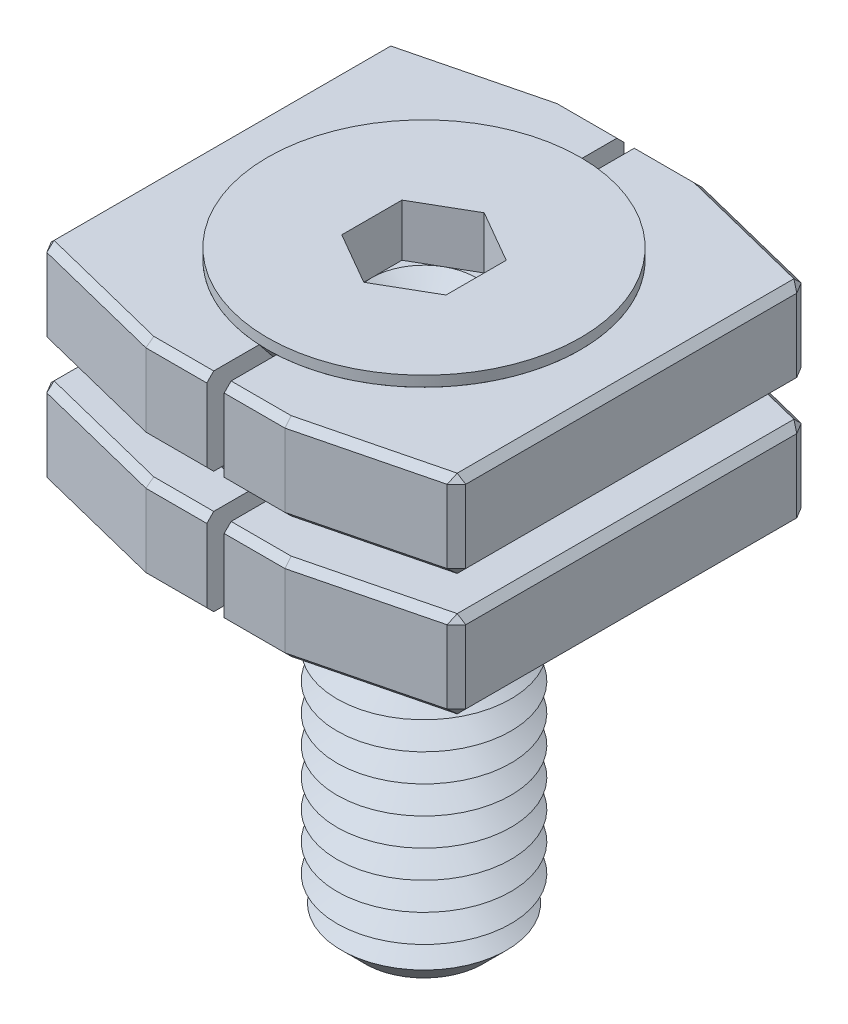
ISO-10303-21;
HEADER;
FILE_DESCRIPTION(('STEP AP214'),'2;1');
FILE_NAME('part.step','',(''),(''),'','','');
FILE_SCHEMA(('AUTOMOTIVE_DESIGN { 1 0 10303 214 1 1 1 1 }'));
ENDSEC;
DATA;
#1=APPLICATION_CONTEXT('core data for automotive mechanical design processes');
#2=APPLICATION_PROTOCOL_DEFINITION('international standard','automotive_design',2000,#1);
#3=PRODUCT_CONTEXT('',#1,'mechanical');
#4=PRODUCT('Part','Part','',(#3));
#5=PRODUCT_RELATED_PRODUCT_CATEGORY('part','',(#4));
#6=PRODUCT_DEFINITION_FORMATION('','',#4);
#7=PRODUCT_DEFINITION_CONTEXT('part definition',#1,'design');
#8=PRODUCT_DEFINITION('design','',#6,#7);
#9=PRODUCT_DEFINITION_SHAPE('','',#8);
#10=(LENGTH_UNIT() NAMED_UNIT(*) SI_UNIT(.MILLI.,.METRE.));
#11=(NAMED_UNIT(*) PLANE_ANGLE_UNIT() SI_UNIT($,.RADIAN.));
#12=(NAMED_UNIT(*) SI_UNIT($,.STERADIAN.) SOLID_ANGLE_UNIT());
#13=UNCERTAINTY_MEASURE_WITH_UNIT(LENGTH_MEASURE(1.E-05),#10,'distance_accuracy_value','');
#14=(GEOMETRIC_REPRESENTATION_CONTEXT(3) GLOBAL_UNCERTAINTY_ASSIGNED_CONTEXT((#13)) GLOBAL_UNIT_ASSIGNED_CONTEXT((#10,
#11,#12)) REPRESENTATION_CONTEXT('',''));
#15=CARTESIAN_POINT('',(0.,0.,0.));
#16=DIRECTION('',(0.,0.,1.));
#17=DIRECTION('',(1.,0.,0.));
#18=AXIS2_PLACEMENT_3D('',#15,#16,#17);
#19=CARTESIAN_POINT('',(0.,-1.2,0.));
#20=DIRECTION('',(0.,1.,0.));
#21=DIRECTION('',(0.,0.,1.));
#22=AXIS2_PLACEMENT_3D('',#19,#20,#21);
#23=PLANE('',#22);
#24=CARTESIAN_POINT('',(0.,-1.2,0.));
#25=DIRECTION('',(0.,1.,0.));
#26=DIRECTION('',(0.,0.,1.));
#27=AXIS2_PLACEMENT_3D('',#24,#25,#26);
#28=CIRCLE('',#27,1.5);
#29=CARTESIAN_POINT('',(0.75,-1.2,1.29903810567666));
#30=VERTEX_POINT('',#29);
#31=CARTESIAN_POINT('',(1.5,-1.2,0.));
#32=VERTEX_POINT('',#31);
#33=EDGE_CURVE('P0_E94',#30,#32,#28,.T.);
#34=ORIENTED_EDGE('',*,*,#33,.F.);
#35=DIRECTION('',(0.866025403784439,0.,-0.5));
#36=VECTOR('',#35,1.);
#37=CARTESIAN_POINT('',(0.,-1.2,1.73205080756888));
#38=LINE('',#37,#36);
#39=CARTESIAN_POINT('',(1.5,-1.2,0.866025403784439));
#40=VERTEX_POINT('',#39);
#41=EDGE_CURVE('P0_E117',#30,#40,#38,.T.);
#42=ORIENTED_EDGE('',*,*,#41,.T.);
#43=DIRECTION('',(0.,0.,-1.));
#44=VECTOR('',#43,1.);
#45=CARTESIAN_POINT('',(1.5,-1.2,0.866025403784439));
#46=LINE('',#45,#44);
#47=EDGE_CURVE('P0_E113',#40,#32,#46,.T.);
#48=ORIENTED_EDGE('',*,*,#47,.T.);
#49=EDGE_LOOP('',(#34,#42,#48));
#50=FACE_BOUND('',#49,.T.);
#51=ADVANCED_FACE('P0_F16',(#50),#23,.T.);
#52=CARTESIAN_POINT('',(0.,-1.2,0.));
#53=DIRECTION('',(0.,1.,0.));
#54=DIRECTION('',(0.,0.,1.));
#55=AXIS2_PLACEMENT_3D('',#52,#53,#54);
#56=CIRCLE('',#55,1.5);
#57=CARTESIAN_POINT('',(0.75,-1.2,-1.29903810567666));
#58=VERTEX_POINT('',#57);
#59=EDGE_CURVE('P0_E11',#32,#58,#56,.T.);
#60=ORIENTED_EDGE('',*,*,#59,.F.);
#61=CARTESIAN_POINT('',(1.5,-1.2,-0.86602540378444));
#62=VERTEX_POINT('',#61);
#63=EDGE_CURVE('P0_E105',#32,#62,#46,.T.);
#64=ORIENTED_EDGE('',*,*,#63,.T.);
#65=DIRECTION('',(-0.866025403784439,0.,-0.5));
#66=VECTOR('',#65,1.);
#67=CARTESIAN_POINT('',(1.5,-1.2,-0.86602540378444));
#68=LINE('',#67,#66);
#69=EDGE_CURVE('P0_E108',#62,#58,#68,.T.);
#70=ORIENTED_EDGE('',*,*,#69,.T.);
#71=EDGE_LOOP('',(#60,#64,#70));
#72=FACE_BOUND('',#71,.T.);
#73=ADVANCED_FACE('P0_F104',(#72),#23,.T.);
#74=CARTESIAN_POINT('',(-0.75,-1.2,-1.29903810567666));
#75=VERTEX_POINT('',#74);
#76=EDGE_CURVE('P0_E25',#58,#75,#56,.T.);
#77=ORIENTED_EDGE('',*,*,#76,.F.);
#78=CARTESIAN_POINT('',(0.,-1.2,-1.73205080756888));
#79=VERTEX_POINT('',#78);
#80=EDGE_CURVE('P0_E140',#58,#79,#68,.T.);
#81=ORIENTED_EDGE('',*,*,#80,.T.);
#82=DIRECTION('',(-0.866025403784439,0.,0.5));
#83=VECTOR('',#82,1.);
#84=CARTESIAN_POINT('',(0.,-1.2,-1.73205080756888));
#85=LINE('',#84,#83);
#86=EDGE_CURVE('P0_E321',#79,#75,#85,.T.);
#87=ORIENTED_EDGE('',*,*,#86,.T.);
#88=EDGE_LOOP('',(#77,#81,#87));
#89=FACE_BOUND('',#88,.T.);
#90=ADVANCED_FACE('P0_F287',(#89),#23,.T.);
#91=CARTESIAN_POINT('',(-1.5,-1.2,0.));
#92=VERTEX_POINT('',#91);
#93=EDGE_CURVE('P0_E316',#75,#92,#56,.T.);
#94=ORIENTED_EDGE('',*,*,#93,.F.);
#95=CARTESIAN_POINT('',(-1.5,-1.2,-0.86602540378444));
#96=VERTEX_POINT('',#95);
#97=EDGE_CURVE('P0_E325',#75,#96,#85,.T.);
#98=ORIENTED_EDGE('',*,*,#97,.T.);
#99=DIRECTION('',(0.,0.,1.));
#100=VECTOR('',#99,1.);
#101=CARTESIAN_POINT('',(-1.5,-1.2,-0.86602540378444));
#102=LINE('',#101,#100);
#103=EDGE_CURVE('P0_E320',#96,#92,#102,.T.);
#104=ORIENTED_EDGE('',*,*,#103,.T.);
#105=EDGE_LOOP('',(#94,#98,#104));
#106=FACE_BOUND('',#105,.T.);
#107=ADVANCED_FACE('P0_F301',(#106),#23,.T.);
#108=CARTESIAN_POINT('',(-0.75,-1.2,1.29903810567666));
#109=VERTEX_POINT('',#108);
#110=EDGE_CURVE('P0_E32',#92,#109,#56,.T.);
#111=ORIENTED_EDGE('',*,*,#110,.F.);
#112=CARTESIAN_POINT('',(-1.5,-1.2,0.866025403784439));
#113=VERTEX_POINT('',#112);
#114=EDGE_CURVE('P0_E312',#92,#113,#102,.T.);
#115=ORIENTED_EDGE('',*,*,#114,.T.);
#116=DIRECTION('',(0.866025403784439,0.,0.5));
#117=VECTOR('',#116,1.);
#118=CARTESIAN_POINT('',(-1.5,-1.2,0.866025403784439));
#119=LINE('',#118,#117);
#120=EDGE_CURVE('P0_E315',#113,#109,#119,.T.);
#121=ORIENTED_EDGE('',*,*,#120,.T.);
#122=EDGE_LOOP('',(#111,#115,#121));
#123=FACE_BOUND('',#122,.T.);
#124=ADVANCED_FACE('P0_F292',(#123),#23,.T.);
#125=CARTESIAN_POINT('',(0.,0.300000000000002,0.));
#126=DIRECTION('',(0.,1.,0.));
#127=DIRECTION('',(0.,0.,1.));
#128=AXIS2_PLACEMENT_3D('',#125,#126,#127);
#129=PLANE('',#128);
#130=DIRECTION('',(-0.866025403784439,0.,-0.5));
#131=VECTOR('',#130,1.);
#132=CARTESIAN_POINT('',(1.5,0.300000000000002,-0.86602540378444));
#133=LINE('',#132,#131);
#134=CARTESIAN_POINT('',(1.5,0.300000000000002,-0.86602540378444));
#135=VERTEX_POINT('',#134);
#136=CARTESIAN_POINT('',(0.,0.300000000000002,-1.73205080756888));
#137=VERTEX_POINT('',#136);
#138=EDGE_CURVE('P0_E40',#135,#137,#133,.T.);
#139=ORIENTED_EDGE('',*,*,#138,.F.);
#140=DIRECTION('',(0.,0.,-1.));
#141=VECTOR('',#140,1.);
#142=CARTESIAN_POINT('',(1.5,0.300000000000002,0.866025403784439));
#143=LINE('',#142,#141);
#144=CARTESIAN_POINT('',(1.5,0.300000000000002,0.866025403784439));
#145=VERTEX_POINT('',#144);
#146=EDGE_CURVE('P0_E138',#145,#135,#143,.T.);
#147=ORIENTED_EDGE('',*,*,#146,.F.);
#148=DIRECTION('',(0.866025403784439,0.,-0.5));
#149=VECTOR('',#148,1.);
#150=CARTESIAN_POINT('',(0.,0.300000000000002,1.73205080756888));
#151=LINE('',#150,#149);
#152=CARTESIAN_POINT('',(0.,0.300000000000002,1.73205080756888));
#153=VERTEX_POINT('',#152);
#154=EDGE_CURVE('P0_E135',#153,#145,#151,.T.);
#155=ORIENTED_EDGE('',*,*,#154,.F.);
#156=DIRECTION('',(0.866025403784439,0.,0.5));
#157=VECTOR('',#156,1.);
#158=CARTESIAN_POINT('',(-1.5,0.300000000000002,0.866025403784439));
#159=LINE('',#158,#157);
#160=CARTESIAN_POINT('',(-1.5,0.300000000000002,0.866025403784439));
#161=VERTEX_POINT('',#160);
#162=EDGE_CURVE('P0_E132',#161,#153,#159,.T.);
#163=ORIENTED_EDGE('',*,*,#162,.F.);
#164=DIRECTION('',(0.,0.,1.));
#165=VECTOR('',#164,1.);
#166=CARTESIAN_POINT('',(-1.5,0.300000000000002,-0.86602540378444));
#167=LINE('',#166,#165);
#168=CARTESIAN_POINT('',(-1.5,0.300000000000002,-0.86602540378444));
#169=VERTEX_POINT('',#168);
#170=EDGE_CURVE('P0_E129',#169,#161,#167,.T.);
#171=ORIENTED_EDGE('',*,*,#170,.F.);
#172=DIRECTION('',(-0.866025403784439,0.,0.5));
#173=VECTOR('',#172,1.);
#174=CARTESIAN_POINT('',(0.,0.300000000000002,-1.73205080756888));
#175=LINE('',#174,#173);
#176=EDGE_CURVE('P0_E126',#137,#169,#175,.T.);
#177=ORIENTED_EDGE('',*,*,#176,.F.);
#178=EDGE_LOOP('',(#139,#147,#155,#163,#171,#177));
#179=FACE_BOUND('',#178,.T.);
#180=CARTESIAN_POINT('',(0.,0.300000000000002,0.));
#181=DIRECTION('',(0.,1.,0.));
#182=DIRECTION('',(0.,0.,1.));
#183=AXIS2_PLACEMENT_3D('',#180,#181,#182);
#184=CIRCLE('',#183,4.5);
#185=CARTESIAN_POINT('',(0.,0.300000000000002,4.5));
#186=VERTEX_POINT('',#185);
#187=EDGE_CURVE('P0_E255',#186,#186,#184,.T.);
#188=ORIENTED_EDGE('',*,*,#187,.T.);
#189=EDGE_LOOP('',(#188));
#190=FACE_BOUND('',#189,.T.);
#191=ADVANCED_FACE('P0_F300',(#179,#190),#129,.T.);
#192=CARTESIAN_POINT('',(0.,63.3354418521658,0.));
#193=DIRECTION('',(0.,1.,0.));
#194=DIRECTION('',(0.,0.,1.));
#195=AXIS2_PLACEMENT_3D('',#192,#193,#194);
#196=CYLINDRICAL_SURFACE('',#195,4.5);
#197=CARTESIAN_POINT('',(0.,0.,0.));
#198=DIRECTION('',(0.,1.,0.));
#199=DIRECTION('',(0.,0.,1.));
#200=AXIS2_PLACEMENT_3D('',#197,#198,#199);
#201=CIRCLE('',#200,4.5);
#202=CARTESIAN_POINT('',(0.,0.,4.5));
#203=VERTEX_POINT('',#202);
#204=EDGE_CURVE('P0_E252',#203,#203,#201,.T.);
#205=ORIENTED_EDGE('',*,*,#204,.T.);
#206=EDGE_LOOP('',(#205));
#207=FACE_BOUND('',#206,.T.);
#208=ORIENTED_EDGE('',*,*,#187,.F.);
#209=EDGE_LOOP('',(#208));
#210=FACE_BOUND('',#209,.T.);
#211=ADVANCED_FACE('P0_F307',(#207,#210),#196,.T.);
#212=CARTESIAN_POINT('',(0.,0.,0.));
#213=DIRECTION('',(0.,1.,0.));
#214=DIRECTION('',(0.,0.,1.));
#215=AXIS2_PLACEMENT_3D('',#212,#213,#214);
#216=CONICAL_SURFACE('',#215,4.5,0.674744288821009);
#217=CARTESIAN_POINT('',(0.,-2.49998284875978,0.));
#218=DIRECTION('',(0.,1.,0.));
#219=DIRECTION('',(0.,0.,1.));
#220=AXIS2_PLACEMENT_3D('',#217,#218,#219);
#221=CIRCLE('',#220,2.5);
#222=CARTESIAN_POINT('',(0.,-2.49998284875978,2.5));
#223=VERTEX_POINT('',#222);
#224=EDGE_CURVE('P0_E249',#223,#223,#221,.T.);
#225=ORIENTED_EDGE('',*,*,#224,.T.);
#226=EDGE_LOOP('',(#225));
#227=FACE_BOUND('',#226,.T.);
#228=ORIENTED_EDGE('',*,*,#204,.F.);
#229=EDGE_LOOP('',(#228));
#230=FACE_BOUND('',#229,.T.);
#231=ADVANCED_FACE('P0_F379',(#227,#230),#216,.T.);
#232=CARTESIAN_POINT('',(0.,-2.89998284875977,0.));
#233=DIRECTION('',(0.,1.,0.));
#234=DIRECTION('',(0.,0.,1.));
#235=AXIS2_PLACEMENT_3D('',#232,#233,#234);
#236=CONICAL_SURFACE('',#235,1.80717967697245,1.0471975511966);
#237=ORIENTED_EDGE('',*,*,#224,.F.);
#238=EDGE_LOOP('',(#237));
#239=FACE_BOUND('',#238,.T.);
#240=CARTESIAN_POINT('',(0.,-2.89998284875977,0.));
#241=DIRECTION('',(0.,1.,0.));
#242=DIRECTION('',(0.,0.,1.));
#243=AXIS2_PLACEMENT_3D('',#240,#241,#242);
#244=CIRCLE('',#243,1.80717967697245);
#245=CARTESIAN_POINT('',(0.,-2.89998284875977,1.80717967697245));
#246=VERTEX_POINT('',#245);
#247=EDGE_CURVE('P0_E246',#246,#246,#244,.T.);
#248=ORIENTED_EDGE('',*,*,#247,.T.);
#249=EDGE_LOOP('',(#248));
#250=FACE_BOUND('',#249,.T.);
#251=ADVANCED_FACE('P0_F389',(#239,#250),#236,.T.);
#252=CARTESIAN_POINT('',(0.,-3.29998284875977,0.));
#253=DIRECTION('',(0.,-1.,0.));
#254=DIRECTION('',(0.,0.,-1.));
#255=AXIS2_PLACEMENT_3D('',#252,#253,#254);
#256=CONICAL_SURFACE('',#255,2.5,1.0471975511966);
#257=ORIENTED_EDGE('',*,*,#247,.F.);
#258=EDGE_LOOP('',(#257));
#259=FACE_BOUND('',#258,.T.);
#260=CARTESIAN_POINT('',(0.,-3.29998284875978,0.));
#261=DIRECTION('',(0.,1.,0.));
#262=DIRECTION('',(0.,0.,1.));
#263=AXIS2_PLACEMENT_3D('',#260,#261,#262);
#264=CIRCLE('',#263,2.5);
#265=CARTESIAN_POINT('',(0.,-3.29998284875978,2.5));
#266=VERTEX_POINT('',#265);
#267=EDGE_CURVE('P0_E243',#266,#266,#264,.T.);
#268=ORIENTED_EDGE('',*,*,#267,.T.);
#269=EDGE_LOOP('',(#268));
#270=FACE_BOUND('',#269,.T.);
#271=ADVANCED_FACE('P0_F398',(#259,#270),#256,.T.);
#272=CARTESIAN_POINT('',(0.,-3.69998284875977,0.));
#273=DIRECTION('',(0.,1.,0.));
#274=DIRECTION('',(0.,0.,1.));
#275=AXIS2_PLACEMENT_3D('',#272,#273,#274);
#276=CONICAL_SURFACE('',#275,1.80717967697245,1.0471975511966);
#277=ORIENTED_EDGE('',*,*,#267,.F.);
#278=EDGE_LOOP('',(#277));
#279=FACE_BOUND('',#278,.T.);
#280=CARTESIAN_POINT('',(0.,-3.69998284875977,0.));
#281=DIRECTION('',(0.,1.,0.));
#282=DIRECTION('',(0.,0.,1.));
#283=AXIS2_PLACEMENT_3D('',#280,#281,#282);
#284=CIRCLE('',#283,1.80717967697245);
#285=CARTESIAN_POINT('',(0.,-3.69998284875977,1.80717967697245));
#286=VERTEX_POINT('',#285);
#287=EDGE_CURVE('P0_E240',#286,#286,#284,.T.);
#288=ORIENTED_EDGE('',*,*,#287,.T.);
#289=EDGE_LOOP('',(#288));
#290=FACE_BOUND('',#289,.T.);
#291=ADVANCED_FACE('P0_F407',(#279,#290),#276,.T.);
#292=CARTESIAN_POINT('',(0.,-4.09998284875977,0.));
#293=DIRECTION('',(0.,-1.,0.));
#294=DIRECTION('',(0.,0.,-1.));
#295=AXIS2_PLACEMENT_3D('',#292,#293,#294);
#296=CONICAL_SURFACE('',#295,2.5,1.0471975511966);
#297=ORIENTED_EDGE('',*,*,#287,.F.);
#298=EDGE_LOOP('',(#297));
#299=FACE_BOUND('',#298,.T.);
#300=CARTESIAN_POINT('',(0.,-4.09998284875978,0.));
#301=DIRECTION('',(0.,1.,0.));
#302=DIRECTION('',(0.,0.,1.));
#303=AXIS2_PLACEMENT_3D('',#300,#301,#302);
#304=CIRCLE('',#303,2.5);
#305=CARTESIAN_POINT('',(0.,-4.09998284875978,2.5));
#306=VERTEX_POINT('',#305);
#307=EDGE_CURVE('P0_E237',#306,#306,#304,.T.);
#308=ORIENTED_EDGE('',*,*,#307,.T.);
#309=EDGE_LOOP('',(#308));
#310=FACE_BOUND('',#309,.T.);
#311=ADVANCED_FACE('P0_F417',(#299,#310),#296,.T.);
#312=CARTESIAN_POINT('',(0.,-4.49998284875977,0.));
#313=DIRECTION('',(0.,1.,0.));
#314=DIRECTION('',(0.,0.,1.));
#315=AXIS2_PLACEMENT_3D('',#312,#313,#314);
#316=CONICAL_SURFACE('',#315,1.80717967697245,1.0471975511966);
#317=ORIENTED_EDGE('',*,*,#307,.F.);
#318=EDGE_LOOP('',(#317));
#319=FACE_BOUND('',#318,.T.);
#320=CARTESIAN_POINT('',(0.,-4.49998284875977,0.));
#321=DIRECTION('',(0.,1.,0.));
#322=DIRECTION('',(0.,0.,1.));
#323=AXIS2_PLACEMENT_3D('',#320,#321,#322);
#324=CIRCLE('',#323,1.80717967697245);
#325=CARTESIAN_POINT('',(0.,-4.49998284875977,1.80717967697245));
#326=VERTEX_POINT('',#325);
#327=EDGE_CURVE('P0_E234',#326,#326,#324,.T.);
#328=ORIENTED_EDGE('',*,*,#327,.T.);
#329=EDGE_LOOP('',(#328));
#330=FACE_BOUND('',#329,.T.);
#331=ADVANCED_FACE('P0_F427',(#319,#330),#316,.T.);
#332=CARTESIAN_POINT('',(0.,-4.89998284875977,0.));
#333=DIRECTION('',(0.,-1.,0.));
#334=DIRECTION('',(0.,0.,-1.));
#335=AXIS2_PLACEMENT_3D('',#332,#333,#334);
#336=CONICAL_SURFACE('',#335,2.5,1.0471975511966);
#337=ORIENTED_EDGE('',*,*,#327,.F.);
#338=EDGE_LOOP('',(#337));
#339=FACE_BOUND('',#338,.T.);
#340=CARTESIAN_POINT('',(0.,-4.89998284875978,0.));
#341=DIRECTION('',(0.,1.,0.));
#342=DIRECTION('',(0.,0.,1.));
#343=AXIS2_PLACEMENT_3D('',#340,#341,#342);
#344=CIRCLE('',#343,2.5);
#345=CARTESIAN_POINT('',(0.,-4.89998284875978,2.5));
#346=VERTEX_POINT('',#345);
#347=EDGE_CURVE('P0_E231',#346,#346,#344,.T.);
#348=ORIENTED_EDGE('',*,*,#347,.T.);
#349=EDGE_LOOP('',(#348));
#350=FACE_BOUND('',#349,.T.);
#351=ADVANCED_FACE('P0_F437',(#339,#350),#336,.T.);
#352=CARTESIAN_POINT('',(0.,-5.29998284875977,0.));
#353=DIRECTION('',(0.,1.,0.));
#354=DIRECTION('',(0.,0.,1.));
#355=AXIS2_PLACEMENT_3D('',#352,#353,#354);
#356=CONICAL_SURFACE('',#355,1.80717967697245,1.0471975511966);
#357=ORIENTED_EDGE('',*,*,#347,.F.);
#358=EDGE_LOOP('',(#357));
#359=FACE_BOUND('',#358,.T.);
#360=CARTESIAN_POINT('',(0.,-5.29998284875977,0.));
#361=DIRECTION('',(0.,1.,0.));
#362=DIRECTION('',(0.,0.,1.));
#363=AXIS2_PLACEMENT_3D('',#360,#361,#362);
#364=CIRCLE('',#363,1.80717967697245);
#365=CARTESIAN_POINT('',(0.,-5.29998284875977,1.80717967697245));
#366=VERTEX_POINT('',#365);
#367=EDGE_CURVE('P0_E228',#366,#366,#364,.T.);
#368=ORIENTED_EDGE('',*,*,#367,.T.);
#369=EDGE_LOOP('',(#368));
#370=FACE_BOUND('',#369,.T.);
#371=ADVANCED_FACE('P0_F447',(#359,#370),#356,.T.);
#372=CARTESIAN_POINT('',(0.,-5.69998284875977,0.));
#373=DIRECTION('',(0.,-1.,0.));
#374=DIRECTION('',(0.,0.,-1.));
#375=AXIS2_PLACEMENT_3D('',#372,#373,#374);
#376=CONICAL_SURFACE('',#375,2.5,1.0471975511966);
#377=ORIENTED_EDGE('',*,*,#367,.F.);
#378=EDGE_LOOP('',(#377));
#379=FACE_BOUND('',#378,.T.);
#380=CARTESIAN_POINT('',(0.,-5.69998284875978,0.));
#381=DIRECTION('',(0.,1.,0.));
#382=DIRECTION('',(0.,0.,1.));
#383=AXIS2_PLACEMENT_3D('',#380,#381,#382);
#384=CIRCLE('',#383,2.5);
#385=CARTESIAN_POINT('',(0.,-5.69998284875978,2.5));
#386=VERTEX_POINT('',#385);
#387=EDGE_CURVE('P0_E225',#386,#386,#384,.T.);
#388=ORIENTED_EDGE('',*,*,#387,.T.);
#389=EDGE_LOOP('',(#388));
#390=FACE_BOUND('',#389,.T.);
#391=ADVANCED_FACE('P0_F457',(#379,#390),#376,.T.);
#392=CARTESIAN_POINT('',(0.,-6.09998284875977,0.));
#393=DIRECTION('',(0.,1.,0.));
#394=DIRECTION('',(0.,0.,1.));
#395=AXIS2_PLACEMENT_3D('',#392,#393,#394);
#396=CONICAL_SURFACE('',#395,1.80717967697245,1.0471975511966);
#397=ORIENTED_EDGE('',*,*,#387,.F.);
#398=EDGE_LOOP('',(#397));
#399=FACE_BOUND('',#398,.T.);
#400=CARTESIAN_POINT('',(0.,-6.09998284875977,0.));
#401=DIRECTION('',(0.,1.,0.));
#402=DIRECTION('',(0.,0.,1.));
#403=AXIS2_PLACEMENT_3D('',#400,#401,#402);
#404=CIRCLE('',#403,1.80717967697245);
#405=CARTESIAN_POINT('',(0.,-6.09998284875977,1.80717967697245));
#406=VERTEX_POINT('',#405);
#407=EDGE_CURVE('P0_E222',#406,#406,#404,.T.);
#408=ORIENTED_EDGE('',*,*,#407,.T.);
#409=EDGE_LOOP('',(#408));
#410=FACE_BOUND('',#409,.T.);
#411=ADVANCED_FACE('P0_F467',(#399,#410),#396,.T.);
#412=CARTESIAN_POINT('',(0.,-6.49998284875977,0.));
#413=DIRECTION('',(0.,-1.,0.));
#414=DIRECTION('',(0.,0.,-1.));
#415=AXIS2_PLACEMENT_3D('',#412,#413,#414);
#416=CONICAL_SURFACE('',#415,2.5,1.0471975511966);
#417=ORIENTED_EDGE('',*,*,#407,.F.);
#418=EDGE_LOOP('',(#417));
#419=FACE_BOUND('',#418,.T.);
#420=CARTESIAN_POINT('',(0.,-6.49998284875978,0.));
#421=DIRECTION('',(0.,1.,0.));
#422=DIRECTION('',(0.,0.,1.));
#423=AXIS2_PLACEMENT_3D('',#420,#421,#422);
#424=CIRCLE('',#423,2.5);
#425=CARTESIAN_POINT('',(0.,-6.49998284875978,2.5));
#426=VERTEX_POINT('',#425);
#427=EDGE_CURVE('P0_E219',#426,#426,#424,.T.);
#428=ORIENTED_EDGE('',*,*,#427,.T.);
#429=EDGE_LOOP('',(#428));
#430=FACE_BOUND('',#429,.T.);
#431=ADVANCED_FACE('P0_F477',(#419,#430),#416,.T.);
#432=CARTESIAN_POINT('',(0.,-6.89998284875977,0.));
#433=DIRECTION('',(0.,1.,0.));
#434=DIRECTION('',(0.,0.,1.));
#435=AXIS2_PLACEMENT_3D('',#432,#433,#434);
#436=CONICAL_SURFACE('',#435,1.80717967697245,1.0471975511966);
#437=ORIENTED_EDGE('',*,*,#427,.F.);
#438=EDGE_LOOP('',(#437));
#439=FACE_BOUND('',#438,.T.);
#440=CARTESIAN_POINT('',(0.,-6.89998284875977,0.));
#441=DIRECTION('',(0.,1.,0.));
#442=DIRECTION('',(0.,0.,1.));
#443=AXIS2_PLACEMENT_3D('',#440,#441,#442);
#444=CIRCLE('',#443,1.80717967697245);
#445=CARTESIAN_POINT('',(0.,-6.89998284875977,1.80717967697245));
#446=VERTEX_POINT('',#445);
#447=EDGE_CURVE('P0_E216',#446,#446,#444,.T.);
#448=ORIENTED_EDGE('',*,*,#447,.T.);
#449=EDGE_LOOP('',(#448));
#450=FACE_BOUND('',#449,.T.);
#451=ADVANCED_FACE('P0_F487',(#439,#450),#436,.T.);
#452=CARTESIAN_POINT('',(0.,-7.29998284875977,0.));
#453=DIRECTION('',(0.,-1.,0.));
#454=DIRECTION('',(0.,0.,-1.));
#455=AXIS2_PLACEMENT_3D('',#452,#453,#454);
#456=CONICAL_SURFACE('',#455,2.5,1.0471975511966);
#457=ORIENTED_EDGE('',*,*,#447,.F.);
#458=EDGE_LOOP('',(#457));
#459=FACE_BOUND('',#458,.T.);
#460=CARTESIAN_POINT('',(0.,-7.29998284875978,0.));
#461=DIRECTION('',(0.,1.,0.));
#462=DIRECTION('',(0.,0.,1.));
#463=AXIS2_PLACEMENT_3D('',#460,#461,#462);
#464=CIRCLE('',#463,2.5);
#465=CARTESIAN_POINT('',(0.,-7.29998284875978,2.5));
#466=VERTEX_POINT('',#465);
#467=EDGE_CURVE('P0_E213',#466,#466,#464,.T.);
#468=ORIENTED_EDGE('',*,*,#467,.T.);
#469=EDGE_LOOP('',(#468));
#470=FACE_BOUND('',#469,.T.);
#471=ADVANCED_FACE('P0_F497',(#459,#470),#456,.T.);
#472=CARTESIAN_POINT('',(0.,-7.69998284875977,0.));
#473=DIRECTION('',(0.,1.,0.));
#474=DIRECTION('',(0.,0.,1.));
#475=AXIS2_PLACEMENT_3D('',#472,#473,#474);
#476=CONICAL_SURFACE('',#475,1.80717967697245,1.0471975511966);
#477=ORIENTED_EDGE('',*,*,#467,.F.);
#478=EDGE_LOOP('',(#477));
#479=FACE_BOUND('',#478,.T.);
#480=CARTESIAN_POINT('',(0.,-7.69998284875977,0.));
#481=DIRECTION('',(0.,1.,0.));
#482=DIRECTION('',(0.,0.,1.));
#483=AXIS2_PLACEMENT_3D('',#480,#481,#482);
#484=CIRCLE('',#483,1.80717967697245);
#485=CARTESIAN_POINT('',(0.,-7.69998284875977,1.80717967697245));
#486=VERTEX_POINT('',#485);
#487=EDGE_CURVE('P0_E210',#486,#486,#484,.T.);
#488=ORIENTED_EDGE('',*,*,#487,.T.);
#489=EDGE_LOOP('',(#488));
#490=FACE_BOUND('',#489,.T.);
#491=ADVANCED_FACE('P0_F507',(#479,#490),#476,.T.);
#492=CARTESIAN_POINT('',(0.,-8.09998284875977,0.));
#493=DIRECTION('',(0.,-1.,0.));
#494=DIRECTION('',(0.,0.,-1.));
#495=AXIS2_PLACEMENT_3D('',#492,#493,#494);
#496=CONICAL_SURFACE('',#495,2.5,1.0471975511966);
#497=ORIENTED_EDGE('',*,*,#487,.F.);
#498=EDGE_LOOP('',(#497));
#499=FACE_BOUND('',#498,.T.);
#500=CARTESIAN_POINT('',(0.,-8.09998284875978,0.));
#501=DIRECTION('',(0.,1.,0.));
#502=DIRECTION('',(0.,0.,1.));
#503=AXIS2_PLACEMENT_3D('',#500,#501,#502);
#504=CIRCLE('',#503,2.5);
#505=CARTESIAN_POINT('',(0.,-8.09998284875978,2.5));
#506=VERTEX_POINT('',#505);
#507=EDGE_CURVE('P0_E207',#506,#506,#504,.T.);
#508=ORIENTED_EDGE('',*,*,#507,.T.);
#509=EDGE_LOOP('',(#508));
#510=FACE_BOUND('',#509,.T.);
#511=ADVANCED_FACE('P0_F517',(#499,#510),#496,.T.);
#512=CARTESIAN_POINT('',(0.,-8.49998284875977,0.));
#513=DIRECTION('',(0.,1.,0.));
#514=DIRECTION('',(0.,0.,1.));
#515=AXIS2_PLACEMENT_3D('',#512,#513,#514);
#516=CONICAL_SURFACE('',#515,1.80717967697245,1.0471975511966);
#517=ORIENTED_EDGE('',*,*,#507,.F.);
#518=EDGE_LOOP('',(#517));
#519=FACE_BOUND('',#518,.T.);
#520=CARTESIAN_POINT('',(0.,-8.49998284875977,0.));
#521=DIRECTION('',(0.,1.,0.));
#522=DIRECTION('',(0.,0.,1.));
#523=AXIS2_PLACEMENT_3D('',#520,#521,#522);
#524=CIRCLE('',#523,1.80717967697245);
#525=CARTESIAN_POINT('',(0.,-8.49998284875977,1.80717967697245));
#526=VERTEX_POINT('',#525);
#527=EDGE_CURVE('P0_E204',#526,#526,#524,.T.);
#528=ORIENTED_EDGE('',*,*,#527,.T.);
#529=EDGE_LOOP('',(#528));
#530=FACE_BOUND('',#529,.T.);
#531=ADVANCED_FACE('P0_F527',(#519,#530),#516,.T.);
#532=CARTESIAN_POINT('',(0.,-8.89998284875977,0.));
#533=DIRECTION('',(0.,-1.,0.));
#534=DIRECTION('',(0.,0.,-1.));
#535=AXIS2_PLACEMENT_3D('',#532,#533,#534);
#536=CONICAL_SURFACE('',#535,2.5,1.0471975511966);
#537=ORIENTED_EDGE('',*,*,#527,.F.);
#538=EDGE_LOOP('',(#537));
#539=FACE_BOUND('',#538,.T.);
#540=CARTESIAN_POINT('',(0.,-8.89998284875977,0.));
#541=DIRECTION('',(0.,1.,0.));
#542=DIRECTION('',(0.,0.,1.));
#543=AXIS2_PLACEMENT_3D('',#540,#541,#542);
#544=CIRCLE('',#543,2.5);
#545=CARTESIAN_POINT('',(0.,-8.89998284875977,2.5));
#546=VERTEX_POINT('',#545);
#547=EDGE_CURVE('P0_E201',#546,#546,#544,.T.);
#548=ORIENTED_EDGE('',*,*,#547,.T.);
#549=EDGE_LOOP('',(#548));
#550=FACE_BOUND('',#549,.T.);
#551=ADVANCED_FACE('P0_F537',(#539,#550),#536,.T.);
#552=CARTESIAN_POINT('',(0.,-9.29998284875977,0.));
#553=DIRECTION('',(0.,1.,0.));
#554=DIRECTION('',(0.,0.,1.));
#555=AXIS2_PLACEMENT_3D('',#552,#553,#554);
#556=CONICAL_SURFACE('',#555,1.80717967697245,1.0471975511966);
#557=ORIENTED_EDGE('',*,*,#547,.F.);
#558=EDGE_LOOP('',(#557));
#559=FACE_BOUND('',#558,.T.);
#560=CARTESIAN_POINT('',(0.,-9.29998284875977,0.));
#561=DIRECTION('',(0.,1.,0.));
#562=DIRECTION('',(0.,0.,1.));
#563=AXIS2_PLACEMENT_3D('',#560,#561,#562);
#564=CIRCLE('',#563,1.80717967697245);
#565=CARTESIAN_POINT('',(0.,-9.29998284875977,1.80717967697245));
#566=VERTEX_POINT('',#565);
#567=EDGE_CURVE('P0_E198',#566,#566,#564,.T.);
#568=ORIENTED_EDGE('',*,*,#567,.T.);
#569=EDGE_LOOP('',(#568));
#570=FACE_BOUND('',#569,.T.);
#571=ADVANCED_FACE('P0_F547',(#559,#570),#556,.T.);
#572=CARTESIAN_POINT('',(0.,-9.69998284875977,0.));
#573=DIRECTION('',(0.,-1.,0.));
#574=DIRECTION('',(0.,0.,-1.));
#575=AXIS2_PLACEMENT_3D('',#572,#573,#574);
#576=CONICAL_SURFACE('',#575,2.5,1.0471975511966);
#577=ORIENTED_EDGE('',*,*,#567,.F.);
#578=EDGE_LOOP('',(#577));
#579=FACE_BOUND('',#578,.T.);
#580=CARTESIAN_POINT('',(0.,-9.69998284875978,0.));
#581=DIRECTION('',(0.,1.,0.));
#582=DIRECTION('',(0.,0.,1.));
#583=AXIS2_PLACEMENT_3D('',#580,#581,#582);
#584=CIRCLE('',#583,2.5);
#585=CARTESIAN_POINT('',(0.,-9.69998284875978,2.5));
#586=VERTEX_POINT('',#585);
#587=EDGE_CURVE('P0_E195',#586,#586,#584,.T.);
#588=ORIENTED_EDGE('',*,*,#587,.T.);
#589=EDGE_LOOP('',(#588));
#590=FACE_BOUND('',#589,.T.);
#591=ADVANCED_FACE('P0_F557',(#579,#590),#576,.T.);
#592=CARTESIAN_POINT('',(0.,-10.0999828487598,0.));
#593=DIRECTION('',(0.,1.,0.));
#594=DIRECTION('',(0.,0.,1.));
#595=AXIS2_PLACEMENT_3D('',#592,#593,#594);
#596=CONICAL_SURFACE('',#595,1.80717967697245,1.0471975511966);
#597=ORIENTED_EDGE('',*,*,#587,.F.);
#598=EDGE_LOOP('',(#597));
#599=FACE_BOUND('',#598,.T.);
#600=CARTESIAN_POINT('',(0.,-10.0999828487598,0.));
#601=DIRECTION('',(0.,1.,0.));
#602=DIRECTION('',(0.,0.,1.));
#603=AXIS2_PLACEMENT_3D('',#600,#601,#602);
#604=CIRCLE('',#603,1.80717967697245);
#605=CARTESIAN_POINT('',(0.,-10.0999828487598,1.80717967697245));
#606=VERTEX_POINT('',#605);
#607=EDGE_CURVE('P0_E192',#606,#606,#604,.T.);
#608=ORIENTED_EDGE('',*,*,#607,.T.);
#609=EDGE_LOOP('',(#608));
#610=FACE_BOUND('',#609,.T.);
#611=ADVANCED_FACE('P0_F567',(#599,#610),#596,.T.);
#612=CARTESIAN_POINT('',(0.,-10.4999828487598,0.));
#613=DIRECTION('',(0.,-1.,0.));
#614=DIRECTION('',(0.,0.,-1.));
#615=AXIS2_PLACEMENT_3D('',#612,#613,#614);
#616=CONICAL_SURFACE('',#615,2.5,1.0471975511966);
#617=ORIENTED_EDGE('',*,*,#607,.F.);
#618=EDGE_LOOP('',(#617));
#619=FACE_BOUND('',#618,.T.);
#620=CARTESIAN_POINT('',(0.,-10.4999828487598,0.));
#621=DIRECTION('',(0.,1.,0.));
#622=DIRECTION('',(0.,0.,1.));
#623=AXIS2_PLACEMENT_3D('',#620,#621,#622);
#624=CIRCLE('',#623,2.5);
#625=CARTESIAN_POINT('',(0.,-10.4999828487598,2.5));
#626=VERTEX_POINT('',#625);
#627=EDGE_CURVE('P0_E189',#626,#626,#624,.T.);
#628=ORIENTED_EDGE('',*,*,#627,.T.);
#629=EDGE_LOOP('',(#628));
#630=FACE_BOUND('',#629,.T.);
#631=ADVANCED_FACE('P0_F577',(#619,#630),#616,.T.);
#632=CARTESIAN_POINT('',(0.,-10.8999828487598,0.));
#633=DIRECTION('',(0.,1.,0.));
#634=DIRECTION('',(0.,0.,1.));
#635=AXIS2_PLACEMENT_3D('',#632,#633,#634);
#636=CONICAL_SURFACE('',#635,1.80717967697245,1.0471975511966);
#637=ORIENTED_EDGE('',*,*,#627,.F.);
#638=EDGE_LOOP('',(#637));
#639=FACE_BOUND('',#638,.T.);
#640=CARTESIAN_POINT('',(0.,-10.8999828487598,0.));
#641=DIRECTION('',(0.,1.,0.));
#642=DIRECTION('',(0.,0.,1.));
#643=AXIS2_PLACEMENT_3D('',#640,#641,#642);
#644=CIRCLE('',#643,1.80717967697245);
#645=CARTESIAN_POINT('',(0.,-10.8999828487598,1.80717967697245));
#646=VERTEX_POINT('',#645);
#647=EDGE_CURVE('P0_E186',#646,#646,#644,.T.);
#648=ORIENTED_EDGE('',*,*,#647,.T.);
#649=EDGE_LOOP('',(#648));
#650=FACE_BOUND('',#649,.T.);
#651=ADVANCED_FACE('P0_F587',(#639,#650),#636,.T.);
#652=CARTESIAN_POINT('',(0.,-11.2999828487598,0.));
#653=DIRECTION('',(0.,-1.,0.));
#654=DIRECTION('',(0.,0.,-1.));
#655=AXIS2_PLACEMENT_3D('',#652,#653,#654);
#656=CONICAL_SURFACE('',#655,2.5,1.0471975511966);
#657=ORIENTED_EDGE('',*,*,#647,.F.);
#658=EDGE_LOOP('',(#657));
#659=FACE_BOUND('',#658,.T.);
#660=CARTESIAN_POINT('',(0.,-11.2999828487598,0.));
#661=DIRECTION('',(0.,1.,0.));
#662=DIRECTION('',(0.,0.,1.));
#663=AXIS2_PLACEMENT_3D('',#660,#661,#662);
#664=CIRCLE('',#663,2.5);
#665=CARTESIAN_POINT('',(0.,-11.2999828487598,2.5));
#666=VERTEX_POINT('',#665);
#667=EDGE_CURVE('P0_E183',#666,#666,#664,.T.);
#668=ORIENTED_EDGE('',*,*,#667,.T.);
#669=EDGE_LOOP('',(#668));
#670=FACE_BOUND('',#669,.T.);
#671=ADVANCED_FACE('P0_F597',(#659,#670),#656,.T.);
#672=CARTESIAN_POINT('',(0.,-11.6999828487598,0.));
#673=DIRECTION('',(0.,1.,0.));
#674=DIRECTION('',(0.,0.,1.));
#675=AXIS2_PLACEMENT_3D('',#672,#673,#674);
#676=CONICAL_SURFACE('',#675,1.80717967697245,1.0471975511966);
#677=ORIENTED_EDGE('',*,*,#667,.F.);
#678=EDGE_LOOP('',(#677));
#679=FACE_BOUND('',#678,.T.);
#680=CARTESIAN_POINT('',(0.,-11.6999828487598,0.));
#681=DIRECTION('',(0.,1.,0.));
#682=DIRECTION('',(0.,0.,1.));
#683=AXIS2_PLACEMENT_3D('',#680,#681,#682);
#684=CIRCLE('',#683,1.80717967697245);
#685=CARTESIAN_POINT('',(0.,-11.6999828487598,1.80717967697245));
#686=VERTEX_POINT('',#685);
#687=EDGE_CURVE('P0_E180',#686,#686,#684,.T.);
#688=ORIENTED_EDGE('',*,*,#687,.T.);
#689=EDGE_LOOP('',(#688));
#690=FACE_BOUND('',#689,.T.);
#691=ADVANCED_FACE('P0_F607',(#679,#690),#676,.T.);
#692=CARTESIAN_POINT('',(0.,-12.0999828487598,0.));
#693=DIRECTION('',(0.,-1.,0.));
#694=DIRECTION('',(0.,0.,-1.));
#695=AXIS2_PLACEMENT_3D('',#692,#693,#694);
#696=CONICAL_SURFACE('',#695,2.5,1.0471975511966);
#697=ORIENTED_EDGE('',*,*,#687,.F.);
#698=EDGE_LOOP('',(#697));
#699=FACE_BOUND('',#698,.T.);
#700=CARTESIAN_POINT('',(0.,-12.0999828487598,0.));
#701=DIRECTION('',(0.,1.,0.));
#702=DIRECTION('',(0.,0.,1.));
#703=AXIS2_PLACEMENT_3D('',#700,#701,#702);
#704=CIRCLE('',#703,2.5);
#705=CARTESIAN_POINT('',(0.,-12.0999828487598,2.5));
#706=VERTEX_POINT('',#705);
#707=EDGE_CURVE('P0_E177',#706,#706,#704,.T.);
#708=ORIENTED_EDGE('',*,*,#707,.T.);
#709=EDGE_LOOP('',(#708));
#710=FACE_BOUND('',#709,.T.);
#711=ADVANCED_FACE('P0_F617',(#699,#710),#696,.T.);
#712=CARTESIAN_POINT('',(0.,-12.4999828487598,0.));
#713=DIRECTION('',(0.,1.,0.));
#714=DIRECTION('',(0.,0.,1.));
#715=AXIS2_PLACEMENT_3D('',#712,#713,#714);
#716=CONICAL_SURFACE('',#715,1.80717967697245,1.0471975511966);
#717=ORIENTED_EDGE('',*,*,#707,.F.);
#718=EDGE_LOOP('',(#717));
#719=FACE_BOUND('',#718,.T.);
#720=CARTESIAN_POINT('',(0.,-12.4999828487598,0.));
#721=DIRECTION('',(0.,1.,0.));
#722=DIRECTION('',(0.,0.,1.));
#723=AXIS2_PLACEMENT_3D('',#720,#721,#722);
#724=CIRCLE('',#723,1.80717967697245);
#725=CARTESIAN_POINT('',(0.,-12.4999828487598,1.80717967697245));
#726=VERTEX_POINT('',#725);
#727=EDGE_CURVE('P0_E174',#726,#726,#724,.T.);
#728=ORIENTED_EDGE('',*,*,#727,.T.);
#729=EDGE_LOOP('',(#728));
#730=FACE_BOUND('',#729,.T.);
#731=ADVANCED_FACE('P0_F627',(#719,#730),#716,.T.);
#732=CARTESIAN_POINT('',(0.,-12.8999828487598,0.));
#733=DIRECTION('',(0.,-1.,0.));
#734=DIRECTION('',(0.,0.,-1.));
#735=AXIS2_PLACEMENT_3D('',#732,#733,#734);
#736=CONICAL_SURFACE('',#735,2.5,1.0471975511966);
#737=ORIENTED_EDGE('',*,*,#727,.F.);
#738=EDGE_LOOP('',(#737));
#739=FACE_BOUND('',#738,.T.);
#740=CARTESIAN_POINT('',(0.,-12.8999828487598,0.));
#741=DIRECTION('',(0.,1.,0.));
#742=DIRECTION('',(0.,0.,1.));
#743=AXIS2_PLACEMENT_3D('',#740,#741,#742);
#744=CIRCLE('',#743,2.5);
#745=CARTESIAN_POINT('',(0.,-12.8999828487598,2.5));
#746=VERTEX_POINT('',#745);
#747=EDGE_CURVE('P0_E171',#746,#746,#744,.T.);
#748=ORIENTED_EDGE('',*,*,#747,.T.);
#749=EDGE_LOOP('',(#748));
#750=FACE_BOUND('',#749,.T.);
#751=ADVANCED_FACE('P0_F637',(#739,#750),#736,.T.);
#752=CARTESIAN_POINT('',(0.,-13.2999828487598,0.));
#753=DIRECTION('',(0.,1.,0.));
#754=DIRECTION('',(0.,0.,1.));
#755=AXIS2_PLACEMENT_3D('',#752,#753,#754);
#756=CONICAL_SURFACE('',#755,1.80717967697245,1.0471975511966);
#757=ORIENTED_EDGE('',*,*,#747,.F.);
#758=EDGE_LOOP('',(#757));
#759=FACE_BOUND('',#758,.T.);
#760=CARTESIAN_POINT('',(0.,-13.2999828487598,0.));
#761=DIRECTION('',(0.,1.,0.));
#762=DIRECTION('',(0.,0.,1.));
#763=AXIS2_PLACEMENT_3D('',#760,#761,#762);
#764=CIRCLE('',#763,1.80717967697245);
#765=CARTESIAN_POINT('',(0.,-13.2999828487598,1.80717967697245));
#766=VERTEX_POINT('',#765);
#767=EDGE_CURVE('P0_E168',#766,#766,#764,.T.);
#768=ORIENTED_EDGE('',*,*,#767,.T.);
#769=EDGE_LOOP('',(#768));
#770=FACE_BOUND('',#769,.T.);
#771=ADVANCED_FACE('P0_F647',(#759,#770),#756,.T.);
#772=CARTESIAN_POINT('',(0.,-13.6999828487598,0.));
#773=DIRECTION('',(0.,-1.,0.));
#774=DIRECTION('',(0.,0.,-1.));
#775=AXIS2_PLACEMENT_3D('',#772,#773,#774);
#776=CONICAL_SURFACE('',#775,2.5,1.0471975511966);
#777=ORIENTED_EDGE('',*,*,#767,.F.);
#778=EDGE_LOOP('',(#777));
#779=FACE_BOUND('',#778,.T.);
#780=CARTESIAN_POINT('',(0.,-13.6999828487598,0.));
#781=DIRECTION('',(0.,1.,0.));
#782=DIRECTION('',(0.,0.,1.));
#783=AXIS2_PLACEMENT_3D('',#780,#781,#782);
#784=CIRCLE('',#783,2.5);
#785=CARTESIAN_POINT('',(0.,-13.6999828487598,2.5));
#786=VERTEX_POINT('',#785);
#787=EDGE_CURVE('P0_E165',#786,#786,#784,.T.);
#788=ORIENTED_EDGE('',*,*,#787,.T.);
#789=EDGE_LOOP('',(#788));
#790=FACE_BOUND('',#789,.T.);
#791=ADVANCED_FACE('P0_F657',(#779,#790),#776,.T.);
#792=CARTESIAN_POINT('',(0.,-14.0999828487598,0.));
#793=DIRECTION('',(0.,1.,0.));
#794=DIRECTION('',(0.,0.,1.));
#795=AXIS2_PLACEMENT_3D('',#792,#793,#794);
#796=CONICAL_SURFACE('',#795,1.80717967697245,1.0471975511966);
#797=ORIENTED_EDGE('',*,*,#787,.F.);
#798=EDGE_LOOP('',(#797));
#799=FACE_BOUND('',#798,.T.);
#800=CARTESIAN_POINT('',(0.,-14.0999828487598,0.));
#801=DIRECTION('',(0.,1.,0.));
#802=DIRECTION('',(0.,0.,1.));
#803=AXIS2_PLACEMENT_3D('',#800,#801,#802);
#804=CIRCLE('',#803,1.80717967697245);
#805=CARTESIAN_POINT('',(0.,-14.0999828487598,1.80717967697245));
#806=VERTEX_POINT('',#805);
#807=EDGE_CURVE('P0_E162',#806,#806,#804,.T.);
#808=ORIENTED_EDGE('',*,*,#807,.T.);
#809=EDGE_LOOP('',(#808));
#810=FACE_BOUND('',#809,.T.);
#811=ADVANCED_FACE('P0_F667',(#799,#810),#796,.T.);
#812=CARTESIAN_POINT('',(0.,-14.4999828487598,0.));
#813=DIRECTION('',(0.,-1.,0.));
#814=DIRECTION('',(0.,0.,-1.));
#815=AXIS2_PLACEMENT_3D('',#812,#813,#814);
#816=CONICAL_SURFACE('',#815,2.5,1.0471975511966);
#817=ORIENTED_EDGE('',*,*,#807,.F.);
#818=EDGE_LOOP('',(#817));
#819=FACE_BOUND('',#818,.T.);
#820=CARTESIAN_POINT('',(0.,-14.4999828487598,0.));
#821=DIRECTION('',(0.,1.,0.));
#822=DIRECTION('',(0.,0.,1.));
#823=AXIS2_PLACEMENT_3D('',#820,#821,#822);
#824=CIRCLE('',#823,2.5);
#825=CARTESIAN_POINT('',(0.,-14.4999828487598,2.5));
#826=VERTEX_POINT('',#825);
#827=EDGE_CURVE('P0_E159',#826,#826,#824,.T.);
#828=ORIENTED_EDGE('',*,*,#827,.T.);
#829=EDGE_LOOP('',(#828));
#830=FACE_BOUND('',#829,.T.);
#831=ADVANCED_FACE('P0_F677',(#819,#830),#816,.T.);
#832=CARTESIAN_POINT('',(0.,-14.8999828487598,0.));
#833=DIRECTION('',(0.,1.,0.));
#834=DIRECTION('',(0.,0.,1.));
#835=AXIS2_PLACEMENT_3D('',#832,#833,#834);
#836=CONICAL_SURFACE('',#835,1.80717967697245,1.0471975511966);
#837=ORIENTED_EDGE('',*,*,#827,.F.);
#838=EDGE_LOOP('',(#837));
#839=FACE_BOUND('',#838,.T.);
#840=CARTESIAN_POINT('',(0.,-14.8999828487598,0.));
#841=DIRECTION('',(0.,1.,0.));
#842=DIRECTION('',(0.,0.,1.));
#843=AXIS2_PLACEMENT_3D('',#840,#841,#842);
#844=CIRCLE('',#843,1.80717967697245);
#845=CARTESIAN_POINT('',(0.,-14.8999828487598,1.80717967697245));
#846=VERTEX_POINT('',#845);
#847=EDGE_CURVE('P0_E156',#846,#846,#844,.T.);
#848=ORIENTED_EDGE('',*,*,#847,.T.);
#849=EDGE_LOOP('',(#848));
#850=FACE_BOUND('',#849,.T.);
#851=ADVANCED_FACE('P0_F687',(#839,#850),#836,.T.);
#852=CARTESIAN_POINT('',(0.,-15.2999828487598,0.));
#853=DIRECTION('',(0.,-1.,0.));
#854=DIRECTION('',(0.,0.,-1.));
#855=AXIS2_PLACEMENT_3D('',#852,#853,#854);
#856=CONICAL_SURFACE('',#855,2.5,1.0471975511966);
#857=ORIENTED_EDGE('',*,*,#847,.F.);
#858=EDGE_LOOP('',(#857));
#859=FACE_BOUND('',#858,.T.);
#860=CARTESIAN_POINT('',(0.,-15.2999828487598,0.));
#861=DIRECTION('',(0.,1.,0.));
#862=DIRECTION('',(0.,0.,1.));
#863=AXIS2_PLACEMENT_3D('',#860,#861,#862);
#864=CIRCLE('',#863,2.5);
#865=CARTESIAN_POINT('',(0.,-15.2999828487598,2.5));
#866=VERTEX_POINT('',#865);
#867=EDGE_CURVE('P0_E152',#866,#866,#864,.T.);
#868=ORIENTED_EDGE('',*,*,#867,.T.);
#869=EDGE_LOOP('',(#868));
#870=FACE_BOUND('',#869,.T.);
#871=ADVANCED_FACE('P0_F697',(#859,#870),#856,.T.);
#872=CARTESIAN_POINT('',(0.,-15.6999828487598,0.));
#873=DIRECTION('',(0.,1.,0.));
#874=DIRECTION('',(0.,0.,1.));
#875=AXIS2_PLACEMENT_3D('',#872,#873,#874);
#876=CONICAL_SURFACE('',#875,1.80717967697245,1.0471975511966);
#877=ORIENTED_EDGE('',*,*,#867,.F.);
#878=EDGE_LOOP('',(#877));
#879=FACE_BOUND('',#878,.T.);
#880=CARTESIAN_POINT('',(0.,-15.6999828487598,0.));
#881=DIRECTION('',(0.,1.,0.));
#882=DIRECTION('',(0.,0.,1.));
#883=AXIS2_PLACEMENT_3D('',#880,#881,#882);
#884=CIRCLE('',#883,1.80717967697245);
#885=CARTESIAN_POINT('',(0.,-15.6999828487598,1.80717967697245));
#886=VERTEX_POINT('',#885);
#887=EDGE_CURVE('P0_E142',#886,#886,#884,.T.);
#888=ORIENTED_EDGE('',*,*,#887,.T.);
#889=EDGE_LOOP('',(#888));
#890=FACE_BOUND('',#889,.T.);
#891=ADVANCED_FACE('P0_F278',(#879,#890),#876,.T.);
#892=CARTESIAN_POINT('',(0.,-16.0999828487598,0.));
#893=DIRECTION('',(0.,-1.,0.));
#894=DIRECTION('',(0.,0.,-1.));
#895=AXIS2_PLACEMENT_3D('',#892,#893,#894);
#896=CONICAL_SURFACE('',#895,2.5,1.0471975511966);
#897=CARTESIAN_POINT('',(0.,-16.0267840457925,0.));
#898=DIRECTION('',(0.,-1.,0.));
#899=DIRECTION('',(0.,0.,-1.));
#900=AXIS2_PLACEMENT_3D('',#897,#898,#899);
#901=CIRCLE('',#900,2.37321595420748);
#902=CARTESIAN_POINT('',(0.,-16.0267840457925,-2.37321595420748));
#903=VERTEX_POINT('',#902);
#904=EDGE_CURVE('P0_E155',#903,#903,#901,.F.);
#905=ORIENTED_EDGE('',*,*,#904,.T.);
#906=EDGE_LOOP('',(#905));
#907=FACE_BOUND('',#906,.T.);
#908=ORIENTED_EDGE('',*,*,#887,.F.);
#909=EDGE_LOOP('',(#908));
#910=FACE_BOUND('',#909,.T.);
#911=ADVANCED_FACE('P0_F263',(#907,#910),#896,.T.);
#912=CARTESIAN_POINT('',(0.,-16.7,2.5));
#913=DIRECTION('',(0.,-1.,0.));
#914=DIRECTION('',(0.,0.,-1.));
#915=AXIS2_PLACEMENT_3D('',#912,#913,#914);
#916=PLANE('',#915);
#917=CARTESIAN_POINT('',(0.,-16.7,0.));
#918=DIRECTION('',(0.,-1.,0.));
#919=DIRECTION('',(0.,0.,-1.));
#920=AXIS2_PLACEMENT_3D('',#917,#918,#919);
#921=CIRCLE('',#920,1.69999999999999);
#922=CARTESIAN_POINT('',(0.,-16.7,-1.69999999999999));
#923=VERTEX_POINT('',#922);
#924=EDGE_CURVE('P0_E258',#923,#923,#921,.T.);
#925=ORIENTED_EDGE('',*,*,#924,.T.);
#926=EDGE_LOOP('',(#925));
#927=FACE_BOUND('',#926,.T.);
#928=ADVANCED_FACE('P0_F269',(#927),#916,.T.);
#929=CARTESIAN_POINT('',(0.,-15.9,0.));
#930=DIRECTION('',(0.,1.,0.));
#931=DIRECTION('',(0.,0.,1.));
#932=AXIS2_PLACEMENT_3D('',#929,#930,#931);
#933=CONICAL_SURFACE('',#932,2.5,0.785398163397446);
#934=ORIENTED_EDGE('',*,*,#904,.F.);
#935=EDGE_LOOP('',(#934));
#936=FACE_BOUND('',#935,.T.);
#937=ORIENTED_EDGE('',*,*,#924,.F.);
#938=EDGE_LOOP('',(#937));
#939=FACE_BOUND('',#938,.T.);
#940=ADVANCED_FACE('P0_F18',(#936,#939),#933,.T.);
#941=CARTESIAN_POINT('',(1.5,-1.2,-0.86602540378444));
#942=DIRECTION('',(0.5,0.,-0.866025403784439));
#943=DIRECTION('',(-0.866025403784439,0.,-0.5));
#944=AXIS2_PLACEMENT_3D('',#941,#942,#943);
#945=PLANE('',#944);
#946=ORIENTED_EDGE('',*,*,#138,.T.);
#947=DIRECTION('',(0.,1.,0.));
#948=VECTOR('',#947,1.);
#949=CARTESIAN_POINT('',(0.,-1.2,-1.73205080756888));
#950=LINE('',#949,#948);
#951=EDGE_CURVE('P0_E119',#79,#137,#950,.T.);
#952=ORIENTED_EDGE('',*,*,#951,.F.);
#953=ORIENTED_EDGE('',*,*,#80,.F.);
#954=ORIENTED_EDGE('',*,*,#69,.F.);
#955=DIRECTION('',(0.,1.,0.));
#956=VECTOR('',#955,1.);
#957=CARTESIAN_POINT('',(1.5,-1.2,-0.86602540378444));
#958=LINE('',#957,#956);
#959=EDGE_CURVE('P0_E114',#62,#135,#958,.T.);
#960=ORIENTED_EDGE('',*,*,#959,.T.);
#961=EDGE_LOOP('',(#946,#952,#953,#954,#960));
#962=FACE_BOUND('',#961,.T.);
#963=ADVANCED_FACE('P0_F268',(#962),#945,.F.);
#964=CARTESIAN_POINT('',(1.5,-1.2,0.866025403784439));
#965=DIRECTION('',(1.,0.,0.));
#966=DIRECTION('',(0.,0.,-1.));
#967=AXIS2_PLACEMENT_3D('',#964,#965,#966);
#968=PLANE('',#967);
#969=ORIENTED_EDGE('',*,*,#146,.T.);
#970=ORIENTED_EDGE('',*,*,#959,.F.);
#971=ORIENTED_EDGE('',*,*,#63,.F.);
#972=ORIENTED_EDGE('',*,*,#47,.F.);
#973=DIRECTION('',(0.,1.,0.));
#974=VECTOR('',#973,1.);
#975=CARTESIAN_POINT('',(1.5,-1.2,0.866025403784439));
#976=LINE('',#975,#974);
#977=EDGE_CURVE('P0_E143',#40,#145,#976,.T.);
#978=ORIENTED_EDGE('',*,*,#977,.T.);
#979=EDGE_LOOP('',(#969,#970,#971,#972,#978));
#980=FACE_BOUND('',#979,.T.);
#981=ADVANCED_FACE('P0_F112',(#980),#968,.F.);
#982=CARTESIAN_POINT('',(0.,-1.2,1.73205080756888));
#983=DIRECTION('',(0.5,0.,0.866025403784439));
#984=DIRECTION('',(0.866025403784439,0.,-0.5));
#985=AXIS2_PLACEMENT_3D('',#982,#983,#984);
#986=PLANE('',#985);
#987=ORIENTED_EDGE('',*,*,#154,.T.);
#988=ORIENTED_EDGE('',*,*,#977,.F.);
#989=ORIENTED_EDGE('',*,*,#41,.F.);
#990=CARTESIAN_POINT('',(0.,-1.2,1.73205080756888));
#991=VERTEX_POINT('',#990);
#992=EDGE_CURVE('P0_E115',#991,#30,#38,.T.);
#993=ORIENTED_EDGE('',*,*,#992,.F.);
#994=DIRECTION('',(0.,1.,0.));
#995=VECTOR('',#994,1.);
#996=CARTESIAN_POINT('',(0.,-1.2,1.73205080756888));
#997=LINE('',#996,#995);
#998=EDGE_CURVE('P0_E145',#991,#153,#997,.T.);
#999=ORIENTED_EDGE('',*,*,#998,.T.);
#1000=EDGE_LOOP('',(#987,#988,#989,#993,#999));
#1001=FACE_BOUND('',#1000,.T.);
#1002=ADVANCED_FACE('P0_F335',(#1001),#986,.F.);
#1003=CARTESIAN_POINT('',(-1.5,-1.2,0.866025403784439));
#1004=DIRECTION('',(-0.5,0.,0.866025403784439));
#1005=DIRECTION('',(0.866025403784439,0.,0.5));
#1006=AXIS2_PLACEMENT_3D('',#1003,#1004,#1005);
#1007=PLANE('',#1006);
#1008=ORIENTED_EDGE('',*,*,#162,.T.);
#1009=ORIENTED_EDGE('',*,*,#998,.F.);
#1010=EDGE_CURVE('P0_E327',#109,#991,#119,.T.);
#1011=ORIENTED_EDGE('',*,*,#1010,.F.);
#1012=ORIENTED_EDGE('',*,*,#120,.F.);
#1013=DIRECTION('',(0.,1.,0.));
#1014=VECTOR('',#1013,1.);
#1015=CARTESIAN_POINT('',(-1.5,-1.2,0.866025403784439));
#1016=LINE('',#1015,#1014);
#1017=EDGE_CURVE('P0_E147',#113,#161,#1016,.T.);
#1018=ORIENTED_EDGE('',*,*,#1017,.T.);
#1019=EDGE_LOOP('',(#1008,#1009,#1011,#1012,#1018));
#1020=FACE_BOUND('',#1019,.T.);
#1021=ADVANCED_FACE('P0_F756',(#1020),#1007,.F.);
#1022=CARTESIAN_POINT('',(-1.5,-1.2,-0.86602540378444));
#1023=DIRECTION('',(-1.,0.,0.));
#1024=DIRECTION('',(0.,0.,1.));
#1025=AXIS2_PLACEMENT_3D('',#1022,#1023,#1024);
#1026=PLANE('',#1025);
#1027=ORIENTED_EDGE('',*,*,#170,.T.);
#1028=ORIENTED_EDGE('',*,*,#1017,.F.);
#1029=ORIENTED_EDGE('',*,*,#114,.F.);
#1030=ORIENTED_EDGE('',*,*,#103,.F.);
#1031=DIRECTION('',(0.,1.,0.));
#1032=VECTOR('',#1031,1.);
#1033=CARTESIAN_POINT('',(-1.5,-1.2,-0.86602540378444));
#1034=LINE('',#1033,#1032);
#1035=EDGE_CURVE('P0_E120',#96,#169,#1034,.T.);
#1036=ORIENTED_EDGE('',*,*,#1035,.T.);
#1037=EDGE_LOOP('',(#1027,#1028,#1029,#1030,#1036));
#1038=FACE_BOUND('',#1037,.T.);
#1039=ADVANCED_FACE('P0_F296',(#1038),#1026,.F.);
#1040=CARTESIAN_POINT('',(0.,-1.2,-1.73205080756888));
#1041=DIRECTION('',(-0.5,0.,-0.866025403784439));
#1042=DIRECTION('',(-0.866025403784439,0.,0.5));
#1043=AXIS2_PLACEMENT_3D('',#1040,#1041,#1042);
#1044=PLANE('',#1043);
#1045=ORIENTED_EDGE('',*,*,#176,.T.);
#1046=ORIENTED_EDGE('',*,*,#1035,.F.);
#1047=ORIENTED_EDGE('',*,*,#97,.F.);
#1048=ORIENTED_EDGE('',*,*,#86,.F.);
#1049=ORIENTED_EDGE('',*,*,#951,.T.);
#1050=EDGE_LOOP('',(#1045,#1046,#1047,#1048,#1049));
#1051=FACE_BOUND('',#1050,.T.);
#1052=ADVANCED_FACE('P0_F290',(#1051),#1044,.F.);
#1053=EDGE_CURVE('P0_E20',#109,#30,#56,.T.);
#1054=ORIENTED_EDGE('',*,*,#1053,.F.);
#1055=ORIENTED_EDGE('',*,*,#1010,.T.);
#1056=ORIENTED_EDGE('',*,*,#992,.T.);
#1057=EDGE_LOOP('',(#1054,#1055,#1056));
#1058=FACE_BOUND('',#1057,.T.);
#1059=ADVANCED_FACE('P0_F91',(#1058),#23,.T.);
#1060=CARTESIAN_POINT('',(0.,-1.2,0.));
#1061=DIRECTION('',(0.,1.,0.));
#1062=DIRECTION('',(0.,0.,1.));
#1063=AXIS2_PLACEMENT_3D('',#1060,#1061,#1062);
#1064=CONICAL_SURFACE('',#1063,1.5,1.0471975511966);
#1065=CARTESIAN_POINT('',(0.,-2.06602540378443,0.));
#1066=VERTEX_POINT('',#1065);
#1067=VERTEX_LOOP('',#1066);
#1068=FACE_BOUND('',#1067,.T.);
#1069=ORIENTED_EDGE('',*,*,#33,.T.);
#1070=ORIENTED_EDGE('',*,*,#59,.T.);
#1071=ORIENTED_EDGE('',*,*,#76,.T.);
#1072=ORIENTED_EDGE('',*,*,#93,.T.);
#1073=ORIENTED_EDGE('',*,*,#110,.T.);
#1074=ORIENTED_EDGE('',*,*,#1053,.T.);
#1075=EDGE_LOOP('',(#1069,#1070,#1071,#1072,#1073,#1074));
#1076=FACE_BOUND('',#1075,.T.);
#1077=ADVANCED_FACE('P0_F89',(#1068,#1076),#1064,.F.);
#1078=CLOSED_SHELL('',(#51,#73,#90,#107,#124,#191,#211,#231,#251,#271,#291,#311,#331,#351,#371,
#391,#411,#431,#451,#471,#491,#511,#531,#551,#571,#591,#611,#631,#651,#671,#691,#711,#731,#751,
#771,#791,#811,#831,#851,#871,#891,#911,#928,#940,#963,#981,#1002,#1021,#1039,#1052,#1059,#1077));
#1079=MANIFOLD_SOLID_BREP('P0_B1',#1078);
#1080=CARTESIAN_POINT('',(0.,-2.5,6.));
#1081=DIRECTION('',(0.,0.,1.));
#1082=DIRECTION('',(1.,0.,0.));
#1083=AXIS2_PLACEMENT_3D('',#1080,#1081,#1082);
#1084=PLANE('',#1083);
#1085=DIRECTION('',(0.,-1.,0.));
#1086=VECTOR('',#1085,1.);
#1087=CARTESIAN_POINT('',(-0.249999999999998,-2.5,6.));
#1088=LINE('',#1087,#1086);
#1089=CARTESIAN_POINT('',(-0.249999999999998,-0.200000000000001,6.));
#1090=VERTEX_POINT('',#1089);
#1091=CARTESIAN_POINT('',(-0.249999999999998,-2.3,6.));
#1092=VERTEX_POINT('',#1091);
#1093=EDGE_CURVE('P1_E899',#1090,#1092,#1088,.T.);
#1094=ORIENTED_EDGE('',*,*,#1093,.F.);
#1095=DIRECTION('',(-1.,0.,0.));
#1096=VECTOR('',#1095,1.);
#1097=CARTESIAN_POINT('',(-2.,-0.200000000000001,6.));
#1098=LINE('',#1097,#1096);
#1099=CARTESIAN_POINT('',(-2.,-0.200000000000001,6.));
#1100=VERTEX_POINT('',#1099);
#1101=EDGE_CURVE('P1_E575',#1090,#1100,#1098,.T.);
#1102=ORIENTED_EDGE('',*,*,#1101,.T.);
#1103=DIRECTION('',(0.,1.,0.));
#1104=VECTOR('',#1103,1.);
#1105=CARTESIAN_POINT('',(-2.,-2.5,6.));
#1106=LINE('',#1105,#1104);
#1107=CARTESIAN_POINT('',(-2.,-2.3,6.));
#1108=VERTEX_POINT('',#1107);
#1109=EDGE_CURVE('P1_E1012',#1108,#1100,#1106,.T.);
#1110=ORIENTED_EDGE('',*,*,#1109,.F.);
#1111=DIRECTION('',(1.,0.,0.));
#1112=VECTOR('',#1111,1.);
#1113=CARTESIAN_POINT('',(0.,-2.3,6.));
#1114=LINE('',#1113,#1112);
#1115=EDGE_CURVE('P1_E580',#1108,#1092,#1114,.T.);
#1116=ORIENTED_EDGE('',*,*,#1115,.T.);
#1117=EDGE_LOOP('',(#1094,#1102,#1110,#1116));
#1118=FACE_BOUND('',#1117,.T.);
#1119=ADVANCED_FACE('P1_F16',(#1118),#1084,.T.);
#1120=CARTESIAN_POINT('',(0.,-2.5,-6.));
#1121=DIRECTION('',(0.,0.,-1.));
#1122=DIRECTION('',(-1.,0.,0.));
#1123=AXIS2_PLACEMENT_3D('',#1120,#1121,#1122);
#1124=PLANE('',#1123);
#1125=DIRECTION('',(0.,-1.,0.));
#1126=VECTOR('',#1125,1.);
#1127=CARTESIAN_POINT('',(-0.249999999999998,-2.5,-6.));
#1128=LINE('',#1127,#1126);
#1129=CARTESIAN_POINT('',(-0.249999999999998,-0.200000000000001,-6.));
#1130=VERTEX_POINT('',#1129);
#1131=CARTESIAN_POINT('',(-0.249999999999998,-2.3,-6.));
#1132=VERTEX_POINT('',#1131);
#1133=EDGE_CURVE('P1_E1117',#1130,#1132,#1128,.T.);
#1134=ORIENTED_EDGE('',*,*,#1133,.T.);
#1135=DIRECTION('',(-1.,0.,0.));
#1136=VECTOR('',#1135,1.);
#1137=CARTESIAN_POINT('',(0.,-2.3,-6.));
#1138=LINE('',#1137,#1136);
#1139=CARTESIAN_POINT('',(-2.,-2.3,-6.));
#1140=VERTEX_POINT('',#1139);
#1141=EDGE_CURVE('P1_E571',#1132,#1140,#1138,.T.);
#1142=ORIENTED_EDGE('',*,*,#1141,.T.);
#1143=DIRECTION('',(0.,1.,0.));
#1144=VECTOR('',#1143,1.);
#1145=CARTESIAN_POINT('',(-2.,-2.5,-6.));
#1146=LINE('',#1145,#1144);
#1147=CARTESIAN_POINT('',(-2.,-0.200000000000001,-6.));
#1148=VERTEX_POINT('',#1147);
#1149=EDGE_CURVE('P1_E1009',#1140,#1148,#1146,.T.);
#1150=ORIENTED_EDGE('',*,*,#1149,.T.);
#1151=DIRECTION('',(1.,0.,0.));
#1152=VECTOR('',#1151,1.);
#1153=CARTESIAN_POINT('',(2.,-0.200000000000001,-6.));
#1154=LINE('',#1153,#1152);
#1155=EDGE_CURVE('P1_E568',#1148,#1130,#1154,.T.);
#1156=ORIENTED_EDGE('',*,*,#1155,.T.);
#1157=EDGE_LOOP('',(#1134,#1142,#1150,#1156));
#1158=FACE_BOUND('',#1157,.T.);
#1159=ADVANCED_FACE('P1_F866',(#1158),#1124,.T.);
#1160=CARTESIAN_POINT('',(0.,-2.5,0.));
#1161=DIRECTION('',(0.,-1.,0.));
#1162=DIRECTION('',(0.,0.,-1.));
#1163=AXIS2_PLACEMENT_3D('',#1160,#1161,#1162);
#1164=PLANE('',#1163);
#1165=DIRECTION('',(0.,0.,1.));
#1166=VECTOR('',#1165,1.);
#1167=CARTESIAN_POINT('',(-0.249999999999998,-2.5,-8.54950975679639));
#1168=LINE('',#1167,#1166);
#1169=CARTESIAN_POINT('',(-0.249999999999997,-2.5,3.99217985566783));
#1170=VERTEX_POINT('',#1169);
#1171=CARTESIAN_POINT('',(-0.249999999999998,-2.5,5.8));
#1172=VERTEX_POINT('',#1171);
#1173=EDGE_CURVE('P1_E1113',#1170,#1172,#1168,.T.);
#1174=ORIENTED_EDGE('',*,*,#1173,.T.);
#1175=DIRECTION('',(-1.,0.,0.));
#1176=VECTOR('',#1175,1.);
#1177=CARTESIAN_POINT('',(0.,-2.5,5.8));
#1178=LINE('',#1177,#1176);
#1179=CARTESIAN_POINT('',(-1.97537887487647,-2.5,5.8));
#1180=VERTEX_POINT('',#1179);
#1181=EDGE_CURVE('P1_E550',#1172,#1180,#1178,.T.);
#1182=ORIENTED_EDGE('',*,*,#1181,.T.);
#1183=DIRECTION('',(-0.970142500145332,0.,-0.242535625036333));
#1184=VECTOR('',#1183,1.);
#1185=CARTESIAN_POINT('',(-1.48090463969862,-2.5,5.92361855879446));
#1186=LINE('',#1185,#1184);
#1187=CARTESIAN_POINT('',(-5.8,-2.5,4.84384471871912));
#1188=VERTEX_POINT('',#1187);
#1189=EDGE_CURVE('P1_E554',#1180,#1188,#1186,.T.);
#1190=ORIENTED_EDGE('',*,*,#1189,.T.);
#1191=DIRECTION('',(0.,0.,-1.));
#1192=VECTOR('',#1191,1.);
#1193=CARTESIAN_POINT('',(-5.8,-2.5,0.));
#1194=LINE('',#1193,#1192);
#1195=CARTESIAN_POINT('',(-5.8,-2.5,-4.84384471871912));
#1196=VERTEX_POINT('',#1195);
#1197=EDGE_CURVE('P1_E556',#1188,#1196,#1194,.T.);
#1198=ORIENTED_EDGE('',*,*,#1197,.T.);
#1199=DIRECTION('',(0.970142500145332,0.,-0.242535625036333));
#1200=VECTOR('',#1199,1.);
#1201=CARTESIAN_POINT('',(-1.48090463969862,-2.5,-5.92361855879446));
#1202=LINE('',#1201,#1200);
#1203=CARTESIAN_POINT('',(-1.97537887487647,-2.5,-5.8));
#1204=VERTEX_POINT('',#1203);
#1205=EDGE_CURVE('P1_E558',#1196,#1204,#1202,.T.);
#1206=ORIENTED_EDGE('',*,*,#1205,.T.);
#1207=DIRECTION('',(1.,0.,0.));
#1208=VECTOR('',#1207,1.);
#1209=CARTESIAN_POINT('',(0.,-2.5,-5.8));
#1210=LINE('',#1209,#1208);
#1211=CARTESIAN_POINT('',(-0.249999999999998,-2.5,-5.8));
#1212=VERTEX_POINT('',#1211);
#1213=EDGE_CURVE('P1_E561',#1204,#1212,#1210,.T.);
#1214=ORIENTED_EDGE('',*,*,#1213,.T.);
#1215=CARTESIAN_POINT('',(-0.249999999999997,-2.5,-3.99217985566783));
#1216=VERTEX_POINT('',#1215);
#1217=EDGE_CURVE('P1_E1118',#1212,#1216,#1168,.T.);
#1218=ORIENTED_EDGE('',*,*,#1217,.T.);
#1219=CARTESIAN_POINT('',(0.,-2.5,0.));
#1220=DIRECTION('',(0.,-1.,0.));
#1221=DIRECTION('',(0.,0.,-1.));
#1222=AXIS2_PLACEMENT_3D('',#1219,#1220,#1221);
#1223=CIRCLE('',#1222,4.);
#1224=EDGE_CURVE('P1_E1016',#1170,#1216,#1223,.T.);
#1225=ORIENTED_EDGE('',*,*,#1224,.F.);
#1226=EDGE_LOOP('',(#1174,#1182,#1190,#1198,#1206,#1214,#1218,#1225));
#1227=FACE_BOUND('',#1226,.T.);
#1228=ADVANCED_FACE('P1_F873',(#1227),#1164,.T.);
#1229=CARTESIAN_POINT('',(0.,0.,0.));
#1230=DIRECTION('',(0.,-1.,0.));
#1231=DIRECTION('',(0.,0.,-1.));
#1232=AXIS2_PLACEMENT_3D('',#1229,#1230,#1231);
#1233=PLANE('',#1232);
#1234=DIRECTION('',(1.,0.,0.));
#1235=VECTOR('',#1234,1.);
#1236=CARTESIAN_POINT('',(2.,0.,5.8));
#1237=LINE('',#1236,#1235);
#1238=CARTESIAN_POINT('',(-1.97537887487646,0.,5.8));
#1239=VERTEX_POINT('',#1238);
#1240=CARTESIAN_POINT('',(-0.249999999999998,0.,5.8));
#1241=VERTEX_POINT('',#1240);
#1242=EDGE_CURVE('P1_E586',#1239,#1241,#1237,.T.);
#1243=ORIENTED_EDGE('',*,*,#1242,.T.);
#1244=DIRECTION('',(0.,0.,1.));
#1245=VECTOR('',#1244,1.);
#1246=CARTESIAN_POINT('',(-0.249999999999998,0.,-8.54950975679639));
#1247=LINE('',#1246,#1245);
#1248=CARTESIAN_POINT('',(-0.249999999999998,0.,4.49305018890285));
#1249=VERTEX_POINT('',#1248);
#1250=EDGE_CURVE('P1_E1110',#1249,#1241,#1247,.T.);
#1251=ORIENTED_EDGE('',*,*,#1250,.F.);
#1252=CARTESIAN_POINT('',(0.,0.,0.));
#1253=DIRECTION('',(0.,1.,0.));
#1254=DIRECTION('',(0.,0.,1.));
#1255=AXIS2_PLACEMENT_3D('',#1252,#1253,#1254);
#1256=CIRCLE('',#1255,4.5);
#1257=CARTESIAN_POINT('',(-0.249999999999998,0.,-4.49305018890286));
#1258=VERTEX_POINT('',#1257);
#1259=EDGE_CURVE('P1_E1039',#1258,#1249,#1256,.T.);
#1260=ORIENTED_EDGE('',*,*,#1259,.F.);
#1261=CARTESIAN_POINT('',(-0.249999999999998,0.,-5.8));
#1262=VERTEX_POINT('',#1261);
#1263=EDGE_CURVE('P1_E1112',#1262,#1258,#1247,.T.);
#1264=ORIENTED_EDGE('',*,*,#1263,.F.);
#1265=DIRECTION('',(-1.,0.,0.));
#1266=VECTOR('',#1265,1.);
#1267=CARTESIAN_POINT('',(-2.,0.,-5.8));
#1268=LINE('',#1267,#1266);
#1269=CARTESIAN_POINT('',(-1.97537887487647,0.,-5.8));
#1270=VERTEX_POINT('',#1269);
#1271=EDGE_CURVE('P1_E595',#1262,#1270,#1268,.T.);
#1272=ORIENTED_EDGE('',*,*,#1271,.T.);
#1273=DIRECTION('',(-0.970142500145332,0.,0.242535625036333));
#1274=VECTOR('',#1273,1.);
#1275=CARTESIAN_POINT('',(-5.95149287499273,0.,-4.80597149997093));
#1276=LINE('',#1275,#1274);
#1277=CARTESIAN_POINT('',(-5.8,0.,-4.84384471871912));
#1278=VERTEX_POINT('',#1277);
#1279=EDGE_CURVE('P1_E593',#1270,#1278,#1276,.T.);
#1280=ORIENTED_EDGE('',*,*,#1279,.T.);
#1281=DIRECTION('',(0.,0.,1.));
#1282=VECTOR('',#1281,1.);
#1283=CARTESIAN_POINT('',(-5.8,0.,5.));
#1284=LINE('',#1283,#1282);
#1285=CARTESIAN_POINT('',(-5.8,0.,4.84384471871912));
#1286=VERTEX_POINT('',#1285);
#1287=EDGE_CURVE('P1_E591',#1278,#1286,#1284,.T.);
#1288=ORIENTED_EDGE('',*,*,#1287,.T.);
#1289=DIRECTION('',(0.970142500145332,0.,0.242535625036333));
#1290=VECTOR('',#1289,1.);
#1291=CARTESIAN_POINT('',(-1.95149287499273,0.,5.80597149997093));
#1292=LINE('',#1291,#1290);
#1293=EDGE_CURVE('P1_E589',#1286,#1239,#1292,.T.);
#1294=ORIENTED_EDGE('',*,*,#1293,.T.);
#1295=EDGE_LOOP('',(#1243,#1251,#1260,#1264,#1272,#1280,#1288,#1294));
#1296=FACE_BOUND('',#1295,.T.);
#1297=ADVANCED_FACE('P1_F1258',(#1296),#1233,.F.);
#1298=CARTESIAN_POINT('',(2.,-6.,-6.));
#1299=DIRECTION('',(0.,0.,1.));
#1300=DIRECTION('',(1.,0.,0.));
#1301=AXIS2_PLACEMENT_3D('',#1298,#1299,#1300);
#1302=PLANE('',#1301);
#1303=DIRECTION('',(1.,0.,0.));
#1304=VECTOR('',#1303,1.);
#1305=CARTESIAN_POINT('',(2.,-3.7,-6.));
#1306=LINE('',#1305,#1304);
#1307=CARTESIAN_POINT('',(-2.,-3.7,-6.));
#1308=VERTEX_POINT('',#1307);
#1309=CARTESIAN_POINT('',(-0.249999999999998,-3.7,-6.));
#1310=VERTEX_POINT('',#1309);
#1311=EDGE_CURVE('P1_E519',#1308,#1310,#1306,.T.);
#1312=ORIENTED_EDGE('',*,*,#1311,.T.);
#1313=DIRECTION('',(0.,-1.,0.));
#1314=VECTOR('',#1313,1.);
#1315=CARTESIAN_POINT('',(-0.249999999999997,-6.,-6.));
#1316=LINE('',#1315,#1314);
#1317=CARTESIAN_POINT('',(-0.249999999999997,-5.8,-6.));
#1318=VERTEX_POINT('',#1317);
#1319=EDGE_CURVE('P1_E1097',#1310,#1318,#1316,.T.);
#1320=ORIENTED_EDGE('',*,*,#1319,.T.);
#1321=DIRECTION('',(-1.,0.,0.));
#1322=VECTOR('',#1321,1.);
#1323=CARTESIAN_POINT('',(2.,-5.8,-6.));
#1324=LINE('',#1323,#1322);
#1325=CARTESIAN_POINT('',(-2.,-5.8,-6.));
#1326=VERTEX_POINT('',#1325);
#1327=EDGE_CURVE('P1_E522',#1318,#1326,#1324,.T.);
#1328=ORIENTED_EDGE('',*,*,#1327,.T.);
#1329=DIRECTION('',(0.,1.,0.));
#1330=VECTOR('',#1329,1.);
#1331=CARTESIAN_POINT('',(-2.,-6.,-6.));
#1332=LINE('',#1331,#1330);
#1333=EDGE_CURVE('P1_E1026',#1326,#1308,#1332,.T.);
#1334=ORIENTED_EDGE('',*,*,#1333,.T.);
#1335=EDGE_LOOP('',(#1312,#1320,#1328,#1334));
#1336=FACE_BOUND('',#1335,.T.);
#1337=ADVANCED_FACE('P1_F1513',(#1336),#1302,.F.);
#1338=CARTESIAN_POINT('',(-2.,-6.,6.));
#1339=DIRECTION('',(0.,0.,-1.));
#1340=DIRECTION('',(-1.,0.,0.));
#1341=AXIS2_PLACEMENT_3D('',#1338,#1339,#1340);
#1342=PLANE('',#1341);
#1343=DIRECTION('',(1.,0.,0.));
#1344=VECTOR('',#1343,1.);
#1345=CARTESIAN_POINT('',(-2.,-5.8,6.));
#1346=LINE('',#1345,#1344);
#1347=CARTESIAN_POINT('',(-2.,-5.8,6.));
#1348=VERTEX_POINT('',#1347);
#1349=CARTESIAN_POINT('',(-0.249999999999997,-5.8,6.));
#1350=VERTEX_POINT('',#1349);
#1351=EDGE_CURVE('P1_E515',#1348,#1350,#1346,.T.);
#1352=ORIENTED_EDGE('',*,*,#1351,.T.);
#1353=DIRECTION('',(0.,-1.,0.));
#1354=VECTOR('',#1353,1.);
#1355=CARTESIAN_POINT('',(-0.249999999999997,-6.,6.));
#1356=LINE('',#1355,#1354);
#1357=CARTESIAN_POINT('',(-0.249999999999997,-3.7,6.));
#1358=VERTEX_POINT('',#1357);
#1359=EDGE_CURVE('P1_E1092',#1358,#1350,#1356,.T.);
#1360=ORIENTED_EDGE('',*,*,#1359,.F.);
#1361=DIRECTION('',(-1.,0.,0.));
#1362=VECTOR('',#1361,1.);
#1363=CARTESIAN_POINT('',(-2.,-3.7,6.));
#1364=LINE('',#1363,#1362);
#1365=CARTESIAN_POINT('',(-2.,-3.7,6.));
#1366=VERTEX_POINT('',#1365);
#1367=EDGE_CURVE('P1_E510',#1358,#1366,#1364,.T.);
#1368=ORIENTED_EDGE('',*,*,#1367,.T.);
#1369=DIRECTION('',(0.,1.,0.));
#1370=VECTOR('',#1369,1.);
#1371=CARTESIAN_POINT('',(-2.,-6.,6.));
#1372=LINE('',#1371,#1370);
#1373=EDGE_CURVE('P1_E699',#1348,#1366,#1372,.T.);
#1374=ORIENTED_EDGE('',*,*,#1373,.F.);
#1375=EDGE_LOOP('',(#1352,#1360,#1368,#1374));
#1376=FACE_BOUND('',#1375,.T.);
#1377=ADVANCED_FACE('P1_F1615',(#1376),#1342,.F.);
#1378=CARTESIAN_POINT('',(0.,-6.,0.));
#1379=DIRECTION('',(0.,1.,0.));
#1380=DIRECTION('',(0.,0.,1.));
#1381=AXIS2_PLACEMENT_3D('',#1378,#1379,#1380);
#1382=PLANE('',#1381);
#1383=DIRECTION('',(1.,0.,0.));
#1384=VECTOR('',#1383,1.);
#1385=CARTESIAN_POINT('',(0.,-6.,-5.8));
#1386=LINE('',#1385,#1384);
#1387=CARTESIAN_POINT('',(-1.97537887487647,-6.,-5.8));
#1388=VERTEX_POINT('',#1387);
#1389=CARTESIAN_POINT('',(-0.249999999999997,-6.,-5.8));
#1390=VERTEX_POINT('',#1389);
#1391=EDGE_CURVE('P1_E488',#1388,#1390,#1386,.T.);
#1392=ORIENTED_EDGE('',*,*,#1391,.T.);
#1393=DIRECTION('',(0.,0.,1.));
#1394=VECTOR('',#1393,1.);
#1395=CARTESIAN_POINT('',(-0.249999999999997,-6.,-8.54950975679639));
#1396=LINE('',#1395,#1394);
#1397=CARTESIAN_POINT('',(-0.249999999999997,-6.,-3.99217985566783));
#1398=VERTEX_POINT('',#1397);
#1399=EDGE_CURVE('P1_E1098',#1390,#1398,#1396,.T.);
#1400=ORIENTED_EDGE('',*,*,#1399,.T.);
#1401=CARTESIAN_POINT('',(0.,-6.,0.));
#1402=DIRECTION('',(0.,1.,0.));
#1403=DIRECTION('',(0.,0.,1.));
#1404=AXIS2_PLACEMENT_3D('',#1401,#1402,#1403);
#1405=CIRCLE('',#1404,4.);
#1406=CARTESIAN_POINT('',(-0.249999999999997,-6.,3.99217985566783));
#1407=VERTEX_POINT('',#1406);
#1408=EDGE_CURVE('P1_E1002',#1407,#1398,#1405,.F.);
#1409=ORIENTED_EDGE('',*,*,#1408,.F.);
#1410=CARTESIAN_POINT('',(-0.249999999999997,-6.,5.8));
#1411=VERTEX_POINT('',#1410);
#1412=EDGE_CURVE('P1_E1094',#1407,#1411,#1396,.T.);
#1413=ORIENTED_EDGE('',*,*,#1412,.T.);
#1414=DIRECTION('',(-1.,0.,0.));
#1415=VECTOR('',#1414,1.);
#1416=CARTESIAN_POINT('',(0.,-6.,5.8));
#1417=LINE('',#1416,#1415);
#1418=CARTESIAN_POINT('',(-1.97537887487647,-6.,5.8));
#1419=VERTEX_POINT('',#1418);
#1420=EDGE_CURVE('P1_E502',#1411,#1419,#1417,.T.);
#1421=ORIENTED_EDGE('',*,*,#1420,.T.);
#1422=DIRECTION('',(-0.970142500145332,0.,-0.242535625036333));
#1423=VECTOR('',#1422,1.);
#1424=CARTESIAN_POINT('',(-1.48090463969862,-6.,5.92361855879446));
#1425=LINE('',#1424,#1423);
#1426=CARTESIAN_POINT('',(-5.8,-6.,4.84384471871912));
#1427=VERTEX_POINT('',#1426);
#1428=EDGE_CURVE('P1_E500',#1419,#1427,#1425,.T.);
#1429=ORIENTED_EDGE('',*,*,#1428,.T.);
#1430=DIRECTION('',(0.,0.,-1.));
#1431=VECTOR('',#1430,1.);
#1432=CARTESIAN_POINT('',(-5.8,-6.,0.));
#1433=LINE('',#1432,#1431);
#1434=CARTESIAN_POINT('',(-5.8,-6.,-4.84384471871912));
#1435=VERTEX_POINT('',#1434);
#1436=EDGE_CURVE('P1_E498',#1427,#1435,#1433,.T.);
#1437=ORIENTED_EDGE('',*,*,#1436,.T.);
#1438=DIRECTION('',(0.970142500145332,0.,-0.242535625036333));
#1439=VECTOR('',#1438,1.);
#1440=CARTESIAN_POINT('',(-1.48090463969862,-6.,-5.92361855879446));
#1441=LINE('',#1440,#1439);
#1442=EDGE_CURVE('P1_E492',#1435,#1388,#1441,.T.);
#1443=ORIENTED_EDGE('',*,*,#1442,.T.);
#1444=EDGE_LOOP('',(#1392,#1400,#1409,#1413,#1421,#1429,#1437,#1443));
#1445=FACE_BOUND('',#1444,.T.);
#1446=ADVANCED_FACE('P1_F1642',(#1445),#1382,.F.);
#1447=CARTESIAN_POINT('',(0.,-3.5,0.));
#1448=DIRECTION('',(0.,1.,0.));
#1449=DIRECTION('',(0.,0.,1.));
#1450=AXIS2_PLACEMENT_3D('',#1447,#1448,#1449);
#1451=PLANE('',#1450);
#1452=DIRECTION('',(0.,0.,1.));
#1453=VECTOR('',#1452,1.);
#1454=CARTESIAN_POINT('',(-0.249999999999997,-3.5,-8.54950975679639));
#1455=LINE('',#1454,#1453);
#1456=CARTESIAN_POINT('',(-0.249999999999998,-3.5,-5.8));
#1457=VERTEX_POINT('',#1456);
#1458=CARTESIAN_POINT('',(-0.249999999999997,-3.5,-3.99217985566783));
#1459=VERTEX_POINT('',#1458);
#1460=EDGE_CURVE('P1_E1093',#1457,#1459,#1455,.T.);
#1461=ORIENTED_EDGE('',*,*,#1460,.F.);
#1462=DIRECTION('',(-1.,0.,0.));
#1463=VECTOR('',#1462,1.);
#1464=CARTESIAN_POINT('',(-2.,-3.5,-5.8));
#1465=LINE('',#1464,#1463);
#1466=CARTESIAN_POINT('',(-1.97537887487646,-3.5,-5.8));
#1467=VERTEX_POINT('',#1466);
#1468=EDGE_CURVE('P1_E527',#1457,#1467,#1465,.T.);
#1469=ORIENTED_EDGE('',*,*,#1468,.T.);
#1470=DIRECTION('',(-0.970142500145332,0.,0.242535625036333));
#1471=VECTOR('',#1470,1.);
#1472=CARTESIAN_POINT('',(-5.95149287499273,-3.5,-4.80597149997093));
#1473=LINE('',#1472,#1471);
#1474=CARTESIAN_POINT('',(-5.8,-3.5,-4.84384471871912));
#1475=VERTEX_POINT('',#1474);
#1476=EDGE_CURVE('P1_E531',#1467,#1475,#1473,.T.);
#1477=ORIENTED_EDGE('',*,*,#1476,.T.);
#1478=DIRECTION('',(0.,0.,1.));
#1479=VECTOR('',#1478,1.);
#1480=CARTESIAN_POINT('',(-5.8,-3.5,5.));
#1481=LINE('',#1480,#1479);
#1482=CARTESIAN_POINT('',(-5.8,-3.5,4.84384471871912));
#1483=VERTEX_POINT('',#1482);
#1484=EDGE_CURVE('P1_E533',#1475,#1483,#1481,.T.);
#1485=ORIENTED_EDGE('',*,*,#1484,.T.);
#1486=DIRECTION('',(0.970142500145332,0.,0.242535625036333));
#1487=VECTOR('',#1486,1.);
#1488=CARTESIAN_POINT('',(-1.95149287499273,-3.5,5.80597149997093));
#1489=LINE('',#1488,#1487);
#1490=CARTESIAN_POINT('',(-1.97537887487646,-3.5,5.8));
#1491=VERTEX_POINT('',#1490);
#1492=EDGE_CURVE('P1_E535',#1483,#1491,#1489,.T.);
#1493=ORIENTED_EDGE('',*,*,#1492,.T.);
#1494=DIRECTION('',(1.,0.,0.));
#1495=VECTOR('',#1494,1.);
#1496=CARTESIAN_POINT('',(2.,-3.5,5.8));
#1497=LINE('',#1496,#1495);
#1498=CARTESIAN_POINT('',(-0.249999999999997,-3.5,5.8));
#1499=VERTEX_POINT('',#1498);
#1500=EDGE_CURVE('P1_E538',#1491,#1499,#1497,.T.);
#1501=ORIENTED_EDGE('',*,*,#1500,.T.);
#1502=CARTESIAN_POINT('',(-0.249999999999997,-3.5,3.99217985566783));
#1503=VERTEX_POINT('',#1502);
#1504=EDGE_CURVE('P1_E1089',#1503,#1499,#1455,.T.);
#1505=ORIENTED_EDGE('',*,*,#1504,.F.);
#1506=CARTESIAN_POINT('',(0.,-3.5,0.));
#1507=DIRECTION('',(0.,1.,0.));
#1508=DIRECTION('',(0.,0.,1.));
#1509=AXIS2_PLACEMENT_3D('',#1506,#1507,#1508);
#1510=CIRCLE('',#1509,4.);
#1511=EDGE_CURVE('P1_E1001',#1503,#1459,#1510,.F.);
#1512=ORIENTED_EDGE('',*,*,#1511,.T.);
#1513=EDGE_LOOP('',(#1461,#1469,#1477,#1485,#1493,#1501,#1505,#1512));
#1514=FACE_BOUND('',#1513,.T.);
#1515=ADVANCED_FACE('P1_F1297',(#1514),#1451,.T.);
#1516=CARTESIAN_POINT('',(0.,-2.3,-6.));
#1517=DIRECTION('',(0.,0.707106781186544,0.707106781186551));
#1518=DIRECTION('',(-1.,0.,0.));
#1519=AXIS2_PLACEMENT_3D('',#1516,#1517,#1518);
#1520=PLANE('',#1519);
#1521=DIRECTION('',(0.,-0.707106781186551,0.707106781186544));
#1522=VECTOR('',#1521,1.);
#1523=CARTESIAN_POINT('',(-0.249999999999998,-2.3,-6.));
#1524=LINE('',#1523,#1522);
#1525=EDGE_CURVE('P1_E1048',#1212,#1132,#1524,.F.);
#1526=ORIENTED_EDGE('',*,*,#1525,.F.);
#1527=ORIENTED_EDGE('',*,*,#1213,.F.);
#1528=DIRECTION('',(0.0867208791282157,-0.704442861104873,0.704442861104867));
#1529=VECTOR('',#1528,1.);
#1530=CARTESIAN_POINT('',(-2.,-2.3,-6.));
#1531=LINE('',#1530,#1529);
#1532=EDGE_CURVE('P1_E657',#1140,#1204,#1531,.T.);
#1533=ORIENTED_EDGE('',*,*,#1532,.F.);
#1534=ORIENTED_EDGE('',*,*,#1141,.F.);
#1535=EDGE_LOOP('',(#1526,#1527,#1533,#1534));
#1536=FACE_BOUND('',#1535,.T.);
#1537=ADVANCED_FACE('P1_F1282',(#1536),#1520,.F.);
#1538=CARTESIAN_POINT('',(0.,0.,-5.8));
#1539=DIRECTION('',(0.,0.707106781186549,-0.707106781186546));
#1540=DIRECTION('',(1.,0.,0.));
#1541=AXIS2_PLACEMENT_3D('',#1538,#1539,#1540);
#1542=PLANE('',#1541);
#1543=DIRECTION('',(0.,0.707106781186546,0.707106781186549));
#1544=VECTOR('',#1543,1.);
#1545=CARTESIAN_POINT('',(-0.249999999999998,0.,-5.8));
#1546=LINE('',#1545,#1544);
#1547=EDGE_CURVE('P1_E1050',#1130,#1262,#1546,.T.);
#1548=ORIENTED_EDGE('',*,*,#1547,.F.);
#1549=ORIENTED_EDGE('',*,*,#1155,.F.);
#1550=DIRECTION('',(-0.0867208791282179,-0.704442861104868,-0.704442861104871));
#1551=VECTOR('',#1550,1.);
#1552=CARTESIAN_POINT('',(-1.97921202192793,-0.0311370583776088,-5.83113705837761));
#1553=LINE('',#1552,#1551);
#1554=EDGE_CURVE('P1_E654',#1270,#1148,#1553,.T.);
#1555=ORIENTED_EDGE('',*,*,#1554,.F.);
#1556=ORIENTED_EDGE('',*,*,#1271,.F.);
#1557=EDGE_LOOP('',(#1548,#1549,#1555,#1556));
#1558=FACE_BOUND('',#1557,.T.);
#1559=ADVANCED_FACE('P1_F1288',(#1558),#1542,.T.);
#1560=CARTESIAN_POINT('',(0.,-2.3,6.));
#1561=DIRECTION('',(0.,0.707106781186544,-0.707106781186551));
#1562=DIRECTION('',(1.,0.,0.));
#1563=AXIS2_PLACEMENT_3D('',#1560,#1561,#1562);
#1564=PLANE('',#1563);
#1565=DIRECTION('',(0.,0.707106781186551,0.707106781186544));
#1566=VECTOR('',#1565,1.);
#1567=CARTESIAN_POINT('',(-0.249999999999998,-2.3,6.));
#1568=LINE('',#1567,#1566);
#1569=EDGE_CURVE('P1_E1052',#1092,#1172,#1568,.F.);
#1570=ORIENTED_EDGE('',*,*,#1569,.F.);
#1571=ORIENTED_EDGE('',*,*,#1115,.F.);
#1572=DIRECTION('',(0.0867208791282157,-0.704442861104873,-0.704442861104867));
#1573=VECTOR('',#1572,1.);
#1574=CARTESIAN_POINT('',(-1.98495897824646,-2.42217980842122,5.87782019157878));
#1575=LINE('',#1574,#1573);
#1576=EDGE_CURVE('P1_E631',#1180,#1108,#1575,.F.);
#1577=ORIENTED_EDGE('',*,*,#1576,.F.);
#1578=ORIENTED_EDGE('',*,*,#1181,.F.);
#1579=EDGE_LOOP('',(#1570,#1571,#1577,#1578));
#1580=FACE_BOUND('',#1579,.T.);
#1581=ADVANCED_FACE('P1_F1133',(#1580),#1564,.F.);
#1582=CARTESIAN_POINT('',(0.,0.,5.8));
#1583=DIRECTION('',(0.,0.707106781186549,0.707106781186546));
#1584=DIRECTION('',(-1.,0.,0.));
#1585=AXIS2_PLACEMENT_3D('',#1582,#1583,#1584);
#1586=PLANE('',#1585);
#1587=DIRECTION('',(0.,-0.707106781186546,0.707106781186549));
#1588=VECTOR('',#1587,1.);
#1589=CARTESIAN_POINT('',(-0.249999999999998,0.,5.8));
#1590=LINE('',#1589,#1588);
#1591=EDGE_CURVE('P1_E1054',#1241,#1090,#1590,.T.);
#1592=ORIENTED_EDGE('',*,*,#1591,.F.);
#1593=ORIENTED_EDGE('',*,*,#1242,.F.);
#1594=DIRECTION('',(-0.0867208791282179,-0.704442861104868,0.704442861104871));
#1595=VECTOR('',#1594,1.);
#1596=CARTESIAN_POINT('',(-1.96052301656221,0.120675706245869,5.67932429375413));
#1597=LINE('',#1596,#1595);
#1598=EDGE_CURVE('P1_E622',#1100,#1239,#1597,.F.);
#1599=ORIENTED_EDGE('',*,*,#1598,.F.);
#1600=ORIENTED_EDGE('',*,*,#1101,.F.);
#1601=EDGE_LOOP('',(#1592,#1593,#1599,#1600));
#1602=FACE_BOUND('',#1601,.T.);
#1603=ADVANCED_FACE('P1_F1142',(#1602),#1586,.T.);
#1604=CARTESIAN_POINT('',(0.,-6.,-5.8));
#1605=DIRECTION('',(0.,0.707106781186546,0.707106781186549));
#1606=DIRECTION('',(1.,0.,0.));
#1607=AXIS2_PLACEMENT_3D('',#1604,#1605,#1606);
#1608=PLANE('',#1607);
#1609=DIRECTION('',(0.,-0.707106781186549,0.707106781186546));
#1610=VECTOR('',#1609,1.);
#1611=CARTESIAN_POINT('',(-0.249999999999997,-6.,-5.8));
#1612=LINE('',#1611,#1610);
#1613=EDGE_CURVE('P1_E1069',#1390,#1318,#1612,.F.);
#1614=ORIENTED_EDGE('',*,*,#1613,.F.);
#1615=ORIENTED_EDGE('',*,*,#1391,.F.);
#1616=DIRECTION('',(-0.086720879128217,0.704442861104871,-0.704442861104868));
#1617=VECTOR('',#1616,1.);
#1618=CARTESIAN_POINT('',(-1.96052301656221,-6.12067570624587,-5.67932429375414));
#1619=LINE('',#1618,#1617);
#1620=EDGE_CURVE('P1_E752',#1326,#1388,#1619,.F.);
#1621=ORIENTED_EDGE('',*,*,#1620,.F.);
#1622=ORIENTED_EDGE('',*,*,#1327,.F.);
#1623=EDGE_LOOP('',(#1614,#1615,#1621,#1622));
#1624=FACE_BOUND('',#1623,.T.);
#1625=ADVANCED_FACE('P1_F1418',(#1624),#1608,.F.);
#1626=CARTESIAN_POINT('',(2.,-3.7,-6.));
#1627=DIRECTION('',(0.,0.707106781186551,-0.707106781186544));
#1628=DIRECTION('',(-1.,0.,0.));
#1629=AXIS2_PLACEMENT_3D('',#1626,#1627,#1628);
#1630=PLANE('',#1629);
#1631=DIRECTION('',(0.,0.707106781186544,0.707106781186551));
#1632=VECTOR('',#1631,1.);
#1633=CARTESIAN_POINT('',(-0.249999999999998,-3.7,-6.));
#1634=LINE('',#1633,#1632);
#1635=EDGE_CURVE('P1_E1071',#1310,#1457,#1634,.T.);
#1636=ORIENTED_EDGE('',*,*,#1635,.F.);
#1637=ORIENTED_EDGE('',*,*,#1311,.F.);
#1638=DIRECTION('',(0.0867208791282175,0.704442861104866,0.704442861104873));
#1639=VECTOR('',#1638,1.);
#1640=CARTESIAN_POINT('',(-1.96991795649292,-3.45564038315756,-5.75564038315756));
#1641=LINE('',#1640,#1639);
#1642=EDGE_CURVE('P1_E749',#1467,#1308,#1641,.F.);
#1643=ORIENTED_EDGE('',*,*,#1642,.F.);
#1644=ORIENTED_EDGE('',*,*,#1468,.F.);
#1645=EDGE_LOOP('',(#1636,#1637,#1643,#1644));
#1646=FACE_BOUND('',#1645,.T.);
#1647=ADVANCED_FACE('P1_F1414',(#1646),#1630,.T.);
#1648=CARTESIAN_POINT('',(0.,-6.,5.8));
#1649=DIRECTION('',(0.,0.707106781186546,-0.707106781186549));
#1650=DIRECTION('',(-1.,0.,0.));
#1651=AXIS2_PLACEMENT_3D('',#1648,#1649,#1650);
#1652=PLANE('',#1651);
#1653=DIRECTION('',(0.,0.707106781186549,0.707106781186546));
#1654=VECTOR('',#1653,1.);
#1655=CARTESIAN_POINT('',(-0.249999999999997,-6.,5.8));
#1656=LINE('',#1655,#1654);
#1657=EDGE_CURVE('P1_E1073',#1350,#1411,#1656,.F.);
#1658=ORIENTED_EDGE('',*,*,#1657,.F.);
#1659=ORIENTED_EDGE('',*,*,#1351,.F.);
#1660=DIRECTION('',(-0.0867208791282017,0.704442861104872,0.704442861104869));
#1661=VECTOR('',#1660,1.);
#1662=CARTESIAN_POINT('',(-1.97921202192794,-5.96886294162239,5.83113705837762));
#1663=LINE('',#1662,#1661);
#1664=EDGE_CURVE('P1_E726',#1419,#1348,#1663,.T.);
#1665=ORIENTED_EDGE('',*,*,#1664,.F.);
#1666=ORIENTED_EDGE('',*,*,#1420,.F.);
#1667=EDGE_LOOP('',(#1658,#1659,#1665,#1666));
#1668=FACE_BOUND('',#1667,.T.);
#1669=ADVANCED_FACE('P1_F1386',(#1668),#1652,.F.);
#1670=CARTESIAN_POINT('',(-2.,-3.7,6.));
#1671=DIRECTION('',(0.,0.707106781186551,0.707106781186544));
#1672=DIRECTION('',(1.,0.,0.));
#1673=AXIS2_PLACEMENT_3D('',#1670,#1671,#1672);
#1674=PLANE('',#1673);
#1675=DIRECTION('',(0.,-0.707106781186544,0.707106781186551));
#1676=VECTOR('',#1675,1.);
#1677=CARTESIAN_POINT('',(-0.249999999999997,-3.7,6.));
#1678=LINE('',#1677,#1676);
#1679=EDGE_CURVE('P1_E1075',#1499,#1358,#1678,.T.);
#1680=ORIENTED_EDGE('',*,*,#1679,.F.);
#1681=ORIENTED_EDGE('',*,*,#1500,.F.);
#1682=DIRECTION('',(0.0867208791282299,0.704442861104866,-0.704442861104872));
#1683=VECTOR('',#1682,1.);
#1684=CARTESIAN_POINT('',(-1.96899213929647,-3.44811987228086,5.74811987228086));
#1685=LINE('',#1684,#1683);
#1686=EDGE_CURVE('P1_E717',#1366,#1491,#1685,.T.);
#1687=ORIENTED_EDGE('',*,*,#1686,.F.);
#1688=ORIENTED_EDGE('',*,*,#1367,.F.);
#1689=EDGE_LOOP('',(#1680,#1681,#1687,#1688));
#1690=FACE_BOUND('',#1689,.T.);
#1691=ADVANCED_FACE('P1_F889',(#1690),#1674,.T.);
#1692=CARTESIAN_POINT('',(0.,0.,0.));
#1693=DIRECTION('',(0.,1.,0.));
#1694=DIRECTION('',(0.,0.,1.));
#1695=AXIS2_PLACEMENT_3D('',#1692,#1693,#1694);
#1696=CONICAL_SURFACE('',#1695,4.5,0.674740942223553);
#1697=ORIENTED_EDGE('',*,*,#1259,.T.);
#1698=CARTESIAN_POINT('',(-0.249999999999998,5.60466250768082,8.98025082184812));
#1699=CARTESIAN_POINT('',(-0.249999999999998,4.88610199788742,8.40515629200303));
#1700=CARTESIAN_POINT('',(-0.249999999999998,4.16754211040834,7.83006094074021));
#1701=CARTESIAN_POINT('',(-0.249999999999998,2.73049788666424,6.67975875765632));
#1702=CARTESIAN_POINT('',(-0.249999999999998,2.01201355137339,6.10455192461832));
#1703=CARTESIAN_POINT('',(-0.249999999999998,0.933463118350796,5.24082584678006));
#1704=CARTESIAN_POINT('',(-0.249999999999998,0.573334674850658,4.95238445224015));
#1705=CARTESIAN_POINT('',(-0.249999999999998,-0.146850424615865,4.37541175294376));
#1706=CARTESIAN_POINT('',(-0.249999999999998,-0.506907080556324,4.0868804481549));
#1707=CARTESIAN_POINT('',(-0.249999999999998,-1.22688129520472,3.50965175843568));
#1708=CARTESIAN_POINT('',(-0.249999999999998,-1.58679885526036,3.22095437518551));
#1709=CARTESIAN_POINT('',(-0.249999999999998,-2.3063712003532,2.64323235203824));
#1710=CARTESIAN_POINT('',(-0.249999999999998,-2.66602598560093,2.35420771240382));
#1711=CARTESIAN_POINT('',(-0.249999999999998,-3.13302138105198,1.97787012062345));
#1712=CARTESIAN_POINT('',(-0.249999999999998,-3.24072223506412,1.89100435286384));
#1713=CARTESIAN_POINT('',(-0.249999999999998,-3.45601136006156,1.71712956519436));
#1714=CARTESIAN_POINT('',(-0.249999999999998,-3.56359962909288,1.63012054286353));
#1715=CARTESIAN_POINT('',(-0.249999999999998,-3.77853280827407,1.4559310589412));
#1716=CARTESIAN_POINT('',(-0.249999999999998,-3.88587782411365,1.36875072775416));
#1717=CARTESIAN_POINT('',(-0.249999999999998,-4.10025857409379,1.19402034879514));
#1718=CARTESIAN_POINT('',(-0.249999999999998,-4.20729432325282,1.10647031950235));
#1719=CARTESIAN_POINT('',(-0.249999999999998,-4.36736711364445,0.974605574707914));
#1720=CARTESIAN_POINT('',(-0.249999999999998,-4.42063376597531,0.930569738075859));
#1721=CARTESIAN_POINT('',(-0.249999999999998,-4.52694011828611,0.842209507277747));
#1722=CARTESIAN_POINT('',(-0.249999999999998,-4.579979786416,0.797885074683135));
#1723=CARTESIAN_POINT('',(-0.249999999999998,-4.68574951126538,0.70873078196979));
#1724=CARTESIAN_POINT('',(-0.249999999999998,-4.73847908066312,0.663900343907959));
#1725=CARTESIAN_POINT('',(-0.249999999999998,-4.84327104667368,0.573498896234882));
#1726=CARTESIAN_POINT('',(-0.249999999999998,-4.89533369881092,0.527928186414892));
#1727=CARTESIAN_POINT('',(-0.249999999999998,-4.97235219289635,0.458494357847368));
#1728=CARTESIAN_POINT('',(-0.249999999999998,-4.99781720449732,0.435197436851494));
#1729=CARTESIAN_POINT('',(-0.249999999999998,-5.04824126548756,0.388006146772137));
#1730=CARTESIAN_POINT('',(-0.249999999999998,-5.07319978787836,0.364111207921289));
#1731=CARTESIAN_POINT('',(-0.249999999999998,-5.12225386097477,0.315391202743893));
#1732=CARTESIAN_POINT('',(-0.249999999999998,-5.14634829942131,0.290565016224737));
#1733=CARTESIAN_POINT('',(-0.249999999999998,-5.19287731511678,0.239422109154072));
#1734=CARTESIAN_POINT('',(-0.249999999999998,-5.21531517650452,0.213108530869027));
#1735=CARTESIAN_POINT('',(-0.249999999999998,-5.2498102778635,0.166775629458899));
#1736=CARTESIAN_POINT('',(-0.249999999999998,-5.26286259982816,0.147512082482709));
#1737=CARTESIAN_POINT('',(-0.249999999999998,-5.28571184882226,0.107200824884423));
#1738=CARTESIAN_POINT('',(-0.249999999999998,-5.29553842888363,0.0861717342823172));
#1739=CARTESIAN_POINT('',(-0.249999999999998,-5.3060499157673,0.0523171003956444));
#1740=CARTESIAN_POINT('',(-0.249999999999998,-5.3088607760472,0.040178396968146));
#1741=CARTESIAN_POINT('',(-0.249999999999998,-5.31226334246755,0.0155918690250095));
#1742=CARTESIAN_POINT('',(-0.249999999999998,-5.31285786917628,0.00314445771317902));
#1743=CARTESIAN_POINT('',(-0.249999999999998,-5.31171489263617,-0.0216351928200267));
#1744=CARTESIAN_POINT('',(-0.249999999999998,-5.30997767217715,-0.0339674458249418));
#1745=CARTESIAN_POINT('',(-0.249999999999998,-5.30449727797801,-0.0581788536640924));
#1746=CARTESIAN_POINT('',(-0.249999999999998,-5.30075001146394,-0.0700570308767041));
#1747=CARTESIAN_POINT('',(-0.249999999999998,-5.2885285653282,-0.101579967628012));
#1748=CARTESIAN_POINT('',(-0.249999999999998,-5.27859465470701,-0.120644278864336));
#1749=CARTESIAN_POINT('',(-0.249999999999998,-5.2619071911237,-0.148117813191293));
#1750=CARTESIAN_POINT('',(-0.249999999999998,-5.25602727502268,-0.157112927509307));
#1751=CARTESIAN_POINT('',(-0.249999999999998,-5.24380929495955,-0.174786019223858));
#1752=CARTESIAN_POINT('',(-0.249999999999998,-5.23747145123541,-0.183464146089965));
#1753=CARTESIAN_POINT('',(-0.249999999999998,-5.21573418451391,-0.212022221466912));
#1754=CARTESIAN_POINT('',(-0.249999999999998,-5.19957891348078,-0.231320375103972));
#1755=CARTESIAN_POINT('',(-0.249999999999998,-5.16624109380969,-0.269015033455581));
#1756=CARTESIAN_POINT('',(-0.249999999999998,-5.14905757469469,-0.287410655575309));
#1757=CARTESIAN_POINT('',(-0.249999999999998,-5.11401452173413,-0.323635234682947));
#1758=CARTESIAN_POINT('',(-0.249999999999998,-5.09615336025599,-0.34146260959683));
#1759=CARTESIAN_POINT('',(-0.249999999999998,-5.06001267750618,-0.3766895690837));
#1760=CARTESIAN_POINT('',(-0.249999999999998,-5.04173310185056,-0.39408909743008));
#1761=CARTESIAN_POINT('',(-0.249999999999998,-4.98633567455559,-0.445958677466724));
#1762=CARTESIAN_POINT('',(-0.249999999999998,-4.94878920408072,-0.479969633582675));
#1763=CARTESIAN_POINT('',(-0.249999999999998,-4.87315895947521,-0.547246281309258));
#1764=CARTESIAN_POINT('',(-0.249999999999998,-4.83507624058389,-0.580513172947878));
#1765=CARTESIAN_POINT('',(-0.249999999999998,-4.72120209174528,-0.678901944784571));
#1766=CARTESIAN_POINT('',(-0.249999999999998,-4.64488962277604,-0.743419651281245));
#1767=CARTESIAN_POINT('',(-0.249999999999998,-4.49165153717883,-0.871725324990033));
#1768=CARTESIAN_POINT('',(-0.249999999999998,-4.41472588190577,-0.935513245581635));
#1769=CARTESIAN_POINT('',(-0.249999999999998,-4.26047170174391,-1.06272317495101));
#1770=CARTESIAN_POINT('',(-0.249999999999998,-4.18314291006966,-1.12614486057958));
#1771=CARTESIAN_POINT('',(-0.249999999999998,-4.02828331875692,-1.2527362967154));
#1772=CARTESIAN_POINT('',(-0.249999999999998,-3.95075252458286,-1.31590605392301));
#1773=CARTESIAN_POINT('',(-0.249999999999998,-3.71861158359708,-1.5046515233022));
#1774=CARTESIAN_POINT('',(-0.249999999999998,-3.56380940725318,-1.62999100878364));
#1775=CARTESIAN_POINT('',(-0.249999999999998,-3.25400159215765,-1.88032971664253));
#1776=CARTESIAN_POINT('',(-0.249999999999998,-3.09899602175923,-2.00532902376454));
#1777=CARTESIAN_POINT('',(-0.249999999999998,-2.633452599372,-2.38032944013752));
#1778=CARTESIAN_POINT('',(-0.249999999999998,-2.32270813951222,-2.63007403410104));
#1779=CARTESIAN_POINT('',(-0.249999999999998,-1.70100277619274,-3.12929420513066));
#1780=CARTESIAN_POINT('',(-0.249999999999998,-1.39004187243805,-3.37876978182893));
#1781=CARTESIAN_POINT('',(-0.249999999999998,-0.456929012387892,-4.12704152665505));
#1782=CARTESIAN_POINT('',(-0.249999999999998,0.165388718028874,-4.62563099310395));
#1783=CARTESIAN_POINT('',(-0.249999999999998,1.41093514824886,-5.62323887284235));
#1784=CARTESIAN_POINT('',(-0.249999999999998,2.03416402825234,-6.12225706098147));
#1785=CARTESIAN_POINT('',(-0.249999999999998,3.28068436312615,-7.12018566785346));
#1786=CARTESIAN_POINT('',(-0.249999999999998,3.90397581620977,-7.61909608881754));
#1787=CARTESIAN_POINT('',(-0.249999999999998,4.70687412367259,-8.26171872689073));
#1788=CARTESIAN_POINT('',(-0.249999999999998,4.88646251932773,-8.40545401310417));
#1789=CARTESIAN_POINT('',(-0.249999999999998,5.24558766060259,-8.6928770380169));
#1790=CARTESIAN_POINT('',(-0.249999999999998,5.42512440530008,-8.83656477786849));
#1791=CARTESIAN_POINT('',(-0.249999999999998,5.60466250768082,-8.98025082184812));
#1792=B_SPLINE_CURVE_WITH_KNOTS('',3,(#1698,#1699,#1700,#1701,#1702,#1703,#1704,#1705,#1706,
#1707,#1708,#1709,#1710,#1711,#1712,#1713,#1714,#1715,#1716,#1717,#1718,#1719,#1720,#1721,#1722,
#1723,#1724,#1725,#1726,#1727,#1728,#1729,#1730,#1731,#1732,#1733,#1734,#1735,#1736,#1737,#1738,
#1739,#1740,#1741,#1742,#1743,#1744,#1745,#1746,#1747,#1748,#1749,#1750,#1751,#1752,#1753,#1754,
#1755,#1756,#1757,#1758,#1759,#1760,#1761,#1762,#1763,#1764,#1765,#1766,#1767,#1768,#1769,#1770,
#1771,#1772,#1773,#1774,#1775,#1776,#1777,#1778,#1779,#1780,#1781,#1782,#1783,#1784,#1785,#1786,
#1787,#1788,#1789,#1790,#1791),.UNSPECIFIED.,.F.,.F.,(4,2,2,2,2,2,2,2,2,2,2,2,2,2,2,2,2,2,2,2,2,
2,2,2,2,2,2,2,2,2,2,2,2,2,2,2,2,2,2,2,2,2,2,2,2,2,4),(0.,2.7610806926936,5.52219344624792,
6.90639661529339,8.29060028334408,9.67479018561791,11.0589789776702,11.4740767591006,
11.8891816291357,12.3040431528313,12.7188841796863,12.926220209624,13.1335844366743,
13.3412160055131,13.5487654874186,13.6523031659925,13.75594355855,13.8597128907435,
13.9632706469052,14.0329620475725,14.1019935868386,14.1392043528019,14.1763677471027,
14.2135266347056,14.2507614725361,14.3148640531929,14.3471027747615,14.3793260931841,
14.4547548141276,14.5302558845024,14.6059514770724,14.6816569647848,14.8336195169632,
14.9853161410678,15.2850934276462,15.5848897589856,15.884919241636,16.1849406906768,
16.7824873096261,17.3798681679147,18.5758651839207,19.7718638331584,22.1641088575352,
24.5592916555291,26.95441889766,27.6444960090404,28.334363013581),.UNSPECIFIED.);
#1793=CARTESIAN_POINT('',(-0.249999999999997,-2.5,2.48746859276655));
#1794=VERTEX_POINT('',#1793);
#1795=EDGE_CURVE('P1_E11',#1249,#1794,#1792,.T.);
#1796=ORIENTED_EDGE('',*,*,#1795,.T.);
#1797=CARTESIAN_POINT('',(0.,-2.5,0.));
#1798=DIRECTION('',(0.,1.,0.));
#1799=DIRECTION('',(0.,0.,1.));
#1800=AXIS2_PLACEMENT_3D('',#1797,#1798,#1799);
#1801=CIRCLE('',#1800,2.5);
#1802=CARTESIAN_POINT('',(-0.249999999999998,-2.5,-2.48746859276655));
#1803=VERTEX_POINT('',#1802);
#1804=EDGE_CURVE('P1_E1252',#1803,#1794,#1801,.T.);
#1805=ORIENTED_EDGE('',*,*,#1804,.F.);
#1806=EDGE_CURVE('P1_E20',#1803,#1258,#1792,.T.);
#1807=ORIENTED_EDGE('',*,*,#1806,.T.);
#1808=EDGE_LOOP('',(#1697,#1796,#1805,#1807));
#1809=FACE_BOUND('',#1808,.T.);
#1810=ADVANCED_FACE('P1_F863',(#1809),#1696,.F.);
#1811=DIRECTION('',(0.,1.,0.));
#1812=VECTOR('',#1811,1.);
#1813=CARTESIAN_POINT('',(0.250000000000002,-2.5,6.));
#1814=LINE('',#1813,#1812);
#1815=CARTESIAN_POINT('',(0.250000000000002,-2.3,6.));
#1816=VERTEX_POINT('',#1815);
#1817=CARTESIAN_POINT('',(0.250000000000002,-0.200000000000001,6.));
#1818=VERTEX_POINT('',#1817);
#1819=EDGE_CURVE('P1_E892',#1816,#1818,#1814,.T.);
#1820=ORIENTED_EDGE('',*,*,#1819,.F.);
#1821=CARTESIAN_POINT('',(2.,-2.3,6.));
#1822=VERTEX_POINT('',#1821);
#1823=EDGE_CURVE('P1_E579',#1816,#1822,#1114,.T.);
#1824=ORIENTED_EDGE('',*,*,#1823,.T.);
#1825=DIRECTION('',(0.,1.,0.));
#1826=VECTOR('',#1825,1.);
#1827=CARTESIAN_POINT('',(2.,-2.5,6.));
#1828=LINE('',#1827,#1826);
#1829=CARTESIAN_POINT('',(2.,-0.200000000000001,6.));
#1830=VERTEX_POINT('',#1829);
#1831=EDGE_CURVE('P1_E1017',#1822,#1830,#1828,.T.);
#1832=ORIENTED_EDGE('',*,*,#1831,.T.);
#1833=EDGE_CURVE('P1_E576',#1830,#1818,#1098,.T.);
#1834=ORIENTED_EDGE('',*,*,#1833,.T.);
#1835=EDGE_LOOP('',(#1820,#1824,#1832,#1834));
#1836=FACE_BOUND('',#1835,.T.);
#1837=ADVANCED_FACE('P1_F869',(#1836),#1084,.T.);
#1838=CARTESIAN_POINT('',(-2.,-2.5,6.));
#1839=DIRECTION('',(-0.242535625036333,0.,0.970142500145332));
#1840=DIRECTION('',(0.970142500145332,0.,0.242535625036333));
#1841=AXIS2_PLACEMENT_3D('',#1838,#1839,#1840);
#1842=PLANE('',#1841);
#1843=DIRECTION('',(0.,-1.,0.));
#1844=VECTOR('',#1843,1.);
#1845=CARTESIAN_POINT('',(-5.80597149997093,-2.5,5.04850712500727));
#1846=LINE('',#1845,#1844);
#1847=CARTESIAN_POINT('',(-5.80597149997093,-0.200000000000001,5.04850712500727));
#1848=VERTEX_POINT('',#1847);
#1849=CARTESIAN_POINT('',(-5.80597149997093,-2.3,5.04850712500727));
#1850=VERTEX_POINT('',#1849);
#1851=EDGE_CURVE('P1_E987',#1848,#1850,#1846,.T.);
#1852=ORIENTED_EDGE('',*,*,#1851,.T.);
#1853=DIRECTION('',(0.970142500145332,0.,0.242535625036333));
#1854=VECTOR('',#1853,1.);
#1855=CARTESIAN_POINT('',(-2.,-2.3,6.));
#1856=LINE('',#1855,#1854);
#1857=EDGE_CURVE('P1_E985',#1850,#1108,#1856,.T.);
#1858=ORIENTED_EDGE('',*,*,#1857,.T.);
#1859=ORIENTED_EDGE('',*,*,#1109,.T.);
#1860=DIRECTION('',(-0.970142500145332,0.,-0.242535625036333));
#1861=VECTOR('',#1860,1.);
#1862=CARTESIAN_POINT('',(-6.,-0.200000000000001,5.));
#1863=LINE('',#1862,#1861);
#1864=EDGE_CURVE('P1_E990',#1100,#1848,#1863,.T.);
#1865=ORIENTED_EDGE('',*,*,#1864,.T.);
#1866=EDGE_LOOP('',(#1852,#1858,#1859,#1865));
#1867=FACE_BOUND('',#1866,.T.);
#1868=ADVANCED_FACE('P1_F880',(#1867),#1842,.T.);
#1869=CARTESIAN_POINT('',(-6.,-2.5,5.));
#1870=DIRECTION('',(-1.,0.,0.));
#1871=DIRECTION('',(0.,0.,1.));
#1872=AXIS2_PLACEMENT_3D('',#1869,#1870,#1871);
#1873=PLANE('',#1872);
#1874=DIRECTION('',(0.,-1.,0.));
#1875=VECTOR('',#1874,1.);
#1876=CARTESIAN_POINT('',(-6.,-2.5,-4.8));
#1877=LINE('',#1876,#1875);
#1878=CARTESIAN_POINT('',(-6.,-0.200000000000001,-4.8));
#1879=VERTEX_POINT('',#1878);
#1880=CARTESIAN_POINT('',(-6.,-2.3,-4.8));
#1881=VERTEX_POINT('',#1880);
#1882=EDGE_CURVE('P1_E997',#1879,#1881,#1877,.T.);
#1883=ORIENTED_EDGE('',*,*,#1882,.T.);
#1884=DIRECTION('',(0.,0.,1.));
#1885=VECTOR('',#1884,1.);
#1886=CARTESIAN_POINT('',(-6.,-2.3,5.));
#1887=LINE('',#1886,#1885);
#1888=CARTESIAN_POINT('',(-6.,-2.3,4.72512629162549));
#1889=VERTEX_POINT('',#1888);
#1890=EDGE_CURVE('P1_E992',#1881,#1889,#1887,.T.);
#1891=ORIENTED_EDGE('',*,*,#1890,.T.);
#1892=DIRECTION('',(0.,1.,0.));
#1893=VECTOR('',#1892,1.);
#1894=CARTESIAN_POINT('',(-6.,-2.5,4.72512629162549));
#1895=LINE('',#1894,#1893);
#1896=CARTESIAN_POINT('',(-6.,-0.200000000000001,4.72512629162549));
#1897=VERTEX_POINT('',#1896);
#1898=EDGE_CURVE('P1_E994',#1889,#1897,#1895,.T.);
#1899=ORIENTED_EDGE('',*,*,#1898,.T.);
#1900=DIRECTION('',(0.,0.,-1.));
#1901=VECTOR('',#1900,1.);
#1902=CARTESIAN_POINT('',(-6.,-0.200000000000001,-5.));
#1903=LINE('',#1902,#1901);
#1904=EDGE_CURVE('P1_E999',#1897,#1879,#1903,.T.);
#1905=ORIENTED_EDGE('',*,*,#1904,.T.);
#1906=EDGE_LOOP('',(#1883,#1891,#1899,#1905));
#1907=FACE_BOUND('',#1906,.T.);
#1908=ADVANCED_FACE('P1_F886',(#1907),#1873,.T.);
#1909=CARTESIAN_POINT('',(-2.,-2.5,-6.));
#1910=DIRECTION('',(-0.242535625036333,0.,-0.970142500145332));
#1911=DIRECTION('',(-0.970142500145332,0.,0.242535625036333));
#1912=AXIS2_PLACEMENT_3D('',#1909,#1910,#1911);
#1913=PLANE('',#1912);
#1914=ORIENTED_EDGE('',*,*,#1149,.F.);
#1915=DIRECTION('',(-0.970142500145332,0.,0.242535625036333));
#1916=VECTOR('',#1915,1.);
#1917=CARTESIAN_POINT('',(-2.,-2.3,-6.));
#1918=LINE('',#1917,#1916);
#1919=CARTESIAN_POINT('',(-5.73333333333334,-2.3,-5.06666666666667));
#1920=VERTEX_POINT('',#1919);
#1921=EDGE_CURVE('P1_E955',#1140,#1920,#1918,.T.);
#1922=ORIENTED_EDGE('',*,*,#1921,.T.);
#1923=DIRECTION('',(0.,1.,0.));
#1924=VECTOR('',#1923,1.);
#1925=CARTESIAN_POINT('',(-5.73333333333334,-2.5,-5.06666666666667));
#1926=LINE('',#1925,#1924);
#1927=CARTESIAN_POINT('',(-5.73333333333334,-0.2,-5.06666666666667));
#1928=VERTEX_POINT('',#1927);
#1929=EDGE_CURVE('P1_E957',#1920,#1928,#1926,.T.);
#1930=ORIENTED_EDGE('',*,*,#1929,.T.);
#1931=DIRECTION('',(0.970142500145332,0.,-0.242535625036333));
#1932=VECTOR('',#1931,1.);
#1933=CARTESIAN_POINT('',(-2.,-0.2,-6.));
#1934=LINE('',#1933,#1932);
#1935=EDGE_CURVE('P1_E960',#1928,#1148,#1934,.T.);
#1936=ORIENTED_EDGE('',*,*,#1935,.T.);
#1937=EDGE_LOOP('',(#1914,#1922,#1930,#1936));
#1938=FACE_BOUND('',#1937,.T.);
#1939=ADVANCED_FACE('P1_F1536',(#1938),#1913,.T.);
#1940=DIRECTION('',(0.,1.,0.));
#1941=VECTOR('',#1940,1.);
#1942=CARTESIAN_POINT('',(0.250000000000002,-2.5,-6.));
#1943=LINE('',#1942,#1941);
#1944=CARTESIAN_POINT('',(0.250000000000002,-2.3,-6.));
#1945=VERTEX_POINT('',#1944);
#1946=CARTESIAN_POINT('',(0.250000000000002,-0.200000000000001,-6.));
#1947=VERTEX_POINT('',#1946);
#1948=EDGE_CURVE('P1_E1109',#1945,#1947,#1943,.T.);
#1949=ORIENTED_EDGE('',*,*,#1948,.T.);
#1950=CARTESIAN_POINT('',(2.,-0.200000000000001,-6.));
#1951=VERTEX_POINT('',#1950);
#1952=EDGE_CURVE('P1_E567',#1947,#1951,#1154,.T.);
#1953=ORIENTED_EDGE('',*,*,#1952,.T.);
#1954=DIRECTION('',(0.,1.,0.));
#1955=VECTOR('',#1954,1.);
#1956=CARTESIAN_POINT('',(2.,-2.5,-6.));
#1957=LINE('',#1956,#1955);
#1958=CARTESIAN_POINT('',(2.,-2.3,-6.));
#1959=VERTEX_POINT('',#1958);
#1960=EDGE_CURVE('P1_E1013',#1959,#1951,#1957,.T.);
#1961=ORIENTED_EDGE('',*,*,#1960,.F.);
#1962=EDGE_CURVE('P1_E572',#1959,#1945,#1138,.T.);
#1963=ORIENTED_EDGE('',*,*,#1962,.T.);
#1964=EDGE_LOOP('',(#1949,#1953,#1961,#1963));
#1965=FACE_BOUND('',#1964,.T.);
#1966=ADVANCED_FACE('P1_F876',(#1965),#1124,.T.);
#1967=DIRECTION('',(0.,0.,1.));
#1968=VECTOR('',#1967,1.);
#1969=CARTESIAN_POINT('',(0.250000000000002,-2.5,-8.54950975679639));
#1970=LINE('',#1969,#1968);
#1971=CARTESIAN_POINT('',(0.250000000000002,-2.5,-5.8));
#1972=VERTEX_POINT('',#1971);
#1973=CARTESIAN_POINT('',(0.250000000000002,-2.5,-3.99217985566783));
#1974=VERTEX_POINT('',#1973);
#1975=EDGE_CURVE('P1_E1122',#1972,#1974,#1970,.T.);
#1976=ORIENTED_EDGE('',*,*,#1975,.F.);
#1977=CARTESIAN_POINT('',(1.97537887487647,-2.5,-5.8));
#1978=VERTEX_POINT('',#1977);
#1979=EDGE_CURVE('P1_E560',#1972,#1978,#1210,.T.);
#1980=ORIENTED_EDGE('',*,*,#1979,.T.);
#1981=DIRECTION('',(0.970142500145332,0.,0.242535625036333));
#1982=VECTOR('',#1981,1.);
#1983=CARTESIAN_POINT('',(5.95149287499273,-2.5,-4.80597149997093));
#1984=LINE('',#1983,#1982);
#1985=CARTESIAN_POINT('',(5.8,-2.5,-4.84384471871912));
#1986=VERTEX_POINT('',#1985);
#1987=EDGE_CURVE('P1_E564',#1978,#1986,#1984,.T.);
#1988=ORIENTED_EDGE('',*,*,#1987,.T.);
#1989=DIRECTION('',(0.,0.,1.));
#1990=VECTOR('',#1989,1.);
#1991=CARTESIAN_POINT('',(5.8,-2.5,5.));
#1992=LINE('',#1991,#1990);
#1993=CARTESIAN_POINT('',(5.8,-2.5,4.84384471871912));
#1994=VERTEX_POINT('',#1993);
#1995=EDGE_CURVE('P1_E546',#1986,#1994,#1992,.T.);
#1996=ORIENTED_EDGE('',*,*,#1995,.T.);
#1997=DIRECTION('',(-0.970142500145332,0.,0.242535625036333));
#1998=VECTOR('',#1997,1.);
#1999=CARTESIAN_POINT('',(1.95149287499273,-2.5,5.80597149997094));
#2000=LINE('',#1999,#1998);
#2001=CARTESIAN_POINT('',(1.97537887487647,-2.5,5.8));
#2002=VERTEX_POINT('',#2001);
#2003=EDGE_CURVE('P1_E548',#1994,#2002,#2000,.T.);
#2004=ORIENTED_EDGE('',*,*,#2003,.T.);
#2005=CARTESIAN_POINT('',(0.250000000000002,-2.5,5.80000000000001));
#2006=VERTEX_POINT('',#2005);
#2007=EDGE_CURVE('P1_E551',#2002,#2006,#1178,.T.);
#2008=ORIENTED_EDGE('',*,*,#2007,.T.);
#2009=CARTESIAN_POINT('',(0.250000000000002,-2.5,3.99217985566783));
#2010=VERTEX_POINT('',#2009);
#2011=EDGE_CURVE('P1_E1119',#2010,#2006,#1970,.T.);
#2012=ORIENTED_EDGE('',*,*,#2011,.F.);
#2013=EDGE_CURVE('P1_E1021',#1974,#2010,#1223,.T.);
#2014=ORIENTED_EDGE('',*,*,#2013,.F.);
#2015=EDGE_LOOP('',(#1976,#1980,#1988,#1996,#2004,#2008,#2012,#2014));
#2016=FACE_BOUND('',#2015,.T.);
#2017=ADVANCED_FACE('P1_F1198',(#2016),#1164,.T.);
#2018=CARTESIAN_POINT('',(1.97537887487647,0.,-5.8));
#2019=VERTEX_POINT('',#2018);
#2020=CARTESIAN_POINT('',(0.250000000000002,0.,-5.8));
#2021=VERTEX_POINT('',#2020);
#2022=EDGE_CURVE('P1_E596',#2019,#2021,#1268,.T.);
#2023=ORIENTED_EDGE('',*,*,#2022,.T.);
#2024=DIRECTION('',(0.,0.,1.));
#2025=VECTOR('',#2024,1.);
#2026=CARTESIAN_POINT('',(0.250000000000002,0.,-8.54950975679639));
#2027=LINE('',#2026,#2025);
#2028=CARTESIAN_POINT('',(0.250000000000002,0.,-4.49305018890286));
#2029=VERTEX_POINT('',#2028);
#2030=EDGE_CURVE('P1_E1084',#2021,#2029,#2027,.T.);
#2031=ORIENTED_EDGE('',*,*,#2030,.T.);
#2032=CARTESIAN_POINT('',(0.250000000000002,0.,4.49305018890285));
#2033=VERTEX_POINT('',#2032);
#2034=EDGE_CURVE('P1_E703',#2033,#2029,#1256,.T.);
#2035=ORIENTED_EDGE('',*,*,#2034,.F.);
#2036=CARTESIAN_POINT('',(0.250000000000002,0.,5.8));
#2037=VERTEX_POINT('',#2036);
#2038=EDGE_CURVE('P1_E1106',#2033,#2037,#2027,.T.);
#2039=ORIENTED_EDGE('',*,*,#2038,.T.);
#2040=CARTESIAN_POINT('',(1.97537887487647,0.,5.8));
#2041=VERTEX_POINT('',#2040);
#2042=EDGE_CURVE('P1_E585',#2037,#2041,#1237,.T.);
#2043=ORIENTED_EDGE('',*,*,#2042,.T.);
#2044=DIRECTION('',(0.970142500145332,0.,-0.242535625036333));
#2045=VECTOR('',#2044,1.);
#2046=CARTESIAN_POINT('',(1.48090463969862,0.,5.92361855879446));
#2047=LINE('',#2046,#2045);
#2048=CARTESIAN_POINT('',(5.8,0.,4.84384471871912));
#2049=VERTEX_POINT('',#2048);
#2050=EDGE_CURVE('P1_E583',#2041,#2049,#2047,.T.);
#2051=ORIENTED_EDGE('',*,*,#2050,.T.);
#2052=DIRECTION('',(0.,0.,-1.));
#2053=VECTOR('',#2052,1.);
#2054=CARTESIAN_POINT('',(5.8,0.,0.));
#2055=LINE('',#2054,#2053);
#2056=CARTESIAN_POINT('',(5.8,0.,-4.84384471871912));
#2057=VERTEX_POINT('',#2056);
#2058=EDGE_CURVE('P1_E601',#2049,#2057,#2055,.T.);
#2059=ORIENTED_EDGE('',*,*,#2058,.T.);
#2060=DIRECTION('',(-0.970142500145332,0.,-0.242535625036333));
#2061=VECTOR('',#2060,1.);
#2062=CARTESIAN_POINT('',(1.48090463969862,0.,-5.92361855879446));
#2063=LINE('',#2062,#2061);
#2064=EDGE_CURVE('P1_E599',#2057,#2019,#2063,.T.);
#2065=ORIENTED_EDGE('',*,*,#2064,.T.);
#2066=EDGE_LOOP('',(#2023,#2031,#2035,#2039,#2043,#2051,#2059,#2065));
#2067=FACE_BOUND('',#2066,.T.);
#2068=ADVANCED_FACE('P1_F1245',(#2067),#1233,.F.);
#2069=CARTESIAN_POINT('',(2.,-2.5,-6.));
#2070=DIRECTION('',(-0.242535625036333,0.,0.970142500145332));
#2071=DIRECTION('',(0.970142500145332,0.,0.242535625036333));
#2072=AXIS2_PLACEMENT_3D('',#2069,#2070,#2071);
#2073=PLANE('',#2072);
#2074=DIRECTION('',(0.,-1.,0.));
#2075=VECTOR('',#2074,1.);
#2076=CARTESIAN_POINT('',(5.80597149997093,-2.5,-5.04850712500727));
#2077=LINE('',#2076,#2075);
#2078=CARTESIAN_POINT('',(5.80597149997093,-0.200000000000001,-5.04850712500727));
#2079=VERTEX_POINT('',#2078);
#2080=CARTESIAN_POINT('',(5.80597149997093,-2.3,-5.04850712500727));
#2081=VERTEX_POINT('',#2080);
#2082=EDGE_CURVE('P1_E927',#2079,#2081,#2077,.T.);
#2083=ORIENTED_EDGE('',*,*,#2082,.T.);
#2084=DIRECTION('',(-0.970142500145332,0.,-0.242535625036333));
#2085=VECTOR('',#2084,1.);
#2086=CARTESIAN_POINT('',(2.,-2.3,-6.));
#2087=LINE('',#2086,#2085);
#2088=EDGE_CURVE('P1_E925',#2081,#1959,#2087,.T.);
#2089=ORIENTED_EDGE('',*,*,#2088,.T.);
#2090=ORIENTED_EDGE('',*,*,#1960,.T.);
#2091=DIRECTION('',(0.970142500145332,0.,0.242535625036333));
#2092=VECTOR('',#2091,1.);
#2093=CARTESIAN_POINT('',(2.,-0.200000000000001,-6.));
#2094=LINE('',#2093,#2092);
#2095=EDGE_CURVE('P1_E929',#1951,#2079,#2094,.T.);
#2096=ORIENTED_EDGE('',*,*,#2095,.T.);
#2097=EDGE_LOOP('',(#2083,#2089,#2090,#2096));
#2098=FACE_BOUND('',#2097,.T.);
#2099=ADVANCED_FACE('P1_F1316',(#2098),#2073,.F.);
#2100=CARTESIAN_POINT('',(6.,-2.5,5.));
#2101=DIRECTION('',(-1.,0.,0.));
#2102=DIRECTION('',(0.,0.,1.));
#2103=AXIS2_PLACEMENT_3D('',#2100,#2101,#2102);
#2104=PLANE('',#2103);
#2105=DIRECTION('',(0.,-1.,0.));
#2106=VECTOR('',#2105,1.);
#2107=CARTESIAN_POINT('',(6.,-2.5,4.8));
#2108=LINE('',#2107,#2106);
#2109=CARTESIAN_POINT('',(6.,-0.200000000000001,4.8));
#2110=VERTEX_POINT('',#2109);
#2111=CARTESIAN_POINT('',(6.,-2.3,4.8));
#2112=VERTEX_POINT('',#2111);
#2113=EDGE_CURVE('P1_E936',#2110,#2112,#2108,.T.);
#2114=ORIENTED_EDGE('',*,*,#2113,.T.);
#2115=DIRECTION('',(0.,0.,-1.));
#2116=VECTOR('',#2115,1.);
#2117=CARTESIAN_POINT('',(6.,-2.3,-5.));
#2118=LINE('',#2117,#2116);
#2119=CARTESIAN_POINT('',(6.,-2.3,-4.72512629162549));
#2120=VERTEX_POINT('',#2119);
#2121=EDGE_CURVE('P1_E931',#2112,#2120,#2118,.T.);
#2122=ORIENTED_EDGE('',*,*,#2121,.T.);
#2123=DIRECTION('',(0.,1.,0.));
#2124=VECTOR('',#2123,1.);
#2125=CARTESIAN_POINT('',(6.,-2.5,-4.72512629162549));
#2126=LINE('',#2125,#2124);
#2127=CARTESIAN_POINT('',(6.,-0.200000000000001,-4.72512629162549));
#2128=VERTEX_POINT('',#2127);
#2129=EDGE_CURVE('P1_E933',#2120,#2128,#2126,.T.);
#2130=ORIENTED_EDGE('',*,*,#2129,.T.);
#2131=DIRECTION('',(0.,0.,1.));
#2132=VECTOR('',#2131,1.);
#2133=CARTESIAN_POINT('',(6.,-0.200000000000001,5.));
#2134=LINE('',#2133,#2132);
#2135=EDGE_CURVE('P1_E938',#2128,#2110,#2134,.T.);
#2136=ORIENTED_EDGE('',*,*,#2135,.T.);
#2137=EDGE_LOOP('',(#2114,#2122,#2130,#2136));
#2138=FACE_BOUND('',#2137,.T.);
#2139=ADVANCED_FACE('P1_F1328',(#2138),#2104,.F.);
#2140=CARTESIAN_POINT('',(2.,-2.5,6.));
#2141=DIRECTION('',(-0.242535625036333,0.,-0.970142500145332));
#2142=DIRECTION('',(-0.970142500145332,0.,0.242535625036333));
#2143=AXIS2_PLACEMENT_3D('',#2140,#2141,#2142);
#2144=PLANE('',#2143);
#2145=ORIENTED_EDGE('',*,*,#1831,.F.);
#2146=DIRECTION('',(0.970142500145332,0.,-0.242535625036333));
#2147=VECTOR('',#2146,1.);
#2148=CARTESIAN_POINT('',(6.,-2.3,5.));
#2149=LINE('',#2148,#2147);
#2150=CARTESIAN_POINT('',(5.73333333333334,-2.3,5.06666666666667));
#2151=VERTEX_POINT('',#2150);
#2152=EDGE_CURVE('P1_E493',#1822,#2151,#2149,.T.);
#2153=ORIENTED_EDGE('',*,*,#2152,.T.);
#2154=DIRECTION('',(0.,1.,0.));
#2155=VECTOR('',#2154,1.);
#2156=CARTESIAN_POINT('',(5.73333333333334,-2.5,5.06666666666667));
#2157=LINE('',#2156,#2155);
#2158=CARTESIAN_POINT('',(5.73333333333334,-0.200000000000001,5.06666666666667));
#2159=VERTEX_POINT('',#2158);
#2160=EDGE_CURVE('P1_E914',#2151,#2159,#2157,.T.);
#2161=ORIENTED_EDGE('',*,*,#2160,.T.);
#2162=DIRECTION('',(-0.970142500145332,0.,0.242535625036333));
#2163=VECTOR('',#2162,1.);
#2164=CARTESIAN_POINT('',(2.,-0.200000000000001,6.));
#2165=LINE('',#2164,#2163);
#2166=EDGE_CURVE('P1_E915',#2159,#1830,#2165,.T.);
#2167=ORIENTED_EDGE('',*,*,#2166,.T.);
#2168=EDGE_LOOP('',(#2145,#2153,#2161,#2167));
#2169=FACE_BOUND('',#2168,.T.);
#2170=ADVANCED_FACE('P1_F1234',(#2169),#2144,.F.);
#2171=CARTESIAN_POINT('',(0.,-7.2,0.));
#2172=DIRECTION('',(0.,1.,0.));
#2173=DIRECTION('',(0.,0.,1.));
#2174=AXIS2_PLACEMENT_3D('',#2171,#2172,#2173);
#2175=CYLINDRICAL_SURFACE('',#2174,4.);
#2176=ORIENTED_EDGE('',*,*,#1511,.F.);
#2177=CARTESIAN_POINT('',(0.,-3.5,0.));
#2178=DIRECTION('',(0.,1.,0.));
#2179=DIRECTION('',(0.,0.,1.));
#2180=AXIS2_PLACEMENT_3D('',#2177,#2178,#2179);
#2181=CIRCLE('',#2180,4.);
#2182=CARTESIAN_POINT('',(0.250000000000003,-3.5,3.99217985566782));
#2183=VERTEX_POINT('',#2182);
#2184=EDGE_CURVE('P1_E1067',#2183,#1503,#2181,.F.);
#2185=ORIENTED_EDGE('',*,*,#2184,.F.);
#2186=CARTESIAN_POINT('',(0.250000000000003,-3.5,-3.99217985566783));
#2187=VERTEX_POINT('',#2186);
#2188=EDGE_CURVE('P1_E1008',#2187,#2183,#1510,.F.);
#2189=ORIENTED_EDGE('',*,*,#2188,.F.);
#2190=EDGE_CURVE('P1_E1066',#1459,#2187,#2181,.F.);
#2191=ORIENTED_EDGE('',*,*,#2190,.F.);
#2192=EDGE_LOOP('',(#2176,#2185,#2189,#2191));
#2193=FACE_BOUND('',#2192,.T.);
#2194=ORIENTED_EDGE('',*,*,#2013,.T.);
#2195=CARTESIAN_POINT('',(0.,-2.5,0.));
#2196=DIRECTION('',(0.,-1.,0.));
#2197=DIRECTION('',(0.,0.,-1.));
#2198=AXIS2_PLACEMENT_3D('',#2195,#2196,#2197);
#2199=CIRCLE('',#2198,4.);
#2200=EDGE_CURVE('P1_E1063',#1170,#2010,#2199,.F.);
#2201=ORIENTED_EDGE('',*,*,#2200,.F.);
#2202=ORIENTED_EDGE('',*,*,#1224,.T.);
#2203=EDGE_CURVE('P1_E1064',#1974,#1216,#2199,.F.);
#2204=ORIENTED_EDGE('',*,*,#2203,.F.);
#2205=EDGE_LOOP('',(#2194,#2201,#2202,#2204));
#2206=FACE_BOUND('',#2205,.T.);
#2207=ADVANCED_FACE('P1_F1193',(#2193,#2206),#2175,.T.);
#2208=CARTESIAN_POINT('',(-2.,-6.,-6.));
#2209=DIRECTION('',(0.242535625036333,0.,0.970142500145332));
#2210=DIRECTION('',(0.970142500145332,0.,-0.242535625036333));
#2211=AXIS2_PLACEMENT_3D('',#2208,#2209,#2210);
#2212=PLANE('',#2211);
#2213=ORIENTED_EDGE('',*,*,#1333,.F.);
#2214=DIRECTION('',(-0.970142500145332,0.,0.242535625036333));
#2215=VECTOR('',#2214,1.);
#2216=CARTESIAN_POINT('',(-2.,-5.8,-6.));
#2217=LINE('',#2216,#2215);
#2218=CARTESIAN_POINT('',(-5.73333333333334,-5.8,-5.06666666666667));
#2219=VERTEX_POINT('',#2218);
#2220=EDGE_CURVE('P1_E962',#1326,#2219,#2217,.T.);
#2221=ORIENTED_EDGE('',*,*,#2220,.T.);
#2222=DIRECTION('',(0.,1.,0.));
#2223=VECTOR('',#2222,1.);
#2224=CARTESIAN_POINT('',(-5.73333333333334,-6.,-5.06666666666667));
#2225=LINE('',#2224,#2223);
#2226=CARTESIAN_POINT('',(-5.73333333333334,-3.7,-5.06666666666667));
#2227=VERTEX_POINT('',#2226);
#2228=EDGE_CURVE('P1_E964',#2219,#2227,#2225,.T.);
#2229=ORIENTED_EDGE('',*,*,#2228,.T.);
#2230=DIRECTION('',(0.970142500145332,0.,-0.242535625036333));
#2231=VECTOR('',#2230,1.);
#2232=CARTESIAN_POINT('',(-2.,-3.7,-6.));
#2233=LINE('',#2232,#2231);
#2234=EDGE_CURVE('P1_E967',#2227,#1308,#2233,.T.);
#2235=ORIENTED_EDGE('',*,*,#2234,.T.);
#2236=EDGE_LOOP('',(#2213,#2221,#2229,#2235));
#2237=FACE_BOUND('',#2236,.T.);
#2238=ADVANCED_FACE('P1_F1512',(#2237),#2212,.F.);
#2239=CARTESIAN_POINT('',(2.,-5.8,-6.));
#2240=VERTEX_POINT('',#2239);
#2241=CARTESIAN_POINT('',(0.250000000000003,-5.8,-6.));
#2242=VERTEX_POINT('',#2241);
#2243=EDGE_CURVE('P1_E523',#2240,#2242,#1324,.T.);
#2244=ORIENTED_EDGE('',*,*,#2243,.T.);
#2245=DIRECTION('',(0.,1.,0.));
#2246=VECTOR('',#2245,1.);
#2247=CARTESIAN_POINT('',(0.250000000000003,-6.,-6.));
#2248=LINE('',#2247,#2246);
#2249=CARTESIAN_POINT('',(0.250000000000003,-3.7,-6.));
#2250=VERTEX_POINT('',#2249);
#2251=EDGE_CURVE('P1_E464',#2242,#2250,#2248,.T.);
#2252=ORIENTED_EDGE('',*,*,#2251,.T.);
#2253=CARTESIAN_POINT('',(2.,-3.7,-6.));
#2254=VERTEX_POINT('',#2253);
#2255=EDGE_CURVE('P1_E518',#2250,#2254,#1306,.T.);
#2256=ORIENTED_EDGE('',*,*,#2255,.T.);
#2257=DIRECTION('',(0.,1.,0.));
#2258=VECTOR('',#2257,1.);
#2259=CARTESIAN_POINT('',(2.,-6.,-6.));
#2260=LINE('',#2259,#2258);
#2261=EDGE_CURVE('P1_E1029',#2240,#2254,#2260,.T.);
#2262=ORIENTED_EDGE('',*,*,#2261,.F.);
#2263=EDGE_LOOP('',(#2244,#2252,#2256,#2262));
#2264=FACE_BOUND('',#2263,.T.);
#2265=ADVANCED_FACE('P1_F1463',(#2264),#1302,.F.);
#2266=CARTESIAN_POINT('',(6.,-6.,-5.));
#2267=DIRECTION('',(-0.242535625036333,0.,0.970142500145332));
#2268=DIRECTION('',(0.970142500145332,0.,0.242535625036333));
#2269=AXIS2_PLACEMENT_3D('',#2266,#2267,#2268);
#2270=PLANE('',#2269);
#2271=DIRECTION('',(0.,-1.,0.));
#2272=VECTOR('',#2271,1.);
#2273=CARTESIAN_POINT('',(5.80597149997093,-6.,-5.04850712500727));
#2274=LINE('',#2273,#2272);
#2275=CARTESIAN_POINT('',(5.80597149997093,-3.7,-5.04850712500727));
#2276=VERTEX_POINT('',#2275);
#2277=CARTESIAN_POINT('',(5.80597149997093,-5.8,-5.04850712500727));
#2278=VERTEX_POINT('',#2277);
#2279=EDGE_CURVE('P1_E942',#2276,#2278,#2274,.T.);
#2280=ORIENTED_EDGE('',*,*,#2279,.T.);
#2281=DIRECTION('',(-0.970142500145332,0.,-0.242535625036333));
#2282=VECTOR('',#2281,1.);
#2283=CARTESIAN_POINT('',(6.,-5.8,-5.));
#2284=LINE('',#2283,#2282);
#2285=EDGE_CURVE('P1_E940',#2278,#2240,#2284,.T.);
#2286=ORIENTED_EDGE('',*,*,#2285,.T.);
#2287=ORIENTED_EDGE('',*,*,#2261,.T.);
#2288=DIRECTION('',(0.970142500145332,0.,0.242535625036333));
#2289=VECTOR('',#2288,1.);
#2290=CARTESIAN_POINT('',(6.,-3.7,-5.));
#2291=LINE('',#2290,#2289);
#2292=EDGE_CURVE('P1_E944',#2254,#2276,#2291,.T.);
#2293=ORIENTED_EDGE('',*,*,#2292,.T.);
#2294=EDGE_LOOP('',(#2280,#2286,#2287,#2293));
#2295=FACE_BOUND('',#2294,.T.);
#2296=ADVANCED_FACE('P1_F1459',(#2295),#2270,.F.);
#2297=CARTESIAN_POINT('',(6.,-6.,5.));
#2298=DIRECTION('',(-1.,0.,0.));
#2299=DIRECTION('',(0.,0.,1.));
#2300=AXIS2_PLACEMENT_3D('',#2297,#2298,#2299);
#2301=PLANE('',#2300);
#2302=DIRECTION('',(0.,-1.,0.));
#2303=VECTOR('',#2302,1.);
#2304=CARTESIAN_POINT('',(6.,-6.,4.8));
#2305=LINE('',#2304,#2303);
#2306=CARTESIAN_POINT('',(6.,-3.7,4.8));
#2307=VERTEX_POINT('',#2306);
#2308=CARTESIAN_POINT('',(6.,-5.8,4.8));
#2309=VERTEX_POINT('',#2308);
#2310=EDGE_CURVE('P1_E951',#2307,#2309,#2305,.T.);
#2311=ORIENTED_EDGE('',*,*,#2310,.T.);
#2312=DIRECTION('',(0.,0.,-1.));
#2313=VECTOR('',#2312,1.);
#2314=CARTESIAN_POINT('',(6.,-5.8,5.));
#2315=LINE('',#2314,#2313);
#2316=CARTESIAN_POINT('',(6.,-5.8,-4.72512629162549));
#2317=VERTEX_POINT('',#2316);
#2318=EDGE_CURVE('P1_E946',#2309,#2317,#2315,.T.);
#2319=ORIENTED_EDGE('',*,*,#2318,.T.);
#2320=DIRECTION('',(0.,1.,0.));
#2321=VECTOR('',#2320,1.);
#2322=CARTESIAN_POINT('',(6.,-6.,-4.72512629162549));
#2323=LINE('',#2322,#2321);
#2324=CARTESIAN_POINT('',(6.,-3.7,-4.72512629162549));
#2325=VERTEX_POINT('',#2324);
#2326=EDGE_CURVE('P1_E948',#2317,#2325,#2323,.T.);
#2327=ORIENTED_EDGE('',*,*,#2326,.T.);
#2328=DIRECTION('',(0.,0.,1.));
#2329=VECTOR('',#2328,1.);
#2330=CARTESIAN_POINT('',(6.,-3.7,5.));
#2331=LINE('',#2330,#2329);
#2332=EDGE_CURVE('P1_E953',#2325,#2307,#2331,.T.);
#2333=ORIENTED_EDGE('',*,*,#2332,.T.);
#2334=EDGE_LOOP('',(#2311,#2319,#2327,#2333));
#2335=FACE_BOUND('',#2334,.T.);
#2336=ADVANCED_FACE('P1_F1499',(#2335),#2301,.F.);
#2337=CARTESIAN_POINT('',(2.,-6.,6.));
#2338=DIRECTION('',(-0.242535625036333,0.,-0.970142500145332));
#2339=DIRECTION('',(-0.970142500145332,0.,0.242535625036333));
#2340=AXIS2_PLACEMENT_3D('',#2337,#2338,#2339);
#2341=PLANE('',#2340);
#2342=DIRECTION('',(0.,1.,0.));
#2343=VECTOR('',#2342,1.);
#2344=CARTESIAN_POINT('',(2.,-6.,6.));
#2345=LINE('',#2344,#2343);
#2346=CARTESIAN_POINT('',(2.,-5.8,6.));
#2347=VERTEX_POINT('',#2346);
#2348=CARTESIAN_POINT('',(2.,-3.7,6.));
#2349=VERTEX_POINT('',#2348);
#2350=EDGE_CURVE('P1_E1032',#2347,#2349,#2345,.T.);
#2351=ORIENTED_EDGE('',*,*,#2350,.F.);
#2352=DIRECTION('',(0.970142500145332,0.,-0.242535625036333));
#2353=VECTOR('',#2352,1.);
#2354=CARTESIAN_POINT('',(2.,-5.8,6.));
#2355=LINE('',#2354,#2353);
#2356=CARTESIAN_POINT('',(5.73333333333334,-5.8,5.06666666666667));
#2357=VERTEX_POINT('',#2356);
#2358=EDGE_CURVE('P1_E919',#2347,#2357,#2355,.T.);
#2359=ORIENTED_EDGE('',*,*,#2358,.T.);
#2360=DIRECTION('',(0.,1.,0.));
#2361=VECTOR('',#2360,1.);
#2362=CARTESIAN_POINT('',(5.73333333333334,-6.,5.06666666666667));
#2363=LINE('',#2362,#2361);
#2364=CARTESIAN_POINT('',(5.73333333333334,-3.7,5.06666666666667));
#2365=VERTEX_POINT('',#2364);
#2366=EDGE_CURVE('P1_E921',#2357,#2365,#2363,.T.);
#2367=ORIENTED_EDGE('',*,*,#2366,.T.);
#2368=DIRECTION('',(-0.970142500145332,0.,0.242535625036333));
#2369=VECTOR('',#2368,1.);
#2370=CARTESIAN_POINT('',(2.,-3.7,6.));
#2371=LINE('',#2370,#2369);
#2372=EDGE_CURVE('P1_E923',#2365,#2349,#2371,.T.);
#2373=ORIENTED_EDGE('',*,*,#2372,.T.);
#2374=EDGE_LOOP('',(#2351,#2359,#2367,#2373));
#2375=FACE_BOUND('',#2374,.T.);
#2376=ADVANCED_FACE('P1_F1487',(#2375),#2341,.F.);
#2377=CARTESIAN_POINT('',(0.250000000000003,-3.7,6.));
#2378=VERTEX_POINT('',#2377);
#2379=EDGE_CURVE('P1_E511',#2349,#2378,#1364,.T.);
#2380=ORIENTED_EDGE('',*,*,#2379,.T.);
#2381=DIRECTION('',(0.,1.,0.));
#2382=VECTOR('',#2381,1.);
#2383=CARTESIAN_POINT('',(0.250000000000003,-6.,6.));
#2384=LINE('',#2383,#2382);
#2385=CARTESIAN_POINT('',(0.250000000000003,-5.8,6.));
#2386=VERTEX_POINT('',#2385);
#2387=EDGE_CURVE('P1_E44',#2386,#2378,#2384,.T.);
#2388=ORIENTED_EDGE('',*,*,#2387,.F.);
#2389=EDGE_CURVE('P1_E514',#2386,#2347,#1346,.T.);
#2390=ORIENTED_EDGE('',*,*,#2389,.T.);
#2391=ORIENTED_EDGE('',*,*,#2350,.T.);
#2392=EDGE_LOOP('',(#2380,#2388,#2390,#2391));
#2393=FACE_BOUND('',#2392,.T.);
#2394=ADVANCED_FACE('P1_F1482',(#2393),#1342,.F.);
#2395=CARTESIAN_POINT('',(-6.,-6.,5.));
#2396=DIRECTION('',(0.242535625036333,0.,-0.970142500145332));
#2397=DIRECTION('',(-0.970142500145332,0.,-0.242535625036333));
#2398=AXIS2_PLACEMENT_3D('',#2395,#2396,#2397);
#2399=PLANE('',#2398);
#2400=DIRECTION('',(0.,-1.,0.));
#2401=VECTOR('',#2400,1.);
#2402=CARTESIAN_POINT('',(-5.80597149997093,-6.,5.04850712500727));
#2403=LINE('',#2402,#2401);
#2404=CARTESIAN_POINT('',(-5.80597149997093,-3.7,5.04850712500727));
#2405=VERTEX_POINT('',#2404);
#2406=CARTESIAN_POINT('',(-5.80597149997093,-5.8,5.04850712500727));
#2407=VERTEX_POINT('',#2406);
#2408=EDGE_CURVE('P1_E971',#2405,#2407,#2403,.T.);
#2409=ORIENTED_EDGE('',*,*,#2408,.T.);
#2410=DIRECTION('',(0.970142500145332,0.,0.242535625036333));
#2411=VECTOR('',#2410,1.);
#2412=CARTESIAN_POINT('',(-6.,-5.8,5.));
#2413=LINE('',#2412,#2411);
#2414=EDGE_CURVE('P1_E969',#2407,#1348,#2413,.T.);
#2415=ORIENTED_EDGE('',*,*,#2414,.T.);
#2416=ORIENTED_EDGE('',*,*,#1373,.T.);
#2417=DIRECTION('',(-0.970142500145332,0.,-0.242535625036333));
#2418=VECTOR('',#2417,1.);
#2419=CARTESIAN_POINT('',(-6.,-3.7,5.));
#2420=LINE('',#2419,#2418);
#2421=EDGE_CURVE('P1_E974',#1366,#2405,#2420,.T.);
#2422=ORIENTED_EDGE('',*,*,#2421,.T.);
#2423=EDGE_LOOP('',(#2409,#2415,#2416,#2422));
#2424=FACE_BOUND('',#2423,.T.);
#2425=ADVANCED_FACE('P1_F1614',(#2424),#2399,.F.);
#2426=CARTESIAN_POINT('',(-6.,-6.,-5.));
#2427=DIRECTION('',(1.,0.,0.));
#2428=DIRECTION('',(0.,0.,-1.));
#2429=AXIS2_PLACEMENT_3D('',#2426,#2427,#2428);
#2430=PLANE('',#2429);
#2431=DIRECTION('',(0.,-1.,0.));
#2432=VECTOR('',#2431,1.);
#2433=CARTESIAN_POINT('',(-6.,-6.,-4.8));
#2434=LINE('',#2433,#2432);
#2435=CARTESIAN_POINT('',(-6.,-3.7,-4.8));
#2436=VERTEX_POINT('',#2435);
#2437=CARTESIAN_POINT('',(-6.,-5.8,-4.8));
#2438=VERTEX_POINT('',#2437);
#2439=EDGE_CURVE('P1_E981',#2436,#2438,#2434,.T.);
#2440=ORIENTED_EDGE('',*,*,#2439,.T.);
#2441=DIRECTION('',(0.,0.,1.));
#2442=VECTOR('',#2441,1.);
#2443=CARTESIAN_POINT('',(-6.,-5.8,-5.));
#2444=LINE('',#2443,#2442);
#2445=CARTESIAN_POINT('',(-6.,-5.8,4.72512629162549));
#2446=VERTEX_POINT('',#2445);
#2447=EDGE_CURVE('P1_E976',#2438,#2446,#2444,.T.);
#2448=ORIENTED_EDGE('',*,*,#2447,.T.);
#2449=DIRECTION('',(0.,1.,0.));
#2450=VECTOR('',#2449,1.);
#2451=CARTESIAN_POINT('',(-6.,-6.,4.72512629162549));
#2452=LINE('',#2451,#2450);
#2453=CARTESIAN_POINT('',(-6.,-3.7,4.72512629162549));
#2454=VERTEX_POINT('',#2453);
#2455=EDGE_CURVE('P1_E978',#2446,#2454,#2452,.T.);
#2456=ORIENTED_EDGE('',*,*,#2455,.T.);
#2457=DIRECTION('',(0.,0.,-1.));
#2458=VECTOR('',#2457,1.);
#2459=CARTESIAN_POINT('',(-6.,-3.7,-5.));
#2460=LINE('',#2459,#2458);
#2461=EDGE_CURVE('P1_E983',#2454,#2436,#2460,.T.);
#2462=ORIENTED_EDGE('',*,*,#2461,.T.);
#2463=EDGE_LOOP('',(#2440,#2448,#2456,#2462));
#2464=FACE_BOUND('',#2463,.T.);
#2465=ADVANCED_FACE('P1_F1623',(#2464),#2430,.F.);
#2466=CARTESIAN_POINT('',(1.97537887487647,-6.,5.8));
#2467=VERTEX_POINT('',#2466);
#2468=CARTESIAN_POINT('',(0.250000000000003,-6.,5.80000000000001));
#2469=VERTEX_POINT('',#2468);
#2470=EDGE_CURVE('P1_E503',#2467,#2469,#1417,.T.);
#2471=ORIENTED_EDGE('',*,*,#2470,.T.);
#2472=DIRECTION('',(0.,0.,1.));
#2473=VECTOR('',#2472,1.);
#2474=CARTESIAN_POINT('',(0.250000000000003,-6.,-8.54950975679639));
#2475=LINE('',#2474,#2473);
#2476=CARTESIAN_POINT('',(0.250000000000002,-6.,3.99217985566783));
#2477=VERTEX_POINT('',#2476);
#2478=EDGE_CURVE('P1_E483',#2477,#2469,#2475,.T.);
#2479=ORIENTED_EDGE('',*,*,#2478,.F.);
#2480=CARTESIAN_POINT('',(0.250000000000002,-6.,-3.99217985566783));
#2481=VERTEX_POINT('',#2480);
#2482=EDGE_CURVE('P1_E479',#2481,#2477,#1405,.F.);
#2483=ORIENTED_EDGE('',*,*,#2482,.F.);
#2484=CARTESIAN_POINT('',(0.250000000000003,-6.,-5.8));
#2485=VERTEX_POINT('',#2484);
#2486=EDGE_CURVE('P1_E461',#2485,#2481,#2475,.T.);
#2487=ORIENTED_EDGE('',*,*,#2486,.F.);
#2488=CARTESIAN_POINT('',(1.97537887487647,-6.,-5.8));
#2489=VERTEX_POINT('',#2488);
#2490=EDGE_CURVE('P1_E475',#2485,#2489,#1386,.T.);
#2491=ORIENTED_EDGE('',*,*,#2490,.T.);
#2492=DIRECTION('',(0.970142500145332,0.,0.242535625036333));
#2493=VECTOR('',#2492,1.);
#2494=CARTESIAN_POINT('',(1.48090463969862,-6.,-5.92361855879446));
#2495=LINE('',#2494,#2493);
#2496=CARTESIAN_POINT('',(5.8,-6.,-4.84384471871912));
#2497=VERTEX_POINT('',#2496);
#2498=EDGE_CURVE('P1_E489',#2489,#2497,#2495,.T.);
#2499=ORIENTED_EDGE('',*,*,#2498,.T.);
#2500=DIRECTION('',(0.,0.,1.));
#2501=VECTOR('',#2500,1.);
#2502=CARTESIAN_POINT('',(5.8,-6.,0.));
#2503=LINE('',#2502,#2501);
#2504=CARTESIAN_POINT('',(5.8,-6.,4.84384471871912));
#2505=VERTEX_POINT('',#2504);
#2506=EDGE_CURVE('P1_E507',#2497,#2505,#2503,.T.);
#2507=ORIENTED_EDGE('',*,*,#2506,.T.);
#2508=DIRECTION('',(-0.970142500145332,0.,0.242535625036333));
#2509=VECTOR('',#2508,1.);
#2510=CARTESIAN_POINT('',(1.48090463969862,-6.,5.92361855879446));
#2511=LINE('',#2510,#2509);
#2512=EDGE_CURVE('P1_E505',#2505,#2467,#2511,.T.);
#2513=ORIENTED_EDGE('',*,*,#2512,.T.);
#2514=EDGE_LOOP('',(#2471,#2479,#2483,#2487,#2491,#2499,#2507,#2513));
#2515=FACE_BOUND('',#2514,.T.);
#2516=ADVANCED_FACE('P1_F474',(#2515),#1382,.F.);
#2517=DIRECTION('',(0.,0.,1.));
#2518=VECTOR('',#2517,1.);
#2519=CARTESIAN_POINT('',(0.250000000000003,-3.5,-8.54950975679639));
#2520=LINE('',#2519,#2518);
#2521=CARTESIAN_POINT('',(0.250000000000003,-3.5,5.8));
#2522=VERTEX_POINT('',#2521);
#2523=EDGE_CURVE('P1_E1085',#2183,#2522,#2520,.T.);
#2524=ORIENTED_EDGE('',*,*,#2523,.T.);
#2525=CARTESIAN_POINT('',(1.97537887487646,-3.5,5.8));
#2526=VERTEX_POINT('',#2525);
#2527=EDGE_CURVE('P1_E537',#2522,#2526,#1497,.T.);
#2528=ORIENTED_EDGE('',*,*,#2527,.T.);
#2529=DIRECTION('',(0.970142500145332,0.,-0.242535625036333));
#2530=VECTOR('',#2529,1.);
#2531=CARTESIAN_POINT('',(5.95149287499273,-3.5,4.80597149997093));
#2532=LINE('',#2531,#2530);
#2533=CARTESIAN_POINT('',(5.8,-3.5,4.84384471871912));
#2534=VERTEX_POINT('',#2533);
#2535=EDGE_CURVE('P1_E541',#2526,#2534,#2532,.T.);
#2536=ORIENTED_EDGE('',*,*,#2535,.T.);
#2537=DIRECTION('',(0.,0.,-1.));
#2538=VECTOR('',#2537,1.);
#2539=CARTESIAN_POINT('',(5.8,-3.5,-5.));
#2540=LINE('',#2539,#2538);
#2541=CARTESIAN_POINT('',(5.8,-3.5,-4.84384471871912));
#2542=VERTEX_POINT('',#2541);
#2543=EDGE_CURVE('P1_E543',#2534,#2542,#2540,.T.);
#2544=ORIENTED_EDGE('',*,*,#2543,.T.);
#2545=DIRECTION('',(-0.970142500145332,0.,-0.242535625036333));
#2546=VECTOR('',#2545,1.);
#2547=CARTESIAN_POINT('',(1.95149287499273,-3.5,-5.80597149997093));
#2548=LINE('',#2547,#2546);
#2549=CARTESIAN_POINT('',(1.97537887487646,-3.5,-5.8));
#2550=VERTEX_POINT('',#2549);
#2551=EDGE_CURVE('P1_E525',#2542,#2550,#2548,.T.);
#2552=ORIENTED_EDGE('',*,*,#2551,.T.);
#2553=CARTESIAN_POINT('',(0.250000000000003,-3.5,-5.8));
#2554=VERTEX_POINT('',#2553);
#2555=EDGE_CURVE('P1_E528',#2550,#2554,#1465,.T.);
#2556=ORIENTED_EDGE('',*,*,#2555,.T.);
#2557=EDGE_CURVE('P1_E36',#2554,#2187,#2520,.T.);
#2558=ORIENTED_EDGE('',*,*,#2557,.T.);
#2559=ORIENTED_EDGE('',*,*,#2188,.T.);
#2560=EDGE_LOOP('',(#2524,#2528,#2536,#2544,#2552,#2556,#2558,#2559));
#2561=FACE_BOUND('',#2560,.T.);
#2562=ADVANCED_FACE('P1_F1474',(#2561),#1451,.T.);
#2563=CARTESIAN_POINT('',(0.,-7.2,0.));
#2564=DIRECTION('',(0.,1.,0.));
#2565=DIRECTION('',(0.,0.,1.));
#2566=AXIS2_PLACEMENT_3D('',#2563,#2564,#2565);
#2567=PLANE('',#2566);
#2568=CARTESIAN_POINT('',(0.,-7.2,0.));
#2569=DIRECTION('',(0.,1.,0.));
#2570=DIRECTION('',(0.,0.,1.));
#2571=AXIS2_PLACEMENT_3D('',#2568,#2569,#2570);
#2572=CIRCLE('',#2571,2.5);
#2573=CARTESIAN_POINT('',(0.,-7.2,2.5));
#2574=VERTEX_POINT('',#2573);
#2575=EDGE_CURVE('P1_E1045',#2574,#2574,#2572,.T.);
#2576=ORIENTED_EDGE('',*,*,#2575,.T.);
#2577=EDGE_LOOP('',(#2576));
#2578=FACE_BOUND('',#2577,.T.);
#2579=CARTESIAN_POINT('',(0.,-7.2,0.));
#2580=DIRECTION('',(0.,1.,0.));
#2581=DIRECTION('',(0.,0.,1.));
#2582=AXIS2_PLACEMENT_3D('',#2579,#2580,#2581);
#2583=CIRCLE('',#2582,4.);
#2584=CARTESIAN_POINT('',(0.,-7.2,4.));
#2585=VERTEX_POINT('',#2584);
#2586=EDGE_CURVE('P1_E1005',#2585,#2585,#2583,.T.);
#2587=ORIENTED_EDGE('',*,*,#2586,.F.);
#2588=EDGE_LOOP('',(#2587));
#2589=FACE_BOUND('',#2588,.T.);
#2590=ADVANCED_FACE('P1_F1517',(#2578,#2589),#2567,.F.);
#2591=ORIENTED_EDGE('',*,*,#2586,.T.);
#2592=EDGE_LOOP('',(#2591));
#2593=FACE_BOUND('',#2592,.T.);
#2594=ORIENTED_EDGE('',*,*,#1408,.T.);
#2595=CARTESIAN_POINT('',(0.,-6.,0.));
#2596=DIRECTION('',(0.,-1.,0.));
#2597=DIRECTION('',(0.,0.,-1.));
#2598=AXIS2_PLACEMENT_3D('',#2595,#2596,#2597);
#2599=CIRCLE('',#2598,4.);
#2600=EDGE_CURVE('P1_E469',#2481,#1398,#2599,.F.);
#2601=ORIENTED_EDGE('',*,*,#2600,.F.);
#2602=ORIENTED_EDGE('',*,*,#2482,.T.);
#2603=EDGE_CURVE('P1_E1077',#1407,#2477,#2599,.F.);
#2604=ORIENTED_EDGE('',*,*,#2603,.F.);
#2605=EDGE_LOOP('',(#2594,#2601,#2602,#2604));
#2606=FACE_BOUND('',#2605,.T.);
#2607=ADVANCED_FACE('P1_F1338',(#2593,#2606),#2175,.T.);
#2608=CARTESIAN_POINT('',(6.,-2.5,-4.72512629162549));
#2609=DIRECTION('',(-0.857492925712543,0.,0.514495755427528));
#2610=DIRECTION('',(0.,1.,0.));
#2611=AXIS2_PLACEMENT_3D('',#2608,#2609,#2610);
#2612=PLANE('',#2611);
#2613=DIRECTION('',(-0.514495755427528,0.,-0.857492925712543));
#2614=VECTOR('',#2613,1.);
#2615=CARTESIAN_POINT('',(5.80597149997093,-2.3,-5.04850712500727));
#2616=LINE('',#2615,#2614);
#2617=EDGE_CURVE('P1_E696',#2081,#2120,#2616,.F.);
#2618=ORIENTED_EDGE('',*,*,#2617,.F.);
#2619=ORIENTED_EDGE('',*,*,#2082,.F.);
#2620=DIRECTION('',(0.514495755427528,0.,0.857492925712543));
#2621=VECTOR('',#2620,1.);
#2622=CARTESIAN_POINT('',(6.,-0.200000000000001,-4.72512629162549));
#2623=LINE('',#2622,#2621);
#2624=EDGE_CURVE('P1_E693',#2128,#2079,#2623,.F.);
#2625=ORIENTED_EDGE('',*,*,#2624,.F.);
#2626=ORIENTED_EDGE('',*,*,#2129,.F.);
#2627=EDGE_LOOP('',(#2618,#2619,#2625,#2626));
#2628=FACE_BOUND('',#2627,.T.);
#2629=ADVANCED_FACE('P1_F1320',(#2628),#2612,.F.);
#2630=CARTESIAN_POINT('',(5.80597149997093,-2.3,-5.04850712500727));
#2631=DIRECTION('',(0.750684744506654,-0.483324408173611,-0.450410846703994));
#2632=DIRECTION('',(0.541345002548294,0.840800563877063,0.));
#2633=AXIS2_PLACEMENT_3D('',#2630,#2631,#2632);
#2634=PLANE('',#2633);
#2635=DIRECTION('',(0.0208632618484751,0.698761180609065,-0.715050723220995));
#2636=VECTOR('',#2635,1.);
#2637=CARTESIAN_POINT('',(5.80597149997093,-2.3,-5.04850712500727));
#2638=LINE('',#2637,#2636);
#2639=EDGE_CURVE('P1_E687',#2081,#1986,#2638,.F.);
#2640=ORIENTED_EDGE('',*,*,#2639,.F.);
#2641=ORIENTED_EDGE('',*,*,#2617,.T.);
#2642=DIRECTION('',(-0.652001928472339,-0.652001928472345,-0.387023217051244));
#2643=VECTOR('',#2642,1.);
#2644=CARTESIAN_POINT('',(5.83591533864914,-2.46408466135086,-4.82252565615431));
#2645=LINE('',#2644,#2643);
#2646=EDGE_CURVE('P1_E690',#1986,#2120,#2645,.F.);
#2647=ORIENTED_EDGE('',*,*,#2646,.F.);
#2648=EDGE_LOOP('',(#2640,#2641,#2647));
#2649=FACE_BOUND('',#2648,.T.);
#2650=ADVANCED_FACE('P1_F1330',(#2649),#2634,.T.);
#2651=CARTESIAN_POINT('',(6.,-0.200000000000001,-4.72512629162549));
#2652=DIRECTION('',(0.750684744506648,0.483324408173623,-0.450410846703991));
#2653=DIRECTION('',(-0.541345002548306,0.840800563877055,0.));
#2654=AXIS2_PLACEMENT_3D('',#2651,#2652,#2653);
#2655=PLANE('',#2654);
#2656=DIRECTION('',(-0.652001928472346,0.652001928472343,-0.387023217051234));
#2657=VECTOR('',#2656,1.);
#2658=CARTESIAN_POINT('',(6.,-0.200000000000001,-4.72512629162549));
#2659=LINE('',#2658,#2657);
#2660=EDGE_CURVE('P1_E681',#2128,#2057,#2659,.T.);
#2661=ORIENTED_EDGE('',*,*,#2660,.F.);
#2662=ORIENTED_EDGE('',*,*,#2624,.T.);
#2663=DIRECTION('',(0.0208632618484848,-0.698761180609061,-0.715050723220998));
#2664=VECTOR('',#2663,1.);
#2665=CARTESIAN_POINT('',(5.80123166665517,-0.0412514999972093,-4.88605787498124));
#2666=LINE('',#2665,#2664);
#2667=EDGE_CURVE('P1_E684',#2057,#2079,#2666,.T.);
#2668=ORIENTED_EDGE('',*,*,#2667,.F.);
#2669=EDGE_LOOP('',(#2661,#2662,#2668));
#2670=FACE_BOUND('',#2669,.T.);
#2671=ADVANCED_FACE('P1_F1324',(#2670),#2655,.T.);
#2672=CARTESIAN_POINT('',(5.8,-2.5,0.));
#2673=DIRECTION('',(0.707106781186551,-0.707106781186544,0.));
#2674=DIRECTION('',(0.,0.,-1.));
#2675=AXIS2_PLACEMENT_3D('',#2672,#2673,#2674);
#2676=PLANE('',#2675);
#2677=ORIENTED_EDGE('',*,*,#2646,.T.);
#2678=ORIENTED_EDGE('',*,*,#2121,.F.);
#2679=DIRECTION('',(0.69876118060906,0.698761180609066,-0.153184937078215));
#2680=VECTOR('',#2679,1.);
#2681=CARTESIAN_POINT('',(6.,-2.3,4.8));
#2682=LINE('',#2681,#2680);
#2683=EDGE_CURVE('P1_E675',#1994,#2112,#2682,.T.);
#2684=ORIENTED_EDGE('',*,*,#2683,.F.);
#2685=ORIENTED_EDGE('',*,*,#1995,.F.);
#2686=EDGE_LOOP('',(#2677,#2678,#2684,#2685));
#2687=FACE_BOUND('',#2686,.T.);
#2688=ADVANCED_FACE('P1_F1224',(#2687),#2676,.T.);
#2689=CARTESIAN_POINT('',(1.48090463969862,-2.5,-5.92361855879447));
#2690=DIRECTION('',(0.17149858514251,-0.707106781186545,-0.685994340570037));
#2691=DIRECTION('',(-0.970142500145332,0.,-0.242535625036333));
#2692=AXIS2_PLACEMENT_3D('',#2689,#2690,#2691);
#2693=PLANE('',#2692);
#2694=ORIENTED_EDGE('',*,*,#2639,.T.);
#2695=ORIENTED_EDGE('',*,*,#1987,.F.);
#2696=DIRECTION('',(0.086720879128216,0.704442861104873,-0.704442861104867));
#2697=VECTOR('',#2696,1.);
#2698=CARTESIAN_POINT('',(1.98495897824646,-2.42217980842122,-5.87782019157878));
#2699=LINE('',#2698,#2697);
#2700=EDGE_CURVE('P1_E672',#1959,#1978,#2699,.F.);
#2701=ORIENTED_EDGE('',*,*,#2700,.F.);
#2702=ORIENTED_EDGE('',*,*,#2088,.F.);
#2703=EDGE_LOOP('',(#2694,#2695,#2701,#2702));
#2704=FACE_BOUND('',#2703,.T.);
#2705=ADVANCED_FACE('P1_F1218',(#2704),#2693,.T.);
#2706=CARTESIAN_POINT('',(2.,-0.200000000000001,-6.));
#2707=DIRECTION('',(-0.171498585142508,-0.70710678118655,0.685994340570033));
#2708=DIRECTION('',(0.970142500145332,0.,0.242535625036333));
#2709=AXIS2_PLACEMENT_3D('',#2706,#2707,#2708);
#2710=PLANE('',#2709);
#2711=ORIENTED_EDGE('',*,*,#2667,.T.);
#2712=ORIENTED_EDGE('',*,*,#2095,.F.);
#2713=DIRECTION('',(-0.0867208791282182,0.704442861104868,0.704442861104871));
#2714=VECTOR('',#2713,1.);
#2715=CARTESIAN_POINT('',(1.96052301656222,0.120675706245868,-5.67932429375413));
#2716=LINE('',#2715,#2714);
#2717=EDGE_CURVE('P1_E669',#2019,#1951,#2716,.F.);
#2718=ORIENTED_EDGE('',*,*,#2717,.F.);
#2719=ORIENTED_EDGE('',*,*,#2064,.F.);
#2720=EDGE_LOOP('',(#2711,#2712,#2718,#2719));
#2721=FACE_BOUND('',#2720,.T.);
#2722=ADVANCED_FACE('P1_F1314',(#2721),#2710,.F.);
#2723=CARTESIAN_POINT('',(6.,-0.200000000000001,5.));
#2724=DIRECTION('',(-0.707106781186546,-0.707106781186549,0.));
#2725=DIRECTION('',(0.,0.,1.));
#2726=AXIS2_PLACEMENT_3D('',#2723,#2724,#2725);
#2727=PLANE('',#2726);
#2728=ORIENTED_EDGE('',*,*,#2660,.T.);
#2729=ORIENTED_EDGE('',*,*,#2058,.F.);
#2730=DIRECTION('',(0.698761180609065,-0.698761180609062,-0.153184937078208));
#2731=VECTOR('',#2730,1.);
#2732=CARTESIAN_POINT('',(5.84125149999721,-0.0412514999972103,4.83480141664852));
#2733=LINE('',#2732,#2731);
#2734=EDGE_CURVE('P1_E666',#2110,#2049,#2733,.F.);
#2735=ORIENTED_EDGE('',*,*,#2734,.F.);
#2736=ORIENTED_EDGE('',*,*,#2135,.F.);
#2737=EDGE_LOOP('',(#2728,#2729,#2735,#2736));
#2738=FACE_BOUND('',#2737,.T.);
#2739=ADVANCED_FACE('P1_F1326',(#2738),#2727,.F.);
#2740=CARTESIAN_POINT('',(5.73333333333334,-2.5,5.06666666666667));
#2741=DIRECTION('',(-0.70710678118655,0.,-0.707106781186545));
#2742=DIRECTION('',(0.,1.,0.));
#2743=AXIS2_PLACEMENT_3D('',#2740,#2741,#2742);
#2744=PLANE('',#2743);
#2745=DIRECTION('',(0.707106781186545,0.,-0.70710678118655));
#2746=VECTOR('',#2745,1.);
#2747=CARTESIAN_POINT('',(6.,-2.3,4.8));
#2748=LINE('',#2747,#2746);
#2749=EDGE_CURVE('P1_E678',#2112,#2151,#2748,.F.);
#2750=ORIENTED_EDGE('',*,*,#2749,.F.);
#2751=ORIENTED_EDGE('',*,*,#2113,.F.);
#2752=DIRECTION('',(-0.707106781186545,0.,0.70710678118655));
#2753=VECTOR('',#2752,1.);
#2754=CARTESIAN_POINT('',(5.73333333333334,-0.200000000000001,5.06666666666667));
#2755=LINE('',#2754,#2753);
#2756=EDGE_CURVE('P1_E663',#2159,#2110,#2755,.F.);
#2757=ORIENTED_EDGE('',*,*,#2756,.F.);
#2758=ORIENTED_EDGE('',*,*,#2160,.F.);
#2759=EDGE_LOOP('',(#2750,#2751,#2757,#2758));
#2760=FACE_BOUND('',#2759,.T.);
#2761=ADVANCED_FACE('P1_F1230',(#2760),#2744,.F.);
#2762=CARTESIAN_POINT('',(6.,-2.3,4.8));
#2763=DIRECTION('',(0.61903049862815,-0.483324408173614,0.619030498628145));
#2764=DIRECTION('',(0.707106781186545,0.,-0.70710678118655));
#2765=AXIS2_PLACEMENT_3D('',#2762,#2763,#2764);
#2766=PLANE('',#2765);
#2767=ORIENTED_EDGE('',*,*,#2683,.T.);
#2768=ORIENTED_EDGE('',*,*,#2749,.T.);
#2769=DIRECTION('',(0.217333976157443,-0.652001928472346,-0.72640169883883));
#2770=VECTOR('',#2769,1.);
#2771=CARTESIAN_POINT('',(5.78802822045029,-2.46408466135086,4.88385834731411));
#2772=LINE('',#2771,#2770);
#2773=EDGE_CURVE('P1_E660',#1994,#2151,#2772,.F.);
#2774=ORIENTED_EDGE('',*,*,#2773,.F.);
#2775=EDGE_LOOP('',(#2767,#2768,#2774));
#2776=FACE_BOUND('',#2775,.T.);
#2777=ADVANCED_FACE('P1_F1227',(#2776),#2766,.T.);
#2778=DIRECTION('',(0.,0.707106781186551,-0.707106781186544));
#2779=VECTOR('',#2778,1.);
#2780=CARTESIAN_POINT('',(0.250000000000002,-2.3,-6.));
#2781=LINE('',#2780,#2779);
#2782=EDGE_CURVE('P1_E1056',#1945,#1972,#2781,.F.);
#2783=ORIENTED_EDGE('',*,*,#2782,.F.);
#2784=ORIENTED_EDGE('',*,*,#1962,.F.);
#2785=ORIENTED_EDGE('',*,*,#2700,.T.);
#2786=ORIENTED_EDGE('',*,*,#1979,.F.);
#2787=EDGE_LOOP('',(#2783,#2784,#2785,#2786));
#2788=FACE_BOUND('',#2787,.T.);
#2789=ADVANCED_FACE('P1_F1208',(#2788),#1520,.F.);
#2790=DIRECTION('',(0.,-0.707106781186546,-0.707106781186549));
#2791=VECTOR('',#2790,1.);
#2792=CARTESIAN_POINT('',(0.250000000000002,0.,-5.8));
#2793=LINE('',#2792,#2791);
#2794=EDGE_CURVE('P1_E1058',#2021,#1947,#2793,.T.);
#2795=ORIENTED_EDGE('',*,*,#2794,.F.);
#2796=ORIENTED_EDGE('',*,*,#2022,.F.);
#2797=ORIENTED_EDGE('',*,*,#2717,.T.);
#2798=ORIENTED_EDGE('',*,*,#1952,.F.);
#2799=EDGE_LOOP('',(#2795,#2796,#2797,#2798));
#2800=FACE_BOUND('',#2799,.T.);
#2801=ADVANCED_FACE('P1_F1291',(#2800),#1542,.T.);
#2802=CARTESIAN_POINT('',(5.73333333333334,-0.200000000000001,5.06666666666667));
#2803=DIRECTION('',(0.619030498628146,0.483324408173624,0.619030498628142));
#2804=DIRECTION('',(0.707106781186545,0.,-0.70710678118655));
#2805=AXIS2_PLACEMENT_3D('',#2802,#2803,#2804);
#2806=PLANE('',#2805);
#2807=ORIENTED_EDGE('',*,*,#2756,.T.);
#2808=ORIENTED_EDGE('',*,*,#2734,.T.);
#2809=DIRECTION('',(0.217333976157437,0.652001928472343,-0.726401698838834));
#2810=VECTOR('',#2809,1.);
#2811=CARTESIAN_POINT('',(5.73333333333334,-0.200000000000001,5.06666666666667));
#2812=LINE('',#2811,#2810);
#2813=EDGE_CURVE('P1_E651',#2159,#2049,#2812,.T.);
#2814=ORIENTED_EDGE('',*,*,#2813,.F.);
#2815=EDGE_LOOP('',(#2807,#2808,#2814));
#2816=FACE_BOUND('',#2815,.T.);
#2817=ADVANCED_FACE('P1_F1301',(#2816),#2806,.T.);
#2818=CARTESIAN_POINT('',(1.48090463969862,-2.5,5.92361855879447));
#2819=DIRECTION('',(0.17149858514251,-0.707106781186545,0.685994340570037));
#2820=DIRECTION('',(0.970142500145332,0.,-0.242535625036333));
#2821=AXIS2_PLACEMENT_3D('',#2818,#2819,#2820);
#2822=PLANE('',#2821);
#2823=ORIENTED_EDGE('',*,*,#2773,.T.);
#2824=ORIENTED_EDGE('',*,*,#2152,.F.);
#2825=DIRECTION('',(0.086720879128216,0.704442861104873,0.704442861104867));
#2826=VECTOR('',#2825,1.);
#2827=CARTESIAN_POINT('',(1.97921202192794,-2.46886294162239,5.83113705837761));
#2828=LINE('',#2827,#2826);
#2829=EDGE_CURVE('P1_E648',#2002,#1822,#2828,.T.);
#2830=ORIENTED_EDGE('',*,*,#2829,.F.);
#2831=ORIENTED_EDGE('',*,*,#2003,.F.);
#2832=EDGE_LOOP('',(#2823,#2824,#2830,#2831));
#2833=FACE_BOUND('',#2832,.T.);
#2834=ADVANCED_FACE('P1_F910',(#2833),#2822,.T.);
#2835=CARTESIAN_POINT('',(-2.,-2.3,-6.));
#2836=DIRECTION('',(0.17149858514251,0.707106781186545,0.685994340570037));
#2837=DIRECTION('',(-0.970142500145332,0.,0.242535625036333));
#2838=AXIS2_PLACEMENT_3D('',#2835,#2836,#2837);
#2839=PLANE('',#2838);
#2840=ORIENTED_EDGE('',*,*,#1532,.T.);
#2841=ORIENTED_EDGE('',*,*,#1205,.F.);
#2842=DIRECTION('',(0.217333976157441,0.652001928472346,-0.72640169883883));
#2843=VECTOR('',#2842,1.);
#2844=CARTESIAN_POINT('',(-5.78802822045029,-2.46408466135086,-4.88385834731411));
#2845=LINE('',#2844,#2843);
#2846=EDGE_CURVE('P1_E645',#1920,#1196,#2845,.F.);
#2847=ORIENTED_EDGE('',*,*,#2846,.F.);
#2848=ORIENTED_EDGE('',*,*,#1921,.F.);
#2849=EDGE_LOOP('',(#2840,#2841,#2847,#2848));
#2850=FACE_BOUND('',#2849,.T.);
#2851=ADVANCED_FACE('P1_F1279',(#2850),#2839,.F.);
#2852=CARTESIAN_POINT('',(-5.73333333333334,-2.5,-5.06666666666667));
#2853=DIRECTION('',(0.707106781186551,0.,0.707106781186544));
#2854=DIRECTION('',(0.,1.,0.));
#2855=AXIS2_PLACEMENT_3D('',#2852,#2853,#2854);
#2856=PLANE('',#2855);
#2857=DIRECTION('',(0.707106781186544,0.,-0.707106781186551));
#2858=VECTOR('',#2857,1.);
#2859=CARTESIAN_POINT('',(-5.73333333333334,-0.2,-5.06666666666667));
#2860=LINE('',#2859,#2858);
#2861=EDGE_CURVE('P1_E639',#1928,#1879,#2860,.F.);
#2862=ORIENTED_EDGE('',*,*,#2861,.F.);
#2863=ORIENTED_EDGE('',*,*,#1929,.F.);
#2864=DIRECTION('',(-0.707106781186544,0.,0.707106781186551));
#2865=VECTOR('',#2864,1.);
#2866=CARTESIAN_POINT('',(-6.,-2.3,-4.8));
#2867=LINE('',#2866,#2865);
#2868=EDGE_CURVE('P1_E642',#1881,#1920,#2867,.F.);
#2869=ORIENTED_EDGE('',*,*,#2868,.F.);
#2870=ORIENTED_EDGE('',*,*,#1882,.F.);
#2871=EDGE_LOOP('',(#2862,#2863,#2869,#2870));
#2872=FACE_BOUND('',#2871,.T.);
#2873=ADVANCED_FACE('P1_F1272',(#2872),#2856,.F.);
#2874=CARTESIAN_POINT('',(-1.48090463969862,0.,-5.92361855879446));
#2875=DIRECTION('',(-0.171498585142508,0.70710678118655,-0.685994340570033));
#2876=DIRECTION('',(0.970142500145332,0.,-0.242535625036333));
#2877=AXIS2_PLACEMENT_3D('',#2874,#2875,#2876);
#2878=PLANE('',#2877);
#2879=ORIENTED_EDGE('',*,*,#1554,.T.);
#2880=ORIENTED_EDGE('',*,*,#1935,.F.);
#2881=DIRECTION('',(0.217333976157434,-0.652001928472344,-0.726401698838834));
#2882=VECTOR('',#2881,1.);
#2883=CARTESIAN_POINT('',(-5.73333333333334,-0.200000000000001,-5.06666666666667));
#2884=LINE('',#2883,#2882);
#2885=EDGE_CURVE('P1_E637',#1278,#1928,#2884,.T.);
#2886=ORIENTED_EDGE('',*,*,#2885,.F.);
#2887=ORIENTED_EDGE('',*,*,#1279,.F.);
#2888=EDGE_LOOP('',(#2879,#2880,#2886,#2887));
#2889=FACE_BOUND('',#2888,.T.);
#2890=ADVANCED_FACE('P1_F1266',(#2889),#2878,.T.);
#2891=CARTESIAN_POINT('',(2.,-0.200000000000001,6.));
#2892=DIRECTION('',(-0.171498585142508,-0.70710678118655,-0.685994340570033));
#2893=DIRECTION('',(-0.970142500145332,0.,0.242535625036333));
#2894=AXIS2_PLACEMENT_3D('',#2891,#2892,#2893);
#2895=PLANE('',#2894);
#2896=ORIENTED_EDGE('',*,*,#2813,.T.);
#2897=ORIENTED_EDGE('',*,*,#2050,.F.);
#2898=DIRECTION('',(-0.0867208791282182,0.704442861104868,-0.704442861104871));
#2899=VECTOR('',#2898,1.);
#2900=CARTESIAN_POINT('',(2.00000000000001,-0.200000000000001,6.));
#2901=LINE('',#2900,#2899);
#2902=EDGE_CURVE('P1_E634',#1830,#2041,#2901,.T.);
#2903=ORIENTED_EDGE('',*,*,#2902,.F.);
#2904=ORIENTED_EDGE('',*,*,#2166,.F.);
#2905=EDGE_LOOP('',(#2896,#2897,#2903,#2904));
#2906=FACE_BOUND('',#2905,.T.);
#2907=ADVANCED_FACE('P1_F1239',(#2906),#2895,.F.);
#2908=DIRECTION('',(0.,-0.707106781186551,-0.707106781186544));
#2909=VECTOR('',#2908,1.);
#2910=CARTESIAN_POINT('',(0.250000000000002,-2.3,6.));
#2911=LINE('',#2910,#2909);
#2912=EDGE_CURVE('P1_E905',#2006,#1816,#2911,.F.);
#2913=ORIENTED_EDGE('',*,*,#2912,.F.);
#2914=ORIENTED_EDGE('',*,*,#2007,.F.);
#2915=ORIENTED_EDGE('',*,*,#2829,.T.);
#2916=ORIENTED_EDGE('',*,*,#1823,.F.);
#2917=EDGE_LOOP('',(#2913,#2914,#2915,#2916));
#2918=FACE_BOUND('',#2917,.T.);
#2919=ADVANCED_FACE('P1_F903',(#2918),#1564,.F.);
#2920=CARTESIAN_POINT('',(-6.,-2.3,-4.8));
#2921=DIRECTION('',(-0.61903049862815,-0.483324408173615,-0.619030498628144));
#2922=DIRECTION('',(-0.707106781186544,0.,0.707106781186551));
#2923=AXIS2_PLACEMENT_3D('',#2920,#2921,#2922);
#2924=PLANE('',#2923);
#2925=ORIENTED_EDGE('',*,*,#2868,.T.);
#2926=ORIENTED_EDGE('',*,*,#2846,.T.);
#2927=DIRECTION('',(0.69876118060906,-0.698761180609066,-0.153184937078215));
#2928=VECTOR('',#2927,1.);
#2929=CARTESIAN_POINT('',(-6.,-2.3,-4.8));
#2930=LINE('',#2929,#2928);
#2931=EDGE_CURVE('P1_E628',#1881,#1196,#2930,.T.);
#2932=ORIENTED_EDGE('',*,*,#2931,.F.);
#2933=EDGE_LOOP('',(#2925,#2926,#2932));
#2934=FACE_BOUND('',#2933,.T.);
#2935=ADVANCED_FACE('P1_F1276',(#2934),#2924,.T.);
#2936=CARTESIAN_POINT('',(-5.73333333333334,-0.2,-5.06666666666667));
#2937=DIRECTION('',(-0.619030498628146,0.483324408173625,-0.61903049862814));
#2938=DIRECTION('',(-0.707106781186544,0.,0.707106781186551));
#2939=AXIS2_PLACEMENT_3D('',#2936,#2937,#2938);
#2940=PLANE('',#2939);
#2941=ORIENTED_EDGE('',*,*,#2885,.T.);
#2942=ORIENTED_EDGE('',*,*,#2861,.T.);
#2943=DIRECTION('',(0.698761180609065,0.698761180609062,-0.153184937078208));
#2944=VECTOR('',#2943,1.);
#2945=CARTESIAN_POINT('',(-5.84125149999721,-0.0412514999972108,-4.83480141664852));
#2946=LINE('',#2945,#2944);
#2947=EDGE_CURVE('P1_E625',#1278,#1879,#2946,.F.);
#2948=ORIENTED_EDGE('',*,*,#2947,.F.);
#2949=EDGE_LOOP('',(#2941,#2942,#2948));
#2950=FACE_BOUND('',#2949,.T.);
#2951=ADVANCED_FACE('P1_F1269',(#2950),#2940,.T.);
#2952=DIRECTION('',(0.,0.707106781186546,-0.707106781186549));
#2953=VECTOR('',#2952,1.);
#2954=CARTESIAN_POINT('',(0.250000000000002,0.,5.8));
#2955=LINE('',#2954,#2953);
#2956=EDGE_CURVE('P1_E1061',#1818,#2037,#2955,.T.);
#2957=ORIENTED_EDGE('',*,*,#2956,.F.);
#2958=ORIENTED_EDGE('',*,*,#1833,.F.);
#2959=ORIENTED_EDGE('',*,*,#2902,.T.);
#2960=ORIENTED_EDGE('',*,*,#2042,.F.);
#2961=EDGE_LOOP('',(#2957,#2958,#2959,#2960));
#2962=FACE_BOUND('',#2961,.T.);
#2963=ADVANCED_FACE('P1_F1242',(#2962),#1586,.T.);
#2964=CARTESIAN_POINT('',(-2.,-2.3,6.));
#2965=DIRECTION('',(0.17149858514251,0.707106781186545,-0.685994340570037));
#2966=DIRECTION('',(0.970142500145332,0.,0.242535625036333));
#2967=AXIS2_PLACEMENT_3D('',#2964,#2965,#2966);
#2968=PLANE('',#2967);
#2969=ORIENTED_EDGE('',*,*,#1576,.T.);
#2970=ORIENTED_EDGE('',*,*,#1857,.F.);
#2971=DIRECTION('',(0.020863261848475,-0.698761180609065,-0.715050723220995));
#2972=VECTOR('',#2971,1.);
#2973=CARTESIAN_POINT('',(-5.80597149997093,-2.3,5.04850712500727));
#2974=LINE('',#2973,#2972);
#2975=EDGE_CURVE('P1_E619',#1188,#1850,#2974,.F.);
#2976=ORIENTED_EDGE('',*,*,#2975,.F.);
#2977=ORIENTED_EDGE('',*,*,#1189,.F.);
#2978=EDGE_LOOP('',(#2969,#2970,#2976,#2977));
#2979=FACE_BOUND('',#2978,.T.);
#2980=ADVANCED_FACE('P1_F1173',(#2979),#2968,.F.);
#2981=CARTESIAN_POINT('',(-6.,-2.3,5.));
#2982=DIRECTION('',(0.707106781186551,0.707106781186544,0.));
#2983=DIRECTION('',(0.,0.,1.));
#2984=AXIS2_PLACEMENT_3D('',#2981,#2982,#2983);
#2985=PLANE('',#2984);
#2986=ORIENTED_EDGE('',*,*,#2931,.T.);
#2987=ORIENTED_EDGE('',*,*,#1197,.F.);
#2988=DIRECTION('',(-0.652001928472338,0.652001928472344,-0.387023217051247));
#2989=VECTOR('',#2988,1.);
#2990=CARTESIAN_POINT('',(-5.83591533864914,-2.46408466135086,4.82252565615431));
#2991=LINE('',#2990,#2989);
#2992=EDGE_CURVE('P1_E616',#1889,#1188,#2991,.F.);
#2993=ORIENTED_EDGE('',*,*,#2992,.F.);
#2994=ORIENTED_EDGE('',*,*,#1890,.F.);
#2995=EDGE_LOOP('',(#2986,#2987,#2993,#2994));
#2996=FACE_BOUND('',#2995,.T.);
#2997=ADVANCED_FACE('P1_F1167',(#2996),#2985,.F.);
#2998=CARTESIAN_POINT('',(-5.8,0.,0.));
#2999=DIRECTION('',(-0.707106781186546,0.707106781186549,0.));
#3000=DIRECTION('',(0.,0.,-1.));
#3001=AXIS2_PLACEMENT_3D('',#2998,#2999,#3000);
#3002=PLANE('',#3001);
#3003=ORIENTED_EDGE('',*,*,#2947,.T.);
#3004=ORIENTED_EDGE('',*,*,#1904,.F.);
#3005=DIRECTION('',(-0.652001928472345,-0.652001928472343,-0.387023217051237));
#3006=VECTOR('',#3005,1.);
#3007=CARTESIAN_POINT('',(-6.,-0.200000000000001,4.72512629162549));
#3008=LINE('',#3007,#3006);
#3009=EDGE_CURVE('P1_E613',#1286,#1897,#3008,.T.);
#3010=ORIENTED_EDGE('',*,*,#3009,.F.);
#3011=ORIENTED_EDGE('',*,*,#1287,.F.);
#3012=EDGE_LOOP('',(#3003,#3004,#3010,#3011));
#3013=FACE_BOUND('',#3012,.T.);
#3014=ADVANCED_FACE('P1_F1158',(#3013),#3002,.T.);
#3015=CARTESIAN_POINT('',(-1.48090463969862,0.,5.92361855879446));
#3016=DIRECTION('',(-0.171498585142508,0.70710678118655,0.685994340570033));
#3017=DIRECTION('',(-0.970142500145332,0.,-0.242535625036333));
#3018=AXIS2_PLACEMENT_3D('',#3015,#3016,#3017);
#3019=PLANE('',#3018);
#3020=ORIENTED_EDGE('',*,*,#1598,.T.);
#3021=ORIENTED_EDGE('',*,*,#1293,.F.);
#3022=DIRECTION('',(0.0208632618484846,0.698761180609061,-0.715050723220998));
#3023=VECTOR('',#3022,1.);
#3024=CARTESIAN_POINT('',(-5.80123166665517,-0.0412514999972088,4.88605787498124));
#3025=LINE('',#3024,#3023);
#3026=EDGE_CURVE('P1_E610',#1848,#1286,#3025,.T.);
#3027=ORIENTED_EDGE('',*,*,#3026,.F.);
#3028=ORIENTED_EDGE('',*,*,#1864,.F.);
#3029=EDGE_LOOP('',(#3020,#3021,#3027,#3028));
#3030=FACE_BOUND('',#3029,.T.);
#3031=ADVANCED_FACE('P1_F1145',(#3030),#3019,.T.);
#3032=CARTESIAN_POINT('',(-5.80597149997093,-2.3,5.04850712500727));
#3033=DIRECTION('',(-0.750684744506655,-0.48332440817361,0.450410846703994));
#3034=DIRECTION('',(0.541345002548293,-0.840800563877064,0.));
#3035=AXIS2_PLACEMENT_3D('',#3032,#3033,#3034);
#3036=PLANE('',#3035);
#3037=ORIENTED_EDGE('',*,*,#2992,.T.);
#3038=ORIENTED_EDGE('',*,*,#2975,.T.);
#3039=DIRECTION('',(0.514495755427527,0.,0.857492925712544));
#3040=VECTOR('',#3039,1.);
#3041=CARTESIAN_POINT('',(-5.80597149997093,-2.3,5.04850712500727));
#3042=LINE('',#3041,#3040);
#3043=EDGE_CURVE('P1_E607',#1889,#1850,#3042,.T.);
#3044=ORIENTED_EDGE('',*,*,#3043,.F.);
#3045=EDGE_LOOP('',(#3037,#3038,#3044));
#3046=FACE_BOUND('',#3045,.T.);
#3047=ADVANCED_FACE('P1_F1170',(#3046),#3036,.T.);
#3048=CARTESIAN_POINT('',(-6.,-0.200000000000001,4.72512629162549));
#3049=DIRECTION('',(-0.750684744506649,0.483324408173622,0.45041084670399));
#3050=DIRECTION('',(-0.541345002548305,-0.840800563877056,0.));
#3051=AXIS2_PLACEMENT_3D('',#3048,#3049,#3050);
#3052=PLANE('',#3051);
#3053=ORIENTED_EDGE('',*,*,#3026,.T.);
#3054=ORIENTED_EDGE('',*,*,#3009,.T.);
#3055=DIRECTION('',(-0.514495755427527,0.,-0.857492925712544));
#3056=VECTOR('',#3055,1.);
#3057=CARTESIAN_POINT('',(-6.,-0.200000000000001,4.72512629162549));
#3058=LINE('',#3057,#3056);
#3059=EDGE_CURVE('P1_E605',#1848,#1897,#3058,.T.);
#3060=ORIENTED_EDGE('',*,*,#3059,.F.);
#3061=EDGE_LOOP('',(#3053,#3054,#3060));
#3062=FACE_BOUND('',#3061,.T.);
#3063=ADVANCED_FACE('P1_F1154',(#3062),#3052,.T.);
#3064=CARTESIAN_POINT('',(-6.,-2.5,4.72512629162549));
#3065=DIRECTION('',(0.857492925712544,0.,-0.514495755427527));
#3066=DIRECTION('',(0.,1.,0.));
#3067=AXIS2_PLACEMENT_3D('',#3064,#3065,#3066);
#3068=PLANE('',#3067);
#3069=ORIENTED_EDGE('',*,*,#3043,.T.);
#3070=ORIENTED_EDGE('',*,*,#1851,.F.);
#3071=ORIENTED_EDGE('',*,*,#3059,.T.);
#3072=ORIENTED_EDGE('',*,*,#1898,.F.);
#3073=EDGE_LOOP('',(#3069,#3070,#3071,#3072));
#3074=FACE_BOUND('',#3073,.T.);
#3075=ADVANCED_FACE('P1_F1151',(#3074),#3068,.F.);
#3076=CARTESIAN_POINT('',(6.,-6.,-4.72512629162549));
#3077=DIRECTION('',(-0.857492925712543,0.,0.514495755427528));
#3078=DIRECTION('',(0.,1.,0.));
#3079=AXIS2_PLACEMENT_3D('',#3076,#3077,#3078);
#3080=PLANE('',#3079);
#3081=DIRECTION('',(-0.514495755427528,0.,-0.857492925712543));
#3082=VECTOR('',#3081,1.);
#3083=CARTESIAN_POINT('',(5.80597149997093,-5.8,-5.04850712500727));
#3084=LINE('',#3083,#3082);
#3085=EDGE_CURVE('P1_E608',#2278,#2317,#3084,.F.);
#3086=ORIENTED_EDGE('',*,*,#3085,.F.);
#3087=ORIENTED_EDGE('',*,*,#2279,.F.);
#3088=DIRECTION('',(0.514495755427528,0.,0.857492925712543));
#3089=VECTOR('',#3088,1.);
#3090=CARTESIAN_POINT('',(6.,-3.7,-4.72512629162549));
#3091=LINE('',#3090,#3089);
#3092=EDGE_CURVE('P1_E786',#2325,#2276,#3091,.F.);
#3093=ORIENTED_EDGE('',*,*,#3092,.F.);
#3094=ORIENTED_EDGE('',*,*,#2326,.F.);
#3095=EDGE_LOOP('',(#3086,#3087,#3093,#3094));
#3096=FACE_BOUND('',#3095,.T.);
#3097=ADVANCED_FACE('P1_F18',(#3096),#3080,.F.);
#3098=CARTESIAN_POINT('',(5.80597149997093,-5.8,-5.04850712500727));
#3099=DIRECTION('',(0.750684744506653,-0.483324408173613,-0.450410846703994));
#3100=DIRECTION('',(0.541345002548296,0.840800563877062,0.));
#3101=AXIS2_PLACEMENT_3D('',#3098,#3099,#3100);
#3102=PLANE('',#3101);
#3103=DIRECTION('',(-0.020863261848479,-0.698761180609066,0.715050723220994));
#3104=VECTOR('',#3103,1.);
#3105=CARTESIAN_POINT('',(5.80597149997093,-5.8,-5.04850712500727));
#3106=LINE('',#3105,#3104);
#3107=EDGE_CURVE('P1_E780',#2278,#2497,#3106,.T.);
#3108=ORIENTED_EDGE('',*,*,#3107,.F.);
#3109=ORIENTED_EDGE('',*,*,#3085,.T.);
#3110=DIRECTION('',(0.652001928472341,0.652001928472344,0.387023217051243));
#3111=VECTOR('',#3110,1.);
#3112=CARTESIAN_POINT('',(5.83591533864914,-5.96408466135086,-4.82252565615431));
#3113=LINE('',#3112,#3111);
#3114=EDGE_CURVE('P1_E783',#2497,#2317,#3113,.T.);
#3115=ORIENTED_EDGE('',*,*,#3114,.F.);
#3116=EDGE_LOOP('',(#3108,#3109,#3115));
#3117=FACE_BOUND('',#3116,.T.);
#3118=ADVANCED_FACE('P1_F1444',(#3117),#3102,.T.);
#3119=CARTESIAN_POINT('',(6.,-3.7,-4.72512629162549));
#3120=DIRECTION('',(0.750684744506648,0.483324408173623,-0.450410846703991));
#3121=DIRECTION('',(-0.541345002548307,0.840800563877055,0.));
#3122=AXIS2_PLACEMENT_3D('',#3119,#3120,#3121);
#3123=PLANE('',#3122);
#3124=DIRECTION('',(0.652001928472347,-0.652001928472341,0.387023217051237));
#3125=VECTOR('',#3124,1.);
#3126=CARTESIAN_POINT('',(6.,-3.7,-4.72512629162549));
#3127=LINE('',#3126,#3125);
#3128=EDGE_CURVE('P1_E774',#2325,#2542,#3127,.F.);
#3129=ORIENTED_EDGE('',*,*,#3128,.F.);
#3130=ORIENTED_EDGE('',*,*,#3092,.T.);
#3131=DIRECTION('',(-0.0208632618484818,0.698761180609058,0.715050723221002));
#3132=VECTOR('',#3131,1.);
#3133=CARTESIAN_POINT('',(5.80123166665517,-3.54125149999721,-4.88605787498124));
#3134=LINE('',#3133,#3132);
#3135=EDGE_CURVE('P1_E777',#2542,#2276,#3134,.F.);
#3136=ORIENTED_EDGE('',*,*,#3135,.F.);
#3137=EDGE_LOOP('',(#3129,#3130,#3136));
#3138=FACE_BOUND('',#3137,.T.);
#3139=ADVANCED_FACE('P1_F1441',(#3138),#3123,.T.);
#3140=CARTESIAN_POINT('',(5.8,-6.,0.));
#3141=DIRECTION('',(-0.707106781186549,0.707106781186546,0.));
#3142=DIRECTION('',(0.,0.,1.));
#3143=AXIS2_PLACEMENT_3D('',#3140,#3141,#3142);
#3144=PLANE('',#3143);
#3145=ORIENTED_EDGE('',*,*,#3114,.T.);
#3146=ORIENTED_EDGE('',*,*,#2318,.F.);
#3147=DIRECTION('',(-0.698761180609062,-0.698761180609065,0.153184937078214));
#3148=VECTOR('',#3147,1.);
#3149=CARTESIAN_POINT('',(6.,-5.8,4.8));
#3150=LINE('',#3149,#3148);
#3151=EDGE_CURVE('P1_E768',#2505,#2309,#3150,.F.);
#3152=ORIENTED_EDGE('',*,*,#3151,.F.);
#3153=ORIENTED_EDGE('',*,*,#2506,.F.);
#3154=EDGE_LOOP('',(#3145,#3146,#3152,#3153));
#3155=FACE_BOUND('',#3154,.T.);
#3156=ADVANCED_FACE('P1_F1437',(#3155),#3144,.F.);
#3157=CARTESIAN_POINT('',(1.48090463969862,-6.,-5.92361855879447));
#3158=DIRECTION('',(-0.17149858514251,0.707106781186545,0.685994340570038));
#3159=DIRECTION('',(0.970142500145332,0.,0.242535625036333));
#3160=AXIS2_PLACEMENT_3D('',#3157,#3158,#3159);
#3161=PLANE('',#3160);
#3162=ORIENTED_EDGE('',*,*,#3107,.T.);
#3163=ORIENTED_EDGE('',*,*,#2498,.F.);
#3164=DIRECTION('',(0.0867208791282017,0.704442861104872,-0.704442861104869));
#3165=VECTOR('',#3164,1.);
#3166=CARTESIAN_POINT('',(1.97921202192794,-5.96886294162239,-5.83113705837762));
#3167=LINE('',#3166,#3165);
#3168=EDGE_CURVE('P1_E487',#2240,#2489,#3167,.F.);
#3169=ORIENTED_EDGE('',*,*,#3168,.F.);
#3170=ORIENTED_EDGE('',*,*,#2285,.F.);
#3171=EDGE_LOOP('',(#3162,#3163,#3169,#3170));
#3172=FACE_BOUND('',#3171,.T.);
#3173=ADVANCED_FACE('P1_F1433',(#3172),#3161,.F.);
#3174=CARTESIAN_POINT('',(6.,-3.7,-5.));
#3175=DIRECTION('',(0.171498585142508,0.707106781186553,-0.68599434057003));
#3176=DIRECTION('',(-0.970142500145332,0.,-0.242535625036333));
#3177=AXIS2_PLACEMENT_3D('',#3174,#3175,#3176);
#3178=PLANE('',#3177);
#3179=ORIENTED_EDGE('',*,*,#3135,.T.);
#3180=ORIENTED_EDGE('',*,*,#2292,.F.);
#3181=DIRECTION('',(-0.0867208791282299,0.704442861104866,0.704442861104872));
#3182=VECTOR('',#3181,1.);
#3183=CARTESIAN_POINT('',(1.96899213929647,-3.44811987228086,-5.74811987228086));
#3184=LINE('',#3183,#3182);
#3185=EDGE_CURVE('P1_E764',#2550,#2254,#3184,.F.);
#3186=ORIENTED_EDGE('',*,*,#3185,.F.);
#3187=ORIENTED_EDGE('',*,*,#2551,.F.);
#3188=EDGE_LOOP('',(#3179,#3180,#3186,#3187));
#3189=FACE_BOUND('',#3188,.T.);
#3190=ADVANCED_FACE('P1_F1429',(#3189),#3178,.T.);
#3191=CARTESIAN_POINT('',(6.,-3.7,5.));
#3192=DIRECTION('',(0.707106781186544,0.707106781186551,0.));
#3193=DIRECTION('',(0.,0.,-1.));
#3194=AXIS2_PLACEMENT_3D('',#3191,#3192,#3193);
#3195=PLANE('',#3194);
#3196=ORIENTED_EDGE('',*,*,#3128,.T.);
#3197=ORIENTED_EDGE('',*,*,#2543,.F.);
#3198=DIRECTION('',(-0.698761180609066,0.69876118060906,0.153184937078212));
#3199=VECTOR('',#3198,1.);
#3200=CARTESIAN_POINT('',(5.84125149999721,-3.54125149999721,4.83480141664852));
#3201=LINE('',#3200,#3199);
#3202=EDGE_CURVE('P1_E761',#2307,#2534,#3201,.T.);
#3203=ORIENTED_EDGE('',*,*,#3202,.F.);
#3204=ORIENTED_EDGE('',*,*,#2332,.F.);
#3205=EDGE_LOOP('',(#3196,#3197,#3203,#3204));
#3206=FACE_BOUND('',#3205,.T.);
#3207=ADVANCED_FACE('P1_F1425',(#3206),#3195,.T.);
#3208=CARTESIAN_POINT('',(5.73333333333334,-6.,5.06666666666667));
#3209=DIRECTION('',(-0.70710678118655,0.,-0.707106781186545));
#3210=DIRECTION('',(0.,1.,0.));
#3211=AXIS2_PLACEMENT_3D('',#3208,#3209,#3210);
#3212=PLANE('',#3211);
#3213=DIRECTION('',(0.707106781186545,0.,-0.70710678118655));
#3214=VECTOR('',#3213,1.);
#3215=CARTESIAN_POINT('',(6.,-5.8,4.8));
#3216=LINE('',#3215,#3214);
#3217=EDGE_CURVE('P1_E771',#2309,#2357,#3216,.F.);
#3218=ORIENTED_EDGE('',*,*,#3217,.F.);
#3219=ORIENTED_EDGE('',*,*,#2310,.F.);
#3220=DIRECTION('',(-0.707106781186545,0.,0.70710678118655));
#3221=VECTOR('',#3220,1.);
#3222=CARTESIAN_POINT('',(5.73333333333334,-3.7,5.06666666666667));
#3223=LINE('',#3222,#3221);
#3224=EDGE_CURVE('P1_E758',#2365,#2307,#3223,.F.);
#3225=ORIENTED_EDGE('',*,*,#3224,.F.);
#3226=ORIENTED_EDGE('',*,*,#2366,.F.);
#3227=EDGE_LOOP('',(#3218,#3219,#3225,#3226));
#3228=FACE_BOUND('',#3227,.T.);
#3229=ADVANCED_FACE('P1_F1421',(#3228),#3212,.F.);
#3230=CARTESIAN_POINT('',(6.,-5.8,4.8));
#3231=DIRECTION('',(0.619030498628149,-0.483324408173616,0.619030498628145));
#3232=DIRECTION('',(0.707106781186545,0.,-0.70710678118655));
#3233=AXIS2_PLACEMENT_3D('',#3230,#3231,#3232);
#3234=PLANE('',#3233);
#3235=ORIENTED_EDGE('',*,*,#3151,.T.);
#3236=ORIENTED_EDGE('',*,*,#3217,.T.);
#3237=DIRECTION('',(-0.217333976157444,0.652001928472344,0.726401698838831));
#3238=VECTOR('',#3237,1.);
#3239=CARTESIAN_POINT('',(5.78802822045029,-5.96408466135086,4.8838583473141));
#3240=LINE('',#3239,#3238);
#3241=EDGE_CURVE('P1_E755',#2505,#2357,#3240,.T.);
#3242=ORIENTED_EDGE('',*,*,#3241,.F.);
#3243=EDGE_LOOP('',(#3235,#3236,#3242));
#3244=FACE_BOUND('',#3243,.T.);
#3245=ADVANCED_FACE('P1_F1417',(#3244),#3234,.T.);
#3246=DIRECTION('',(0.,0.707106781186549,-0.707106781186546));
#3247=VECTOR('',#3246,1.);
#3248=CARTESIAN_POINT('',(0.250000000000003,-6.,-5.8));
#3249=LINE('',#3248,#3247);
#3250=EDGE_CURVE('P1_E458',#2242,#2485,#3249,.F.);
#3251=ORIENTED_EDGE('',*,*,#3250,.F.);
#3252=ORIENTED_EDGE('',*,*,#2243,.F.);
#3253=ORIENTED_EDGE('',*,*,#3168,.T.);
#3254=ORIENTED_EDGE('',*,*,#2490,.F.);
#3255=EDGE_LOOP('',(#3251,#3252,#3253,#3254));
#3256=FACE_BOUND('',#3255,.T.);
#3257=ADVANCED_FACE('P1_F485',(#3256),#1608,.F.);
#3258=DIRECTION('',(0.,-0.707106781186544,-0.707106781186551));
#3259=VECTOR('',#3258,1.);
#3260=CARTESIAN_POINT('',(0.250000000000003,-3.7,-6.));
#3261=LINE('',#3260,#3259);
#3262=EDGE_CURVE('P1_E470',#2554,#2250,#3261,.T.);
#3263=ORIENTED_EDGE('',*,*,#3262,.F.);
#3264=ORIENTED_EDGE('',*,*,#2555,.F.);
#3265=ORIENTED_EDGE('',*,*,#3185,.T.);
#3266=ORIENTED_EDGE('',*,*,#2255,.F.);
#3267=EDGE_LOOP('',(#3263,#3264,#3265,#3266));
#3268=FACE_BOUND('',#3267,.T.);
#3269=ADVANCED_FACE('P1_F1409',(#3268),#1630,.T.);
#3270=CARTESIAN_POINT('',(5.73333333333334,-3.7,5.06666666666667));
#3271=DIRECTION('',(0.619030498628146,0.483324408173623,0.619030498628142));
#3272=DIRECTION('',(0.707106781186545,0.,-0.70710678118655));
#3273=AXIS2_PLACEMENT_3D('',#3270,#3271,#3272);
#3274=PLANE('',#3273);
#3275=ORIENTED_EDGE('',*,*,#3224,.T.);
#3276=ORIENTED_EDGE('',*,*,#3202,.T.);
#3277=DIRECTION('',(-0.217333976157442,-0.65200192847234,0.726401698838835));
#3278=VECTOR('',#3277,1.);
#3279=CARTESIAN_POINT('',(5.73333333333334,-3.7,5.06666666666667));
#3280=LINE('',#3279,#3278);
#3281=EDGE_CURVE('P1_E746',#2365,#2534,#3280,.F.);
#3282=ORIENTED_EDGE('',*,*,#3281,.F.);
#3283=EDGE_LOOP('',(#3275,#3276,#3282));
#3284=FACE_BOUND('',#3283,.T.);
#3285=ADVANCED_FACE('P1_F1405',(#3284),#3274,.T.);
#3286=CARTESIAN_POINT('',(1.48090463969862,-6.,5.92361855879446));
#3287=DIRECTION('',(-0.171498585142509,0.707106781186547,-0.685994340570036));
#3288=DIRECTION('',(-0.970142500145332,0.,0.242535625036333));
#3289=AXIS2_PLACEMENT_3D('',#3286,#3287,#3288);
#3290=PLANE('',#3289);
#3291=ORIENTED_EDGE('',*,*,#3241,.T.);
#3292=ORIENTED_EDGE('',*,*,#2358,.F.);
#3293=DIRECTION('',(0.086720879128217,0.704442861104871,0.704442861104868));
#3294=VECTOR('',#3293,1.);
#3295=CARTESIAN_POINT('',(1.96052301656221,-6.12067570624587,5.67932429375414));
#3296=LINE('',#3295,#3294);
#3297=EDGE_CURVE('P1_E743',#2467,#2347,#3296,.T.);
#3298=ORIENTED_EDGE('',*,*,#3297,.F.);
#3299=ORIENTED_EDGE('',*,*,#2512,.F.);
#3300=EDGE_LOOP('',(#3291,#3292,#3298,#3299));
#3301=FACE_BOUND('',#3300,.T.);
#3302=ADVANCED_FACE('P1_F1401',(#3301),#3290,.F.);
#3303=CARTESIAN_POINT('',(-1.48090463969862,-6.,-5.92361855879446));
#3304=DIRECTION('',(0.171498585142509,0.707106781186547,0.685994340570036));
#3305=DIRECTION('',(0.970142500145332,0.,-0.242535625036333));
#3306=AXIS2_PLACEMENT_3D('',#3303,#3304,#3305);
#3307=PLANE('',#3306);
#3308=ORIENTED_EDGE('',*,*,#1620,.T.);
#3309=ORIENTED_EDGE('',*,*,#1442,.F.);
#3310=DIRECTION('',(0.217333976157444,0.652001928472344,-0.726401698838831));
#3311=VECTOR('',#3310,1.);
#3312=CARTESIAN_POINT('',(-5.78802822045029,-5.96408466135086,-4.8838583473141));
#3313=LINE('',#3312,#3311);
#3314=EDGE_CURVE('P1_E740',#2219,#1435,#3313,.F.);
#3315=ORIENTED_EDGE('',*,*,#3314,.F.);
#3316=ORIENTED_EDGE('',*,*,#2220,.F.);
#3317=EDGE_LOOP('',(#3308,#3309,#3315,#3316));
#3318=FACE_BOUND('',#3317,.T.);
#3319=ADVANCED_FACE('P1_F1397',(#3318),#3307,.F.);
#3320=CARTESIAN_POINT('',(-5.73333333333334,-6.,-5.06666666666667));
#3321=DIRECTION('',(0.70710678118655,0.,0.707106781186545));
#3322=DIRECTION('',(0.,1.,0.));
#3323=AXIS2_PLACEMENT_3D('',#3320,#3321,#3322);
#3324=PLANE('',#3323);
#3325=DIRECTION('',(0.707106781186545,0.,-0.70710678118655));
#3326=VECTOR('',#3325,1.);
#3327=CARTESIAN_POINT('',(-5.73333333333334,-3.7,-5.06666666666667));
#3328=LINE('',#3327,#3326);
#3329=EDGE_CURVE('P1_E734',#2227,#2436,#3328,.F.);
#3330=ORIENTED_EDGE('',*,*,#3329,.F.);
#3331=ORIENTED_EDGE('',*,*,#2228,.F.);
#3332=DIRECTION('',(-0.707106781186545,0.,0.70710678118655));
#3333=VECTOR('',#3332,1.);
#3334=CARTESIAN_POINT('',(-6.,-5.8,-4.8));
#3335=LINE('',#3334,#3333);
#3336=EDGE_CURVE('P1_E737',#2438,#2219,#3335,.F.);
#3337=ORIENTED_EDGE('',*,*,#3336,.F.);
#3338=ORIENTED_EDGE('',*,*,#2439,.F.);
#3339=EDGE_LOOP('',(#3330,#3331,#3337,#3338));
#3340=FACE_BOUND('',#3339,.T.);
#3341=ADVANCED_FACE('P1_F1393',(#3340),#3324,.F.);
#3342=CARTESIAN_POINT('',(-2.,-3.7,-6.));
#3343=DIRECTION('',(-0.171498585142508,0.707106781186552,-0.685994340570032));
#3344=DIRECTION('',(-0.970142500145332,0.,0.242535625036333));
#3345=AXIS2_PLACEMENT_3D('',#3342,#3343,#3344);
#3346=PLANE('',#3345);
#3347=ORIENTED_EDGE('',*,*,#1642,.T.);
#3348=ORIENTED_EDGE('',*,*,#2234,.F.);
#3349=DIRECTION('',(0.217333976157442,-0.65200192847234,-0.726401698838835));
#3350=VECTOR('',#3349,1.);
#3351=CARTESIAN_POINT('',(-5.73333333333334,-3.7,-5.06666666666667));
#3352=LINE('',#3351,#3350);
#3353=EDGE_CURVE('P1_E732',#1475,#2227,#3352,.T.);
#3354=ORIENTED_EDGE('',*,*,#3353,.F.);
#3355=ORIENTED_EDGE('',*,*,#1476,.F.);
#3356=EDGE_LOOP('',(#3347,#3348,#3354,#3355));
#3357=FACE_BOUND('',#3356,.T.);
#3358=ADVANCED_FACE('P1_F1389',(#3357),#3346,.T.);
#3359=CARTESIAN_POINT('',(2.,-3.7,6.));
#3360=DIRECTION('',(0.171498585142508,0.707106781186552,0.685994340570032));
#3361=DIRECTION('',(0.970142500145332,0.,-0.242535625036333));
#3362=AXIS2_PLACEMENT_3D('',#3359,#3360,#3361);
#3363=PLANE('',#3362);
#3364=ORIENTED_EDGE('',*,*,#3281,.T.);
#3365=ORIENTED_EDGE('',*,*,#2535,.F.);
#3366=DIRECTION('',(-0.0867208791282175,0.704442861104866,-0.704442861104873));
#3367=VECTOR('',#3366,1.);
#3368=CARTESIAN_POINT('',(1.96991795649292,-3.45564038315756,5.75564038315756));
#3369=LINE('',#3368,#3367);
#3370=EDGE_CURVE('P1_E729',#2349,#2526,#3369,.T.);
#3371=ORIENTED_EDGE('',*,*,#3370,.F.);
#3372=ORIENTED_EDGE('',*,*,#2372,.F.);
#3373=EDGE_LOOP('',(#3364,#3365,#3371,#3372));
#3374=FACE_BOUND('',#3373,.T.);
#3375=ADVANCED_FACE('P1_F1384',(#3374),#3363,.T.);
#3376=DIRECTION('',(0.,-0.707106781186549,-0.707106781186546));
#3377=VECTOR('',#3376,1.);
#3378=CARTESIAN_POINT('',(0.250000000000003,-6.,5.8));
#3379=LINE('',#3378,#3377);
#3380=EDGE_CURVE('P1_E1080',#2469,#2386,#3379,.F.);
#3381=ORIENTED_EDGE('',*,*,#3380,.F.);
#3382=ORIENTED_EDGE('',*,*,#2470,.F.);
#3383=ORIENTED_EDGE('',*,*,#3297,.T.);
#3384=ORIENTED_EDGE('',*,*,#2389,.F.);
#3385=EDGE_LOOP('',(#3381,#3382,#3383,#3384));
#3386=FACE_BOUND('',#3385,.T.);
#3387=ADVANCED_FACE('P1_F1380',(#3386),#1652,.F.);
#3388=CARTESIAN_POINT('',(-6.,-5.8,-4.8));
#3389=DIRECTION('',(-0.619030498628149,-0.483324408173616,-0.619030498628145));
#3390=DIRECTION('',(-0.707106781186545,0.,0.70710678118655));
#3391=AXIS2_PLACEMENT_3D('',#3388,#3389,#3390);
#3392=PLANE('',#3391);
#3393=ORIENTED_EDGE('',*,*,#3336,.T.);
#3394=ORIENTED_EDGE('',*,*,#3314,.T.);
#3395=DIRECTION('',(0.698761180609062,-0.698761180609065,-0.153184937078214));
#3396=VECTOR('',#3395,1.);
#3397=CARTESIAN_POINT('',(-6.,-5.8,-4.8));
#3398=LINE('',#3397,#3396);
#3399=EDGE_CURVE('P1_E723',#2438,#1435,#3398,.T.);
#3400=ORIENTED_EDGE('',*,*,#3399,.F.);
#3401=EDGE_LOOP('',(#3393,#3394,#3400));
#3402=FACE_BOUND('',#3401,.T.);
#3403=ADVANCED_FACE('P1_F1376',(#3402),#3392,.T.);
#3404=CARTESIAN_POINT('',(-5.73333333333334,-3.7,-5.06666666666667));
#3405=DIRECTION('',(-0.619030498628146,0.483324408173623,-0.619030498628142));
#3406=DIRECTION('',(-0.707106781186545,0.,0.70710678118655));
#3407=AXIS2_PLACEMENT_3D('',#3404,#3405,#3406);
#3408=PLANE('',#3407);
#3409=ORIENTED_EDGE('',*,*,#3353,.T.);
#3410=ORIENTED_EDGE('',*,*,#3329,.T.);
#3411=DIRECTION('',(0.698761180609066,0.69876118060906,-0.153184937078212));
#3412=VECTOR('',#3411,1.);
#3413=CARTESIAN_POINT('',(-5.84125149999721,-3.54125149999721,-4.83480141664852));
#3414=LINE('',#3413,#3412);
#3415=EDGE_CURVE('P1_E720',#1475,#2436,#3414,.F.);
#3416=ORIENTED_EDGE('',*,*,#3415,.F.);
#3417=EDGE_LOOP('',(#3409,#3410,#3416));
#3418=FACE_BOUND('',#3417,.T.);
#3419=ADVANCED_FACE('P1_F1372',(#3418),#3408,.T.);
#3420=DIRECTION('',(0.,0.707106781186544,-0.707106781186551));
#3421=VECTOR('',#3420,1.);
#3422=CARTESIAN_POINT('',(0.250000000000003,-3.7,6.));
#3423=LINE('',#3422,#3421);
#3424=EDGE_CURVE('P1_E1082',#2378,#2522,#3423,.T.);
#3425=ORIENTED_EDGE('',*,*,#3424,.F.);
#3426=ORIENTED_EDGE('',*,*,#2379,.F.);
#3427=ORIENTED_EDGE('',*,*,#3370,.T.);
#3428=ORIENTED_EDGE('',*,*,#2527,.F.);
#3429=EDGE_LOOP('',(#3425,#3426,#3427,#3428));
#3430=FACE_BOUND('',#3429,.T.);
#3431=ADVANCED_FACE('P1_F1368',(#3430),#1674,.T.);
#3432=CARTESIAN_POINT('',(-1.48090463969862,-6.,5.92361855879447));
#3433=DIRECTION('',(0.17149858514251,0.707106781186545,-0.685994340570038));
#3434=DIRECTION('',(-0.970142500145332,0.,-0.242535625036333));
#3435=AXIS2_PLACEMENT_3D('',#3432,#3433,#3434);
#3436=PLANE('',#3435);
#3437=ORIENTED_EDGE('',*,*,#1664,.T.);
#3438=ORIENTED_EDGE('',*,*,#2414,.F.);
#3439=DIRECTION('',(0.020863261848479,-0.698761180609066,-0.715050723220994));
#3440=VECTOR('',#3439,1.);
#3441=CARTESIAN_POINT('',(-5.80597149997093,-5.8,5.04850712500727));
#3442=LINE('',#3441,#3440);
#3443=EDGE_CURVE('P1_E714',#1427,#2407,#3442,.F.);
#3444=ORIENTED_EDGE('',*,*,#3443,.F.);
#3445=ORIENTED_EDGE('',*,*,#1428,.F.);
#3446=EDGE_LOOP('',(#3437,#3438,#3444,#3445));
#3447=FACE_BOUND('',#3446,.T.);
#3448=ADVANCED_FACE('P1_F1364',(#3447),#3436,.F.);
#3449=CARTESIAN_POINT('',(-5.8,-6.,0.));
#3450=DIRECTION('',(0.707106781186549,0.707106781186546,0.));
#3451=DIRECTION('',(0.,0.,-1.));
#3452=AXIS2_PLACEMENT_3D('',#3449,#3450,#3451);
#3453=PLANE('',#3452);
#3454=ORIENTED_EDGE('',*,*,#3399,.T.);
#3455=ORIENTED_EDGE('',*,*,#1436,.F.);
#3456=DIRECTION('',(-0.652001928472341,0.652001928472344,-0.387023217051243));
#3457=VECTOR('',#3456,1.);
#3458=CARTESIAN_POINT('',(-5.83591533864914,-5.96408466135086,4.82252565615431));
#3459=LINE('',#3458,#3457);
#3460=EDGE_CURVE('P1_E711',#2446,#1427,#3459,.F.);
#3461=ORIENTED_EDGE('',*,*,#3460,.F.);
#3462=ORIENTED_EDGE('',*,*,#2447,.F.);
#3463=EDGE_LOOP('',(#3454,#3455,#3461,#3462));
#3464=FACE_BOUND('',#3463,.T.);
#3465=ADVANCED_FACE('P1_F1360',(#3464),#3453,.F.);
#3466=CARTESIAN_POINT('',(-6.,-3.7,-5.));
#3467=DIRECTION('',(-0.707106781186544,0.707106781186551,0.));
#3468=DIRECTION('',(0.,0.,1.));
#3469=AXIS2_PLACEMENT_3D('',#3466,#3467,#3468);
#3470=PLANE('',#3469);
#3471=ORIENTED_EDGE('',*,*,#3415,.T.);
#3472=ORIENTED_EDGE('',*,*,#2461,.F.);
#3473=DIRECTION('',(-0.652001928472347,-0.652001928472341,-0.387023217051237));
#3474=VECTOR('',#3473,1.);
#3475=CARTESIAN_POINT('',(-6.,-3.7,4.72512629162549));
#3476=LINE('',#3475,#3474);
#3477=EDGE_CURVE('P1_E708',#1483,#2454,#3476,.T.);
#3478=ORIENTED_EDGE('',*,*,#3477,.F.);
#3479=ORIENTED_EDGE('',*,*,#1484,.F.);
#3480=EDGE_LOOP('',(#3471,#3472,#3478,#3479));
#3481=FACE_BOUND('',#3480,.T.);
#3482=ADVANCED_FACE('P1_F1356',(#3481),#3470,.T.);
#3483=CARTESIAN_POINT('',(-6.,-3.7,5.));
#3484=DIRECTION('',(-0.171498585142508,0.707106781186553,0.68599434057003));
#3485=DIRECTION('',(0.970142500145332,0.,0.242535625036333));
#3486=AXIS2_PLACEMENT_3D('',#3483,#3484,#3485);
#3487=PLANE('',#3486);
#3488=ORIENTED_EDGE('',*,*,#1686,.T.);
#3489=ORIENTED_EDGE('',*,*,#1492,.F.);
#3490=DIRECTION('',(0.0208632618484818,0.698761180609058,-0.715050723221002));
#3491=VECTOR('',#3490,1.);
#3492=CARTESIAN_POINT('',(-5.80123166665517,-3.54125149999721,4.88605787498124));
#3493=LINE('',#3492,#3491);
#3494=EDGE_CURVE('P1_E705',#2405,#1483,#3493,.T.);
#3495=ORIENTED_EDGE('',*,*,#3494,.F.);
#3496=ORIENTED_EDGE('',*,*,#2421,.F.);
#3497=EDGE_LOOP('',(#3488,#3489,#3495,#3496));
#3498=FACE_BOUND('',#3497,.T.);
#3499=ADVANCED_FACE('P1_F1352',(#3498),#3487,.T.);
#3500=CARTESIAN_POINT('',(-5.80597149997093,-5.8,5.04850712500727));
#3501=DIRECTION('',(-0.750684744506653,-0.483324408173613,0.450410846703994));
#3502=DIRECTION('',(0.541345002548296,-0.840800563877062,0.));
#3503=AXIS2_PLACEMENT_3D('',#3500,#3501,#3502);
#3504=PLANE('',#3503);
#3505=ORIENTED_EDGE('',*,*,#3460,.T.);
#3506=ORIENTED_EDGE('',*,*,#3443,.T.);
#3507=DIRECTION('',(0.514495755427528,0.,0.857492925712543));
#3508=VECTOR('',#3507,1.);
#3509=CARTESIAN_POINT('',(-5.80597149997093,-5.8,5.04850712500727));
#3510=LINE('',#3509,#3508);
#3511=EDGE_CURVE('P1_E702',#2446,#2407,#3510,.T.);
#3512=ORIENTED_EDGE('',*,*,#3511,.F.);
#3513=EDGE_LOOP('',(#3505,#3506,#3512));
#3514=FACE_BOUND('',#3513,.T.);
#3515=ADVANCED_FACE('P1_F1348',(#3514),#3504,.T.);
#3516=CARTESIAN_POINT('',(-6.,-3.7,4.72512629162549));
#3517=DIRECTION('',(-0.750684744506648,0.483324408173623,0.450410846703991));
#3518=DIRECTION('',(-0.541345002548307,-0.840800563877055,0.));
#3519=AXIS2_PLACEMENT_3D('',#3516,#3517,#3518);
#3520=PLANE('',#3519);
#3521=ORIENTED_EDGE('',*,*,#3494,.T.);
#3522=ORIENTED_EDGE('',*,*,#3477,.T.);
#3523=DIRECTION('',(-0.514495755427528,0.,-0.857492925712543));
#3524=VECTOR('',#3523,1.);
#3525=CARTESIAN_POINT('',(-6.,-3.7,4.72512629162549));
#3526=LINE('',#3525,#3524);
#3527=EDGE_CURVE('P1_E700',#2405,#2454,#3526,.T.);
#3528=ORIENTED_EDGE('',*,*,#3527,.F.);
#3529=EDGE_LOOP('',(#3521,#3522,#3528));
#3530=FACE_BOUND('',#3529,.T.);
#3531=ADVANCED_FACE('P1_F1344',(#3530),#3520,.T.);
#3532=CARTESIAN_POINT('',(-6.,-6.,4.72512629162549));
#3533=DIRECTION('',(0.857492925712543,0.,-0.514495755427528));
#3534=DIRECTION('',(0.,1.,0.));
#3535=AXIS2_PLACEMENT_3D('',#3532,#3533,#3534);
#3536=PLANE('',#3535);
#3537=ORIENTED_EDGE('',*,*,#3511,.T.);
#3538=ORIENTED_EDGE('',*,*,#2408,.F.);
#3539=ORIENTED_EDGE('',*,*,#3527,.T.);
#3540=ORIENTED_EDGE('',*,*,#2455,.F.);
#3541=EDGE_LOOP('',(#3537,#3538,#3539,#3540));
#3542=FACE_BOUND('',#3541,.T.);
#3543=ADVANCED_FACE('P1_F861',(#3542),#3536,.F.);
#3544=ORIENTED_EDGE('',*,*,#2034,.T.);
#3545=CARTESIAN_POINT('',(0.250000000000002,5.60466250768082,-8.98025082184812));
#3546=CARTESIAN_POINT('',(0.250000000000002,4.88610199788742,-8.40515629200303));
#3547=CARTESIAN_POINT('',(0.250000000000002,4.16754211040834,-7.83006094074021));
#3548=CARTESIAN_POINT('',(0.250000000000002,2.73049788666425,-6.67975875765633));
#3549=CARTESIAN_POINT('',(0.250000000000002,2.01201355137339,-6.10455192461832));
#3550=CARTESIAN_POINT('',(0.250000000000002,0.933463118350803,-5.24082584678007));
#3551=CARTESIAN_POINT('',(0.250000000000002,0.573334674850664,-4.95238445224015));
#3552=CARTESIAN_POINT('',(0.250000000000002,-0.14685042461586,-4.37541175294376));
#3553=CARTESIAN_POINT('',(0.250000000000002,-0.50690708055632,-4.0868804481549));
#3554=CARTESIAN_POINT('',(0.250000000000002,-1.22688129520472,-3.50965175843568));
#3555=CARTESIAN_POINT('',(0.250000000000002,-1.58679885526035,-3.22095437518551));
#3556=CARTESIAN_POINT('',(0.250000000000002,-2.3063712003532,-2.64323235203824));
#3557=CARTESIAN_POINT('',(0.250000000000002,-2.66602598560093,-2.35420771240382));
#3558=CARTESIAN_POINT('',(0.250000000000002,-3.13302138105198,-1.97787012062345));
#3559=CARTESIAN_POINT('',(0.250000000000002,-3.24072223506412,-1.89100435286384));
#3560=CARTESIAN_POINT('',(0.250000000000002,-3.45601136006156,-1.71712956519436));
#3561=CARTESIAN_POINT('',(0.250000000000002,-3.56359962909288,-1.63012054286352));
#3562=CARTESIAN_POINT('',(0.250000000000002,-3.77853280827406,-1.4559310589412));
#3563=CARTESIAN_POINT('',(0.250000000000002,-3.88587782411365,-1.36875072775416));
#3564=CARTESIAN_POINT('',(0.250000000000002,-4.10025857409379,-1.19402034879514));
#3565=CARTESIAN_POINT('',(0.250000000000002,-4.20729432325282,-1.10647031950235));
#3566=CARTESIAN_POINT('',(0.250000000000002,-4.36736711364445,-0.974605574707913));
#3567=CARTESIAN_POINT('',(0.250000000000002,-4.42063376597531,-0.930569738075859));
#3568=CARTESIAN_POINT('',(0.250000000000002,-4.52694011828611,-0.842209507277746));
#3569=CARTESIAN_POINT('',(0.250000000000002,-4.579979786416,-0.797885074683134));
#3570=CARTESIAN_POINT('',(0.250000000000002,-4.68574951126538,-0.708730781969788));
#3571=CARTESIAN_POINT('',(0.250000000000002,-4.73847908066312,-0.663900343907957));
#3572=CARTESIAN_POINT('',(0.250000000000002,-4.84327104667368,-0.57349889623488));
#3573=CARTESIAN_POINT('',(0.250000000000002,-4.89533369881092,-0.52792818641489));
#3574=CARTESIAN_POINT('',(0.250000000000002,-4.97235219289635,-0.458494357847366));
#3575=CARTESIAN_POINT('',(0.250000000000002,-4.99781720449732,-0.435197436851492));
#3576=CARTESIAN_POINT('',(0.250000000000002,-5.04824126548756,-0.388006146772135));
#3577=CARTESIAN_POINT('',(0.250000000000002,-5.07319978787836,-0.364111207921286));
#3578=CARTESIAN_POINT('',(0.250000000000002,-5.12225386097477,-0.31539120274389));
#3579=CARTESIAN_POINT('',(0.250000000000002,-5.14634829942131,-0.290565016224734));
#3580=CARTESIAN_POINT('',(0.250000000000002,-5.19287731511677,-0.239422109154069));
#3581=CARTESIAN_POINT('',(0.250000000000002,-5.21531517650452,-0.213108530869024));
#3582=CARTESIAN_POINT('',(0.250000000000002,-5.2498102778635,-0.166775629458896));
#3583=CARTESIAN_POINT('',(0.250000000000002,-5.26286259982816,-0.147512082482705));
#3584=CARTESIAN_POINT('',(0.250000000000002,-5.28571184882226,-0.107200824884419));
#3585=CARTESIAN_POINT('',(0.250000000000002,-5.29553842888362,-0.0861717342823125));
#3586=CARTESIAN_POINT('',(0.250000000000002,-5.30604991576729,-0.0523171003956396));
#3587=CARTESIAN_POINT('',(0.250000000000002,-5.30886077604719,-0.0401783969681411));
#3588=CARTESIAN_POINT('',(0.250000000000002,-5.31226334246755,-0.0155918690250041));
#3589=CARTESIAN_POINT('',(0.250000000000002,-5.31285786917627,-0.00314445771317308));
#3590=CARTESIAN_POINT('',(0.250000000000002,-5.31171489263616,0.0216351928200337));
#3591=CARTESIAN_POINT('',(0.250000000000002,-5.30997767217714,0.0339674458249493));
#3592=CARTESIAN_POINT('',(0.250000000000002,-5.304497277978,0.0581788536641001));
#3593=CARTESIAN_POINT('',(0.250000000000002,-5.30075001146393,0.0700570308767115));
#3594=CARTESIAN_POINT('',(0.250000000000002,-5.28852856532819,0.101579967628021));
#3595=CARTESIAN_POINT('',(0.250000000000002,-5.278594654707,0.120644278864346));
#3596=CARTESIAN_POINT('',(0.250000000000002,-5.26190719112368,0.148117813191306));
#3597=CARTESIAN_POINT('',(0.250000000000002,-5.25602727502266,0.157112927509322));
#3598=CARTESIAN_POINT('',(0.250000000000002,-5.24380929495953,0.174786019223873));
#3599=CARTESIAN_POINT('',(0.250000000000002,-5.2374714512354,0.18346414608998));
#3600=CARTESIAN_POINT('',(0.250000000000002,-5.21573418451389,0.212022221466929));
#3601=CARTESIAN_POINT('',(0.250000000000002,-5.19957891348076,0.231320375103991));
#3602=CARTESIAN_POINT('',(0.250000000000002,-5.16624109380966,0.269015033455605));
#3603=CARTESIAN_POINT('',(0.250000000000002,-5.14905757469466,0.287410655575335));
#3604=CARTESIAN_POINT('',(0.250000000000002,-5.11401452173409,0.323635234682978));
#3605=CARTESIAN_POINT('',(0.250000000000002,-5.09615336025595,0.341462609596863));
#3606=CARTESIAN_POINT('',(0.250000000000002,-5.06001267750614,0.376689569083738));
#3607=CARTESIAN_POINT('',(0.250000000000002,-5.04173310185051,0.394089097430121));
#3608=CARTESIAN_POINT('',(0.250000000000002,-4.98633567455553,0.445958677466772));
#3609=CARTESIAN_POINT('',(0.250000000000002,-4.94878920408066,0.479969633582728));
#3610=CARTESIAN_POINT('',(0.250000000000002,-4.87315895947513,0.547246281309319));
#3611=CARTESIAN_POINT('',(0.250000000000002,-4.83507624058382,0.580513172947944));
#3612=CARTESIAN_POINT('',(0.250000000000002,-4.72120209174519,0.678901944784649));
#3613=CARTESIAN_POINT('',(0.250000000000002,-4.64488962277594,0.743419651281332));
#3614=CARTESIAN_POINT('',(0.250000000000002,-4.4916515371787,0.871725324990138));
#3615=CARTESIAN_POINT('',(0.250000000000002,-4.41472588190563,0.935513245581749));
#3616=CARTESIAN_POINT('',(0.250000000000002,-4.26047170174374,1.06272317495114));
#3617=CARTESIAN_POINT('',(0.250000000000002,-4.18314291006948,1.12614486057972));
#3618=CARTESIAN_POINT('',(0.250000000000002,-4.02828331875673,1.25273629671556));
#3619=CARTESIAN_POINT('',(0.250000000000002,-3.95075252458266,1.31590605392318));
#3620=CARTESIAN_POINT('',(0.250000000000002,-3.71861158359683,1.50465152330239));
#3621=CARTESIAN_POINT('',(0.250000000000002,-3.56380940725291,1.62999100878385));
#3622=CARTESIAN_POINT('',(0.250000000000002,-3.25400159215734,1.88032971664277));
#3623=CARTESIAN_POINT('',(0.250000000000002,-3.0989960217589,2.0053290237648));
#3624=CARTESIAN_POINT('',(0.250000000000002,-2.6334525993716,2.38032944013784));
#3625=CARTESIAN_POINT('',(0.250000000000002,-2.32270813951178,2.63007403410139));
#3626=CARTESIAN_POINT('',(0.250000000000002,-1.70100277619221,3.12929420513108));
#3627=CARTESIAN_POINT('',(0.250000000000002,-1.39004187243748,3.37876978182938));
#3628=CARTESIAN_POINT('',(0.250000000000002,-0.456929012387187,4.12704152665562));
#3629=CARTESIAN_POINT('',(0.250000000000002,0.165388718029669,4.62563099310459));
#3630=CARTESIAN_POINT('',(0.250000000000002,1.41093514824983,5.62323887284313));
#3631=CARTESIAN_POINT('',(0.250000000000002,2.0341640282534,6.12225706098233));
#3632=CARTESIAN_POINT('',(0.250000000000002,3.28068436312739,7.12018566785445));
#3633=CARTESIAN_POINT('',(0.250000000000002,3.9039758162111,7.6190960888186));
#3634=CARTESIAN_POINT('',(0.250000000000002,4.70687412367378,8.26171872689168));
#3635=CARTESIAN_POINT('',(0.250000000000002,4.88646251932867,8.40545401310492));
#3636=CARTESIAN_POINT('',(0.250000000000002,5.24558766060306,8.69287703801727));
#3637=CARTESIAN_POINT('',(0.250000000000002,5.42512440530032,8.83656477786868));
#3638=CARTESIAN_POINT('',(0.250000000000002,5.60466250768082,8.98025082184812));
#3639=B_SPLINE_CURVE_WITH_KNOTS('',3,(#3545,#3546,#3547,#3548,#3549,#3550,#3551,#3552,#3553,
#3554,#3555,#3556,#3557,#3558,#3559,#3560,#3561,#3562,#3563,#3564,#3565,#3566,#3567,#3568,#3569,
#3570,#3571,#3572,#3573,#3574,#3575,#3576,#3577,#3578,#3579,#3580,#3581,#3582,#3583,#3584,#3585,
#3586,#3587,#3588,#3589,#3590,#3591,#3592,#3593,#3594,#3595,#3596,#3597,#3598,#3599,#3600,#3601,
#3602,#3603,#3604,#3605,#3606,#3607,#3608,#3609,#3610,#3611,#3612,#3613,#3614,#3615,#3616,#3617,
#3618,#3619,#3620,#3621,#3622,#3623,#3624,#3625,#3626,#3627,#3628,#3629,#3630,#3631,#3632,#3633,
#3634,#3635,#3636,#3637,#3638),.UNSPECIFIED.,.F.,.F.,(4,2,2,2,2,2,2,2,2,2,2,2,2,2,2,2,2,2,2,2,2,
2,2,2,2,2,2,2,2,2,2,2,2,2,2,2,2,2,2,2,2,2,2,2,2,2,4),(0.,2.76108069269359,5.52219344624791,
6.90639661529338,8.29060028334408,9.67479018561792,11.0589789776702,11.4740767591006,
11.8891816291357,12.3040431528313,12.7188841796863,12.926220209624,13.1335844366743,
13.3412160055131,13.5487654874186,13.6523031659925,13.75594355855,13.8597128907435,
13.9632706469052,14.0329620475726,14.1019935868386,14.1392043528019,14.1763677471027,
14.2135266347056,14.2507614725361,14.3148640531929,14.3471027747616,14.3793260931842,
14.4547548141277,14.5302558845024,14.6059514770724,14.6816569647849,14.8336195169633,
14.9853161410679,15.2850934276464,15.5848897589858,15.8849192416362,16.1849406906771,
16.7824873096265,17.3798681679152,18.5758651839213,19.7718638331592,22.1641088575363,
24.5592916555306,26.9544188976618,27.6444960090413,28.334363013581),.UNSPECIFIED.);
#3640=CARTESIAN_POINT('',(0.250000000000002,-2.5,-2.48746859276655));
#3641=VERTEX_POINT('',#3640);
#3642=EDGE_CURVE('P1_E815',#2029,#3641,#3639,.T.);
#3643=ORIENTED_EDGE('',*,*,#3642,.T.);
#3644=CARTESIAN_POINT('',(0.250000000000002,-2.5,2.48746859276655));
#3645=VERTEX_POINT('',#3644);
#3646=EDGE_CURVE('P1_E1040',#3645,#3641,#1801,.T.);
#3647=ORIENTED_EDGE('',*,*,#3646,.F.);
#3648=EDGE_CURVE('P1_E809',#3645,#2033,#3639,.T.);
#3649=ORIENTED_EDGE('',*,*,#3648,.T.);
#3650=EDGE_LOOP('',(#3544,#3643,#3647,#3649));
#3651=FACE_BOUND('',#3650,.T.);
#3652=ADVANCED_FACE('P1_F816',(#3651),#1696,.F.);
#3653=CARTESIAN_POINT('',(0.,1.13330018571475,0.));
#3654=DIRECTION('',(0.,1.,0.));
#3655=DIRECTION('',(0.,0.,1.));
#3656=AXIS2_PLACEMENT_3D('',#3653,#3654,#3655);
#3657=CYLINDRICAL_SURFACE('',#3656,2.5);
#3658=DIRECTION('',(0.,1.,0.));
#3659=VECTOR('',#3658,1.);
#3660=CARTESIAN_POINT('',(-0.249999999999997,1.13330018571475,-2.48746859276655));
#3661=LINE('',#3660,#3659);
#3662=CARTESIAN_POINT('',(-0.249999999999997,-6.,-2.48746859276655));
#3663=VERTEX_POINT('',#3662);
#3664=CARTESIAN_POINT('',(-0.249999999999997,-3.5,-2.48746859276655));
#3665=VERTEX_POINT('',#3664);
#3666=EDGE_CURVE('P1_E807',#3663,#3665,#3661,.T.);
#3667=ORIENTED_EDGE('',*,*,#3666,.T.);
#3668=CARTESIAN_POINT('',(0.,-3.5,0.));
#3669=DIRECTION('',(0.,1.,0.));
#3670=DIRECTION('',(0.,0.,1.));
#3671=AXIS2_PLACEMENT_3D('',#3668,#3669,#3670);
#3672=CIRCLE('',#3671,2.5);
#3673=CARTESIAN_POINT('',(0.250000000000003,-3.5,-2.48746859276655));
#3674=VERTEX_POINT('',#3673);
#3675=EDGE_CURVE('P1_E804',#3665,#3674,#3672,.F.);
#3676=ORIENTED_EDGE('',*,*,#3675,.T.);
#3677=DIRECTION('',(0.,1.,0.));
#3678=VECTOR('',#3677,1.);
#3679=CARTESIAN_POINT('',(0.250000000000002,1.13330018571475,-2.48746859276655));
#3680=LINE('',#3679,#3678);
#3681=CARTESIAN_POINT('',(0.250000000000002,-6.,-2.48746859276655));
#3682=VERTEX_POINT('',#3681);
#3683=EDGE_CURVE('P1_E803',#3674,#3682,#3680,.F.);
#3684=ORIENTED_EDGE('',*,*,#3683,.T.);
#3685=CARTESIAN_POINT('',(0.,-6.,0.));
#3686=DIRECTION('',(0.,-1.,0.));
#3687=DIRECTION('',(0.,0.,-1.));
#3688=AXIS2_PLACEMENT_3D('',#3685,#3686,#3687);
#3689=CIRCLE('',#3688,2.5);
#3690=EDGE_CURVE('P1_E797',#3682,#3663,#3689,.F.);
#3691=ORIENTED_EDGE('',*,*,#3690,.T.);
#3692=EDGE_LOOP('',(#3667,#3676,#3684,#3691));
#3693=FACE_BOUND('',#3692,.T.);
#3694=DIRECTION('',(0.,1.,0.));
#3695=VECTOR('',#3694,1.);
#3696=CARTESIAN_POINT('',(0.250000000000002,1.13330018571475,2.48746859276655));
#3697=LINE('',#3696,#3695);
#3698=CARTESIAN_POINT('',(0.250000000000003,-6.,2.48746859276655));
#3699=VERTEX_POINT('',#3698);
#3700=CARTESIAN_POINT('',(0.250000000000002,-3.5,2.48746859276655));
#3701=VERTEX_POINT('',#3700);
#3702=EDGE_CURVE('P1_E604',#3699,#3701,#3697,.T.);
#3703=ORIENTED_EDGE('',*,*,#3702,.T.);
#3704=CARTESIAN_POINT('',(-0.249999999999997,-3.5,2.48746859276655));
#3705=VERTEX_POINT('',#3704);
#3706=EDGE_CURVE('P1_E800',#3701,#3705,#3672,.F.);
#3707=ORIENTED_EDGE('',*,*,#3706,.T.);
#3708=DIRECTION('',(0.,1.,0.));
#3709=VECTOR('',#3708,1.);
#3710=CARTESIAN_POINT('',(-0.249999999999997,1.13330018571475,2.48746859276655));
#3711=LINE('',#3710,#3709);
#3712=CARTESIAN_POINT('',(-0.249999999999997,-6.,2.48746859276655));
#3713=VERTEX_POINT('',#3712);
#3714=EDGE_CURVE('P1_E796',#3705,#3713,#3711,.F.);
#3715=ORIENTED_EDGE('',*,*,#3714,.T.);
#3716=EDGE_CURVE('P1_E793',#3713,#3699,#3689,.F.);
#3717=ORIENTED_EDGE('',*,*,#3716,.T.);
#3718=EDGE_LOOP('',(#3703,#3707,#3715,#3717));
#3719=FACE_BOUND('',#3718,.T.);
#3720=ORIENTED_EDGE('',*,*,#2575,.F.);
#3721=EDGE_LOOP('',(#3720));
#3722=FACE_BOUND('',#3721,.T.);
#3723=ORIENTED_EDGE('',*,*,#3646,.T.);
#3724=EDGE_CURVE('P1_E1043',#3641,#1803,#1801,.T.);
#3725=ORIENTED_EDGE('',*,*,#3724,.T.);
#3726=ORIENTED_EDGE('',*,*,#1804,.T.);
#3727=EDGE_CURVE('P1_E1044',#1794,#3645,#1801,.T.);
#3728=ORIENTED_EDGE('',*,*,#3727,.T.);
#3729=EDGE_LOOP('',(#3723,#3725,#3726,#3728));
#3730=FACE_BOUND('',#3729,.T.);
#3731=ADVANCED_FACE('P1_F853',(#3693,#3719,#3722,#3730),#3657,.F.);
#3732=CARTESIAN_POINT('',(0.250000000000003,-6.,-8.54950975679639));
#3733=DIRECTION('',(1.,0.,0.));
#3734=DIRECTION('',(0.,0.,-1.));
#3735=AXIS2_PLACEMENT_3D('',#3732,#3733,#3734);
#3736=PLANE('',#3735);
#3737=ORIENTED_EDGE('',*,*,#3380,.T.);
#3738=ORIENTED_EDGE('',*,*,#2387,.T.);
#3739=ORIENTED_EDGE('',*,*,#3424,.T.);
#3740=ORIENTED_EDGE('',*,*,#2523,.F.);
#3741=EDGE_CURVE('P1_E1088',#3701,#2183,#2520,.T.);
#3742=ORIENTED_EDGE('',*,*,#3741,.F.);
#3743=ORIENTED_EDGE('',*,*,#3702,.F.);
#3744=EDGE_CURVE('P1_E1100',#3699,#2477,#2475,.T.);
#3745=ORIENTED_EDGE('',*,*,#3744,.T.);
#3746=ORIENTED_EDGE('',*,*,#2478,.T.);
#3747=EDGE_LOOP('',(#3737,#3738,#3739,#3740,#3742,#3743,#3745,#3746));
#3748=FACE_BOUND('',#3747,.T.);
#3749=ADVANCED_FACE('P1_F839',(#3748),#3736,.F.);
#3750=CARTESIAN_POINT('',(-0.249999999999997,-6.,-8.54950975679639));
#3751=DIRECTION('',(0.,-1.,0.));
#3752=DIRECTION('',(0.,0.,-1.));
#3753=AXIS2_PLACEMENT_3D('',#3750,#3751,#3752);
#3754=PLANE('',#3753);
#3755=ORIENTED_EDGE('',*,*,#2603,.T.);
#3756=ORIENTED_EDGE('',*,*,#3744,.F.);
#3757=ORIENTED_EDGE('',*,*,#3716,.F.);
#3758=EDGE_CURVE('P1_E1096',#3713,#1407,#1396,.T.);
#3759=ORIENTED_EDGE('',*,*,#3758,.T.);
#3760=EDGE_LOOP('',(#3755,#3756,#3757,#3759));
#3761=FACE_BOUND('',#3760,.T.);
#3762=ADVANCED_FACE('P1_F840',(#3761),#3754,.F.);
#3763=CARTESIAN_POINT('',(-0.249999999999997,-6.,-8.54950975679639));
#3764=DIRECTION('',(-1.,0.,0.));
#3765=DIRECTION('',(0.,0.,1.));
#3766=AXIS2_PLACEMENT_3D('',#3763,#3764,#3765);
#3767=PLANE('',#3766);
#3768=ORIENTED_EDGE('',*,*,#1657,.T.);
#3769=ORIENTED_EDGE('',*,*,#1412,.F.);
#3770=ORIENTED_EDGE('',*,*,#3758,.F.);
#3771=ORIENTED_EDGE('',*,*,#3714,.F.);
#3772=EDGE_CURVE('P1_E1091',#3705,#1503,#1455,.T.);
#3773=ORIENTED_EDGE('',*,*,#3772,.T.);
#3774=ORIENTED_EDGE('',*,*,#1504,.T.);
#3775=ORIENTED_EDGE('',*,*,#1679,.T.);
#3776=ORIENTED_EDGE('',*,*,#1359,.T.);
#3777=EDGE_LOOP('',(#3768,#3769,#3770,#3771,#3773,#3774,#3775,#3776));
#3778=FACE_BOUND('',#3777,.T.);
#3779=ADVANCED_FACE('P1_F843',(#3778),#3767,.F.);
#3780=CARTESIAN_POINT('',(-0.249999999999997,-3.5,-8.54950975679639));
#3781=DIRECTION('',(0.,1.,0.));
#3782=DIRECTION('',(0.,0.,1.));
#3783=AXIS2_PLACEMENT_3D('',#3780,#3781,#3782);
#3784=PLANE('',#3783);
#3785=ORIENTED_EDGE('',*,*,#2184,.T.);
#3786=ORIENTED_EDGE('',*,*,#3772,.F.);
#3787=ORIENTED_EDGE('',*,*,#3706,.F.);
#3788=ORIENTED_EDGE('',*,*,#3741,.T.);
#3789=EDGE_LOOP('',(#3785,#3786,#3787,#3788));
#3790=FACE_BOUND('',#3789,.T.);
#3791=ADVANCED_FACE('P1_F847',(#3790),#3784,.F.);
#3792=ORIENTED_EDGE('',*,*,#2190,.T.);
#3793=EDGE_CURVE('P1_E2166',#2187,#3674,#2520,.T.);
#3794=ORIENTED_EDGE('',*,*,#3793,.T.);
#3795=ORIENTED_EDGE('',*,*,#3675,.F.);
#3796=EDGE_CURVE('P1_E2164',#1459,#3665,#1455,.T.);
#3797=ORIENTED_EDGE('',*,*,#3796,.F.);
#3798=EDGE_LOOP('',(#3792,#3794,#3795,#3797));
#3799=FACE_BOUND('',#3798,.T.);
#3800=ADVANCED_FACE('P1_F850',(#3799),#3784,.F.);
#3801=ORIENTED_EDGE('',*,*,#1613,.T.);
#3802=ORIENTED_EDGE('',*,*,#1319,.F.);
#3803=ORIENTED_EDGE('',*,*,#1635,.T.);
#3804=ORIENTED_EDGE('',*,*,#1460,.T.);
#3805=ORIENTED_EDGE('',*,*,#3796,.T.);
#3806=ORIENTED_EDGE('',*,*,#3666,.F.);
#3807=EDGE_CURVE('P1_E2148',#1398,#3663,#1396,.T.);
#3808=ORIENTED_EDGE('',*,*,#3807,.F.);
#3809=ORIENTED_EDGE('',*,*,#1399,.F.);
#3810=EDGE_LOOP('',(#3801,#3802,#3803,#3804,#3805,#3806,#3808,#3809));
#3811=FACE_BOUND('',#3810,.T.);
#3812=ADVANCED_FACE('P1_F849',(#3811),#3767,.F.);
#3813=ORIENTED_EDGE('',*,*,#2600,.T.);
#3814=ORIENTED_EDGE('',*,*,#3807,.T.);
#3815=ORIENTED_EDGE('',*,*,#3690,.F.);
#3816=EDGE_CURVE('P1_E481',#2481,#3682,#2475,.T.);
#3817=ORIENTED_EDGE('',*,*,#3816,.F.);
#3818=EDGE_LOOP('',(#3813,#3814,#3815,#3817));
#3819=FACE_BOUND('',#3818,.T.);
#3820=ADVANCED_FACE('P1_F838',(#3819),#3754,.F.);
#3821=ORIENTED_EDGE('',*,*,#3250,.T.);
#3822=ORIENTED_EDGE('',*,*,#2486,.T.);
#3823=ORIENTED_EDGE('',*,*,#3816,.T.);
#3824=ORIENTED_EDGE('',*,*,#3683,.F.);
#3825=ORIENTED_EDGE('',*,*,#3793,.F.);
#3826=ORIENTED_EDGE('',*,*,#2557,.F.);
#3827=ORIENTED_EDGE('',*,*,#3262,.T.);
#3828=ORIENTED_EDGE('',*,*,#2251,.F.);
#3829=EDGE_LOOP('',(#3821,#3822,#3823,#3824,#3825,#3826,#3827,#3828));
#3830=FACE_BOUND('',#3829,.T.);
#3831=ADVANCED_FACE('P1_F460',(#3830),#3736,.F.);
#3832=CARTESIAN_POINT('',(-0.249999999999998,-2.5,-8.54950975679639));
#3833=DIRECTION('',(0.,-1.,0.));
#3834=DIRECTION('',(0.,0.,-1.));
#3835=AXIS2_PLACEMENT_3D('',#3832,#3833,#3834);
#3836=PLANE('',#3835);
#3837=ORIENTED_EDGE('',*,*,#2203,.T.);
#3838=EDGE_CURVE('P1_E1184',#1216,#1803,#1168,.T.);
#3839=ORIENTED_EDGE('',*,*,#3838,.T.);
#3840=ORIENTED_EDGE('',*,*,#3724,.F.);
#3841=EDGE_CURVE('P1_E1202',#1974,#3641,#1970,.T.);
#3842=ORIENTED_EDGE('',*,*,#3841,.F.);
#3843=EDGE_LOOP('',(#3837,#3839,#3840,#3842));
#3844=FACE_BOUND('',#3843,.T.);
#3845=ADVANCED_FACE('P1_F825',(#3844),#3836,.F.);
#3846=CARTESIAN_POINT('',(0.250000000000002,-2.5,-8.54950975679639));
#3847=DIRECTION('',(1.,0.,0.));
#3848=DIRECTION('',(0.,0.,-1.));
#3849=AXIS2_PLACEMENT_3D('',#3846,#3847,#3848);
#3850=PLANE('',#3849);
#3851=ORIENTED_EDGE('',*,*,#2782,.T.);
#3852=ORIENTED_EDGE('',*,*,#1975,.T.);
#3853=ORIENTED_EDGE('',*,*,#3841,.T.);
#3854=ORIENTED_EDGE('',*,*,#3642,.F.);
#3855=ORIENTED_EDGE('',*,*,#2030,.F.);
#3856=ORIENTED_EDGE('',*,*,#2794,.T.);
#3857=ORIENTED_EDGE('',*,*,#1948,.F.);
#3858=EDGE_LOOP('',(#3851,#3852,#3853,#3854,#3855,#3856,#3857));
#3859=FACE_BOUND('',#3858,.T.);
#3860=ADVANCED_FACE('P1_F820',(#3859),#3850,.F.);
#3861=CARTESIAN_POINT('',(-0.249999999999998,-2.5,-8.54950975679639));
#3862=DIRECTION('',(-1.,0.,0.));
#3863=DIRECTION('',(0.,0.,1.));
#3864=AXIS2_PLACEMENT_3D('',#3861,#3862,#3863);
#3865=PLANE('',#3864);
#3866=ORIENTED_EDGE('',*,*,#1525,.T.);
#3867=ORIENTED_EDGE('',*,*,#1133,.F.);
#3868=ORIENTED_EDGE('',*,*,#1547,.T.);
#3869=ORIENTED_EDGE('',*,*,#1263,.T.);
#3870=ORIENTED_EDGE('',*,*,#1806,.F.);
#3871=ORIENTED_EDGE('',*,*,#3838,.F.);
#3872=ORIENTED_EDGE('',*,*,#1217,.F.);
#3873=EDGE_LOOP('',(#3866,#3867,#3868,#3869,#3870,#3871,#3872));
#3874=FACE_BOUND('',#3873,.T.);
#3875=ADVANCED_FACE('P1_F824',(#3874),#3865,.F.);
#3876=ORIENTED_EDGE('',*,*,#1569,.T.);
#3877=ORIENTED_EDGE('',*,*,#1173,.F.);
#3878=EDGE_CURVE('P1_E1116',#1794,#1170,#1168,.T.);
#3879=ORIENTED_EDGE('',*,*,#3878,.F.);
#3880=ORIENTED_EDGE('',*,*,#1795,.F.);
#3881=ORIENTED_EDGE('',*,*,#1250,.T.);
#3882=ORIENTED_EDGE('',*,*,#1591,.T.);
#3883=ORIENTED_EDGE('',*,*,#1093,.T.);
#3884=EDGE_LOOP('',(#3876,#3877,#3879,#3880,#3881,#3882,#3883));
#3885=FACE_BOUND('',#3884,.T.);
#3886=ADVANCED_FACE('P1_F831',(#3885),#3865,.F.);
#3887=ORIENTED_EDGE('',*,*,#2912,.T.);
#3888=ORIENTED_EDGE('',*,*,#1819,.T.);
#3889=ORIENTED_EDGE('',*,*,#2956,.T.);
#3890=ORIENTED_EDGE('',*,*,#2038,.F.);
#3891=ORIENTED_EDGE('',*,*,#3648,.F.);
#3892=EDGE_CURVE('P1_E1121',#3645,#2010,#1970,.T.);
#3893=ORIENTED_EDGE('',*,*,#3892,.T.);
#3894=ORIENTED_EDGE('',*,*,#2011,.T.);
#3895=EDGE_LOOP('',(#3887,#3888,#3889,#3890,#3891,#3893,#3894));
#3896=FACE_BOUND('',#3895,.T.);
#3897=ADVANCED_FACE('P1_F827',(#3896),#3850,.F.);
#3898=ORIENTED_EDGE('',*,*,#2200,.T.);
#3899=ORIENTED_EDGE('',*,*,#3892,.F.);
#3900=ORIENTED_EDGE('',*,*,#3727,.F.);
#3901=ORIENTED_EDGE('',*,*,#3878,.T.);
#3902=EDGE_LOOP('',(#3898,#3899,#3900,#3901));
#3903=FACE_BOUND('',#3902,.T.);
#3904=ADVANCED_FACE('P1_F828',(#3903),#3836,.F.);
#3905=CLOSED_SHELL('',(#1119,#1159,#1228,#1297,#1337,#1377,#1446,#1515,#1537,#1559,#1581,#1603,
#1625,#1647,#1669,#1691,#1810,#1837,#1868,#1908,#1939,#1966,#2017,#2068,#2099,#2139,#2170,#2207,
#2238,#2265,#2296,#2336,#2376,#2394,#2425,#2465,#2516,#2562,#2590,#2607,#2629,#2650,#2671,#2688,
#2705,#2722,#2739,#2761,#2777,#2789,#2801,#2817,#2834,#2851,#2873,#2890,#2907,#2919,#2935,#2951,
#2963,#2980,#2997,#3014,#3031,#3047,#3063,#3075,#3097,#3118,#3139,#3156,#3173,#3190,#3207,#3229,
#3245,#3257,#3269,#3285,#3302,#3319,#3341,#3358,#3375,#3387,#3403,#3419,#3431,#3448,#3465,#3482,
#3499,#3515,#3531,#3543,#3652,#3731,#3749,#3762,#3779,#3791,#3800,#3812,#3820,#3831,#3845,#3860,
#3875,#3886,#3897,#3904));
#3906=MANIFOLD_SOLID_BREP('P1_B1',#3905);
#3907=CARTESIAN_POINT('',(0.,-3.,0.));
#3908=DIRECTION('',(0.,1.,0.));
#3909=DIRECTION('',(0.,0.,1.));
#3910=AXIS2_PLACEMENT_3D('',#3907,#3908,#3909);
#3911=TOROIDAL_SURFACE('',#3910,4.5,0.500000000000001);
#3912=CARTESIAN_POINT('',(0.,-3.,5.));
#3913=VERTEX_POINT('',#3912);
#3914=VERTEX_LOOP('',#3913);
#3915=FACE_BOUND('',#3914,.T.);
#3916=ADVANCED_FACE('P2_F11',(#3915),#3911,.T.);
#3917=CLOSED_SHELL('',(#3916));
#3918=MANIFOLD_SOLID_BREP('P2_B1',#3917);
#3919=ADVANCED_BREP_SHAPE_REPRESENTATION('',(#18,#1079,#3906,#3918),#14);
#3920=SHAPE_DEFINITION_REPRESENTATION(#9,#3919);
ENDSEC;
END-ISO-10303-21;
